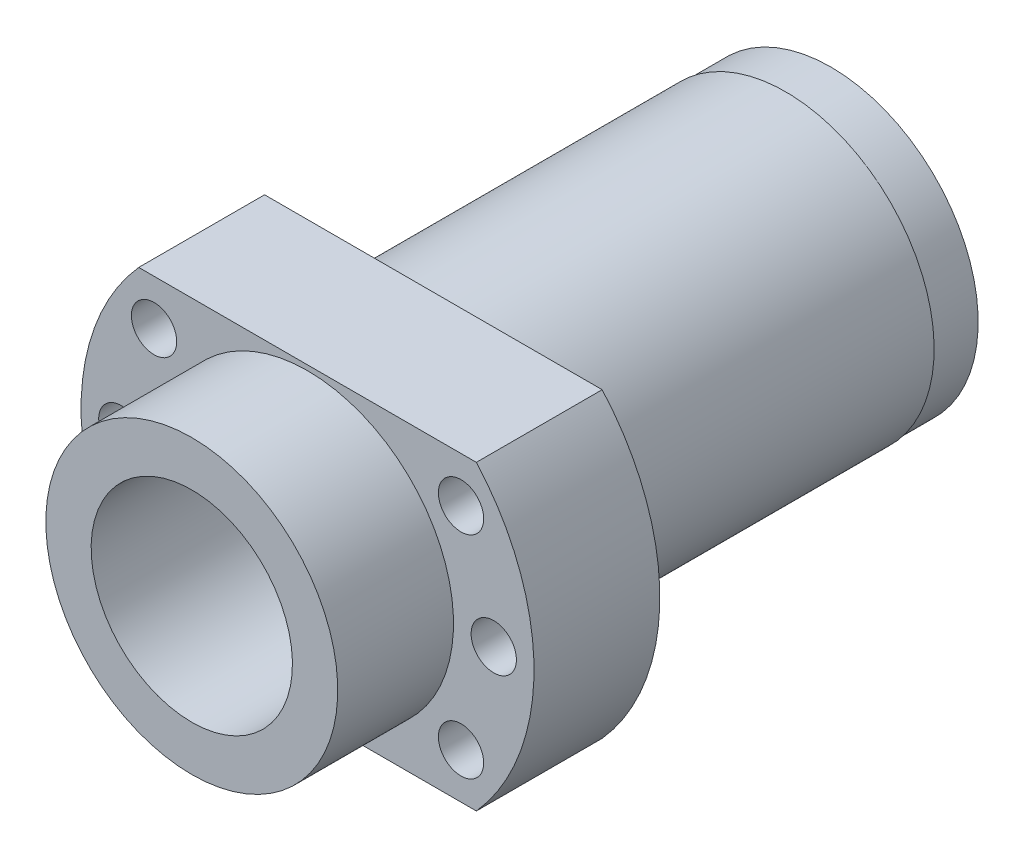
ISO-10303-21;
HEADER;
FILE_DESCRIPTION(('STEP AP214'),'2;1');
FILE_NAME('part.step','',(''),(''),'','','');
FILE_SCHEMA(('AUTOMOTIVE_DESIGN { 1 0 10303 214 1 1 1 1 }'));
ENDSEC;
DATA;
#1=APPLICATION_CONTEXT('core data for automotive mechanical design processes');
#2=APPLICATION_PROTOCOL_DEFINITION('international standard','automotive_design',2000,#1);
#3=PRODUCT_CONTEXT('',#1,'mechanical');
#4=PRODUCT('Part','Part','',(#3));
#5=PRODUCT_RELATED_PRODUCT_CATEGORY('part','',(#4));
#6=PRODUCT_DEFINITION_FORMATION('','',#4);
#7=PRODUCT_DEFINITION_CONTEXT('part definition',#1,'design');
#8=PRODUCT_DEFINITION('design','',#6,#7);
#9=PRODUCT_DEFINITION_SHAPE('','',#8);
#10=(LENGTH_UNIT() NAMED_UNIT(*) SI_UNIT(.MILLI.,.METRE.));
#11=(NAMED_UNIT(*) PLANE_ANGLE_UNIT() SI_UNIT($,.RADIAN.));
#12=(NAMED_UNIT(*) SI_UNIT($,.STERADIAN.) SOLID_ANGLE_UNIT());
#13=UNCERTAINTY_MEASURE_WITH_UNIT(LENGTH_MEASURE(1.E-05),#10,'distance_accuracy_value','');
#14=(GEOMETRIC_REPRESENTATION_CONTEXT(3) GLOBAL_UNCERTAINTY_ASSIGNED_CONTEXT((#13)) GLOBAL_UNIT_ASSIGNED_CONTEXT((#10,
#11,#12)) REPRESENTATION_CONTEXT('',''));
#15=CARTESIAN_POINT('',(0.,0.,0.));
#16=DIRECTION('',(0.,0.,1.));
#17=DIRECTION('',(1.,0.,0.));
#18=AXIS2_PLACEMENT_3D('',#15,#16,#17);
#19=CARTESIAN_POINT('',(22.2976277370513,-5.76671017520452,-76.5));
#20=DIRECTION('',(0.,0.,-1.));
#21=DIRECTION('',(-0.740091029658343,0.672506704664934,0.));
#22=AXIS2_PLACEMENT_3D('',#19,#20,#21);
#23=PLANE('',#22);
#24=DIRECTION('',(-0.977190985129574,0.21236237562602,0.));
#25=VECTOR('',#24,1.);
#26=CARTESIAN_POINT('',(23.9901721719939,-6.13453259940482,-76.5));
#27=LINE('',#26,#25);
#28=CARTESIAN_POINT('',(23.9901721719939,-6.13453259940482,-76.5));
#29=VERTEX_POINT('',#28);
#30=CARTESIAN_POINT('',(22.2976277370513,-5.76671017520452,-76.5));
#31=VERTEX_POINT('',#30);
#32=EDGE_CURVE('E953',#29,#31,#27,.T.);
#33=ORIENTED_EDGE('',*,*,#32,.F.);
#34=DIRECTION('',(0.30468428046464,-0.952453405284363,0.));
#35=VECTOR('',#34,1.);
#36=CARTESIAN_POINT('',(23.9901721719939,-6.13453259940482,-76.5));
#37=LINE('',#36,#35);
#38=CARTESIAN_POINT('',(24.5179008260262,-7.78423028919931,-76.5));
#39=VERTEX_POINT('',#38);
#40=EDGE_CURVE('E970',#29,#39,#37,.T.);
#41=ORIENTED_EDGE('',*,*,#40,.T.);
#42=DIRECTION('',(-0.672506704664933,-0.740091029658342,0.));
#43=VECTOR('',#42,1.);
#44=CARTESIAN_POINT('',(24.5179008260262,-7.78423028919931,-76.5));
#45=LINE('',#44,#43);
#46=CARTESIAN_POINT('',(23.3530850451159,-9.06610555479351,-76.5));
#47=VERTEX_POINT('',#46);
#48=EDGE_CURVE('E974',#39,#47,#45,.T.);
#49=ORIENTED_EDGE('',*,*,#48,.T.);
#50=DIRECTION('',(0.977190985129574,-0.21236237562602,0.));
#51=VECTOR('',#50,1.);
#52=CARTESIAN_POINT('',(21.6605406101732,-8.6982831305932,-76.5));
#53=LINE('',#52,#51);
#54=CARTESIAN_POINT('',(21.6605406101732,-8.6982831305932,-76.5));
#55=VERTEX_POINT('',#54);
#56=EDGE_CURVE('E977',#55,#47,#53,.T.);
#57=ORIENTED_EDGE('',*,*,#56,.F.);
#58=DIRECTION('',(-0.30468428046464,0.952453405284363,0.));
#59=VECTOR('',#58,1.);
#60=CARTESIAN_POINT('',(21.6605406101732,-8.6982831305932,-76.5));
#61=LINE('',#60,#59);
#62=CARTESIAN_POINT('',(21.1328119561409,-7.04858544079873,-76.5));
#63=VERTEX_POINT('',#62);
#64=EDGE_CURVE('E980',#55,#63,#61,.T.);
#65=ORIENTED_EDGE('',*,*,#64,.T.);
#66=DIRECTION('',(0.672506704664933,0.740091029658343,0.));
#67=VECTOR('',#66,1.);
#68=CARTESIAN_POINT('',(21.1328119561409,-7.04858544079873,-76.5));
#69=LINE('',#68,#67);
#70=EDGE_CURVE('E983',#63,#31,#69,.T.);
#71=ORIENTED_EDGE('',*,*,#70,.T.);
#72=EDGE_LOOP('',(#33,#41,#49,#57,#65,#71));
#73=FACE_BOUND('',#72,.T.);
#74=ADVANCED_FACE('F14',(#73),#23,.T.);
#75=CARTESIAN_POINT('',(24.5179008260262,-7.78423028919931,-76.5));
#76=DIRECTION('',(0.740091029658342,-0.672506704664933,0.));
#77=DIRECTION('',(-0.672506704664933,-0.740091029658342,0.));
#78=AXIS2_PLACEMENT_3D('',#75,#76,#77);
#79=PLANE('',#78);
#80=DIRECTION('',(0.,0.,-1.));
#81=VECTOR('',#80,1.);
#82=CARTESIAN_POINT('',(24.5179008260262,-7.78423028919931,-76.5));
#83=LINE('',#82,#81);
#84=CARTESIAN_POINT('',(24.5179008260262,-7.78423028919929,-78.5));
#85=VERTEX_POINT('',#84);
#86=EDGE_CURVE('E990',#39,#85,#83,.T.);
#87=ORIENTED_EDGE('',*,*,#86,.T.);
#88=DIRECTION('',(-0.672506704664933,-0.740091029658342,0.));
#89=VECTOR('',#88,1.);
#90=CARTESIAN_POINT('',(24.5179008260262,-7.78423028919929,-78.5));
#91=LINE('',#90,#89);
#92=CARTESIAN_POINT('',(23.3530850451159,-9.06610555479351,-78.5));
#93=VERTEX_POINT('',#92);
#94=EDGE_CURVE('E954',#85,#93,#91,.T.);
#95=ORIENTED_EDGE('',*,*,#94,.T.);
#96=DIRECTION('',(0.,0.,-1.));
#97=VECTOR('',#96,1.);
#98=CARTESIAN_POINT('',(23.3530850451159,-9.06610555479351,-76.5));
#99=LINE('',#98,#97);
#100=EDGE_CURVE('E992',#47,#93,#99,.T.);
#101=ORIENTED_EDGE('',*,*,#100,.F.);
#102=ORIENTED_EDGE('',*,*,#48,.F.);
#103=EDGE_LOOP('',(#87,#95,#101,#102));
#104=FACE_BOUND('',#103,.T.);
#105=ADVANCED_FACE('F785',(#104),#79,.F.);
#106=CARTESIAN_POINT('',(21.6605406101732,-8.6982831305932,-76.5));
#107=DIRECTION('',(0.21236237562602,0.977190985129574,0.));
#108=DIRECTION('',(0.977190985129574,-0.21236237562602,0.));
#109=AXIS2_PLACEMENT_3D('',#106,#107,#108);
#110=PLANE('',#109);
#111=ORIENTED_EDGE('',*,*,#100,.T.);
#112=DIRECTION('',(0.977190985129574,-0.21236237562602,0.));
#113=VECTOR('',#112,1.);
#114=CARTESIAN_POINT('',(21.6605406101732,-8.69828313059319,-78.5));
#115=LINE('',#114,#113);
#116=CARTESIAN_POINT('',(21.6605406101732,-8.69828313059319,-78.5));
#117=VERTEX_POINT('',#116);
#118=EDGE_CURVE('E957',#117,#93,#115,.T.);
#119=ORIENTED_EDGE('',*,*,#118,.F.);
#120=DIRECTION('',(0.,0.,-1.));
#121=VECTOR('',#120,1.);
#122=CARTESIAN_POINT('',(21.6605406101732,-8.6982831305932,-76.5));
#123=LINE('',#122,#121);
#124=EDGE_CURVE('E994',#55,#117,#123,.T.);
#125=ORIENTED_EDGE('',*,*,#124,.F.);
#126=ORIENTED_EDGE('',*,*,#56,.T.);
#127=EDGE_LOOP('',(#111,#119,#125,#126));
#128=FACE_BOUND('',#127,.T.);
#129=ADVANCED_FACE('F781',(#128),#110,.T.);
#130=CARTESIAN_POINT('',(21.6605406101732,-8.6982831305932,-76.5));
#131=DIRECTION('',(-0.952453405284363,-0.30468428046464,0.));
#132=DIRECTION('',(-0.30468428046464,0.952453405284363,0.));
#133=AXIS2_PLACEMENT_3D('',#130,#131,#132);
#134=PLANE('',#133);
#135=ORIENTED_EDGE('',*,*,#124,.T.);
#136=DIRECTION('',(-0.30468428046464,0.952453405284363,0.));
#137=VECTOR('',#136,1.);
#138=CARTESIAN_POINT('',(21.6605406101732,-8.69828313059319,-78.5));
#139=LINE('',#138,#137);
#140=CARTESIAN_POINT('',(21.1328119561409,-7.04858544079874,-78.5));
#141=VERTEX_POINT('',#140);
#142=EDGE_CURVE('E960',#117,#141,#139,.T.);
#143=ORIENTED_EDGE('',*,*,#142,.T.);
#144=DIRECTION('',(0.,0.,-1.));
#145=VECTOR('',#144,1.);
#146=CARTESIAN_POINT('',(21.1328119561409,-7.04858544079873,-76.5));
#147=LINE('',#146,#145);
#148=EDGE_CURVE('E996',#63,#141,#147,.T.);
#149=ORIENTED_EDGE('',*,*,#148,.F.);
#150=ORIENTED_EDGE('',*,*,#64,.F.);
#151=EDGE_LOOP('',(#135,#143,#149,#150));
#152=FACE_BOUND('',#151,.T.);
#153=ADVANCED_FACE('F777',(#152),#134,.F.);
#154=CARTESIAN_POINT('',(21.1328119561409,-7.04858544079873,-76.5));
#155=DIRECTION('',(-0.740091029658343,0.672506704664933,0.));
#156=DIRECTION('',(0.672506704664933,0.740091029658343,0.));
#157=AXIS2_PLACEMENT_3D('',#154,#155,#156);
#158=PLANE('',#157);
#159=ORIENTED_EDGE('',*,*,#148,.T.);
#160=DIRECTION('',(0.672506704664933,0.740091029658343,0.));
#161=VECTOR('',#160,1.);
#162=CARTESIAN_POINT('',(21.1328119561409,-7.04858544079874,-78.5));
#163=LINE('',#162,#161);
#164=CARTESIAN_POINT('',(22.2976277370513,-5.76671017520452,-78.5));
#165=VERTEX_POINT('',#164);
#166=EDGE_CURVE('E963',#141,#165,#163,.T.);
#167=ORIENTED_EDGE('',*,*,#166,.T.);
#168=DIRECTION('',(0.,0.,-1.));
#169=VECTOR('',#168,1.);
#170=CARTESIAN_POINT('',(22.2976277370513,-5.76671017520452,-76.5));
#171=LINE('',#170,#169);
#172=EDGE_CURVE('E915',#31,#165,#171,.T.);
#173=ORIENTED_EDGE('',*,*,#172,.F.);
#174=ORIENTED_EDGE('',*,*,#70,.F.);
#175=EDGE_LOOP('',(#159,#167,#173,#174));
#176=FACE_BOUND('',#175,.T.);
#177=ADVANCED_FACE('F773',(#176),#158,.F.);
#178=CARTESIAN_POINT('',(23.9901721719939,-6.13453259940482,-76.5));
#179=DIRECTION('',(-0.21236237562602,-0.977190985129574,0.));
#180=DIRECTION('',(-0.977190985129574,0.21236237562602,0.));
#181=AXIS2_PLACEMENT_3D('',#178,#179,#180);
#182=PLANE('',#181);
#183=ORIENTED_EDGE('',*,*,#172,.T.);
#184=DIRECTION('',(-0.977190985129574,0.21236237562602,0.));
#185=VECTOR('',#184,1.);
#186=CARTESIAN_POINT('',(23.9901721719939,-6.13453259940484,-78.5));
#187=LINE('',#186,#185);
#188=CARTESIAN_POINT('',(23.9901721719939,-6.13453259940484,-78.5));
#189=VERTEX_POINT('',#188);
#190=EDGE_CURVE('E966',#189,#165,#187,.T.);
#191=ORIENTED_EDGE('',*,*,#190,.F.);
#192=DIRECTION('',(0.,0.,-1.));
#193=VECTOR('',#192,1.);
#194=CARTESIAN_POINT('',(23.9901721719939,-6.13453259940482,-76.5));
#195=LINE('',#194,#193);
#196=EDGE_CURVE('E973',#29,#189,#195,.T.);
#197=ORIENTED_EDGE('',*,*,#196,.F.);
#198=ORIENTED_EDGE('',*,*,#32,.T.);
#199=EDGE_LOOP('',(#183,#191,#197,#198));
#200=FACE_BOUND('',#199,.T.);
#201=ADVANCED_FACE('F776',(#200),#182,.T.);
#202=CARTESIAN_POINT('',(23.9901721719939,-6.13453259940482,-76.5));
#203=DIRECTION('',(0.952453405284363,0.30468428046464,0.));
#204=DIRECTION('',(0.30468428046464,-0.952453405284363,0.));
#205=AXIS2_PLACEMENT_3D('',#202,#203,#204);
#206=PLANE('',#205);
#207=ORIENTED_EDGE('',*,*,#40,.F.);
#208=ORIENTED_EDGE('',*,*,#196,.T.);
#209=DIRECTION('',(0.30468428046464,-0.952453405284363,0.));
#210=VECTOR('',#209,1.);
#211=CARTESIAN_POINT('',(23.9901721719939,-6.13453259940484,-78.5));
#212=LINE('',#211,#210);
#213=EDGE_CURVE('E950',#189,#85,#212,.T.);
#214=ORIENTED_EDGE('',*,*,#213,.T.);
#215=ORIENTED_EDGE('',*,*,#86,.F.);
#216=EDGE_LOOP('',(#207,#208,#214,#215));
#217=FACE_BOUND('',#216,.T.);
#218=ADVANCED_FACE('F790',(#217),#206,.F.);
#219=CARTESIAN_POINT('',(14.6495725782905,-17.7715832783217,-76.5));
#220=DIRECTION('',(0.,0.,-1.));
#221=DIRECTION('',(-0.203456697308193,0.979083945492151,0.));
#222=AXIS2_PLACEMENT_3D('',#219,#220,#221);
#223=PLANE('',#222);
#224=DIRECTION('',(-0.665740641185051,0.746183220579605,0.));
#225=VECTOR('',#224,1.);
#226=CARTESIAN_POINT('',(15.8026691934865,-19.064010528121,-76.5));
#227=LINE('',#226,#225);
#228=CARTESIAN_POINT('',(15.8026691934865,-19.064010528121,-76.5));
#229=VERTEX_POINT('',#228);
#230=CARTESIAN_POINT('',(14.6495725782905,-17.7715832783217,-76.5));
#231=VERTEX_POINT('',#230);
#232=EDGE_CURVE('E901',#229,#231,#227,.T.);
#233=ORIENTED_EDGE('',*,*,#232,.F.);
#234=DIRECTION('',(-0.313343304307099,-0.949639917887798,0.));
#235=VECTOR('',#234,1.);
#236=CARTESIAN_POINT('',(15.8026691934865,-19.064010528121,-76.5));
#237=LINE('',#236,#235);
#238=CARTESIAN_POINT('',(15.2599426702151,-20.7088351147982,-76.5));
#239=VERTEX_POINT('',#238);
#240=EDGE_CURVE('E916',#229,#239,#237,.T.);
#241=ORIENTED_EDGE('',*,*,#240,.T.);
#242=DIRECTION('',(-0.979083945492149,-0.203456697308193,0.));
#243=VECTOR('',#242,1.);
#244=CARTESIAN_POINT('',(15.2599426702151,-20.7088351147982,-76.5));
#245=LINE('',#244,#243);
#246=CARTESIAN_POINT('',(13.5641195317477,-21.0612324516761,-76.5));
#247=VERTEX_POINT('',#246);
#248=EDGE_CURVE('E920',#239,#247,#245,.T.);
#249=ORIENTED_EDGE('',*,*,#248,.T.);
#250=DIRECTION('',(0.665740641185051,-0.746183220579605,0.));
#251=VECTOR('',#250,1.);
#252=CARTESIAN_POINT('',(12.4110229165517,-19.7688052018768,-76.5));
#253=LINE('',#252,#251);
#254=CARTESIAN_POINT('',(12.4110229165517,-19.7688052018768,-76.5));
#255=VERTEX_POINT('',#254);
#256=EDGE_CURVE('E923',#255,#247,#253,.T.);
#257=ORIENTED_EDGE('',*,*,#256,.F.);
#258=DIRECTION('',(0.313343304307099,0.949639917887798,0.));
#259=VECTOR('',#258,1.);
#260=CARTESIAN_POINT('',(12.4110229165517,-19.7688052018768,-76.5));
#261=LINE('',#260,#259);
#262=CARTESIAN_POINT('',(12.9537494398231,-18.1239806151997,-76.5));
#263=VERTEX_POINT('',#262);
#264=EDGE_CURVE('E926',#255,#263,#261,.T.);
#265=ORIENTED_EDGE('',*,*,#264,.T.);
#266=DIRECTION('',(0.97908394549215,0.203456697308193,0.));
#267=VECTOR('',#266,1.);
#268=CARTESIAN_POINT('',(12.9537494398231,-18.1239806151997,-76.5));
#269=LINE('',#268,#267);
#270=EDGE_CURVE('E929',#263,#231,#269,.T.);
#271=ORIENTED_EDGE('',*,*,#270,.T.);
#272=EDGE_LOOP('',(#233,#241,#249,#257,#265,#271));
#273=FACE_BOUND('',#272,.T.);
#274=ADVANCED_FACE('F793',(#273),#223,.T.);
#275=CARTESIAN_POINT('',(15.2599426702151,-20.7088351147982,-76.5));
#276=DIRECTION('',(0.203456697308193,-0.979083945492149,0.));
#277=DIRECTION('',(-0.979083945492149,-0.203456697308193,0.));
#278=AXIS2_PLACEMENT_3D('',#275,#276,#277);
#279=PLANE('',#278);
#280=DIRECTION('',(0.,0.,-1.));
#281=VECTOR('',#280,1.);
#282=CARTESIAN_POINT('',(15.2599426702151,-20.7088351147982,-76.5));
#283=LINE('',#282,#281);
#284=CARTESIAN_POINT('',(15.2599426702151,-20.7088351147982,-78.5));
#285=VERTEX_POINT('',#284);
#286=EDGE_CURVE('E935',#239,#285,#283,.T.);
#287=ORIENTED_EDGE('',*,*,#286,.T.);
#288=DIRECTION('',(-0.979083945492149,-0.203456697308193,0.));
#289=VECTOR('',#288,1.);
#290=CARTESIAN_POINT('',(15.2599426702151,-20.7088351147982,-78.5));
#291=LINE('',#290,#289);
#292=CARTESIAN_POINT('',(13.5641195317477,-21.0612324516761,-78.5));
#293=VERTEX_POINT('',#292);
#294=EDGE_CURVE('E902',#285,#293,#291,.T.);
#295=ORIENTED_EDGE('',*,*,#294,.T.);
#296=DIRECTION('',(0.,0.,-1.));
#297=VECTOR('',#296,1.);
#298=CARTESIAN_POINT('',(13.5641195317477,-21.0612324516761,-76.5));
#299=LINE('',#298,#297);
#300=EDGE_CURVE('E938',#247,#293,#299,.T.);
#301=ORIENTED_EDGE('',*,*,#300,.F.);
#302=ORIENTED_EDGE('',*,*,#248,.F.);
#303=EDGE_LOOP('',(#287,#295,#301,#302));
#304=FACE_BOUND('',#303,.T.);
#305=ADVANCED_FACE('F813',(#304),#279,.F.);
#306=CARTESIAN_POINT('',(12.4110229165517,-19.7688052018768,-76.5));
#307=DIRECTION('',(0.746183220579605,0.665740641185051,0.));
#308=DIRECTION('',(0.665740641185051,-0.746183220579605,0.));
#309=AXIS2_PLACEMENT_3D('',#306,#307,#308);
#310=PLANE('',#309);
#311=ORIENTED_EDGE('',*,*,#300,.T.);
#312=DIRECTION('',(0.665740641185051,-0.746183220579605,0.));
#313=VECTOR('',#312,1.);
#314=CARTESIAN_POINT('',(12.4110229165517,-19.7688052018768,-78.5));
#315=LINE('',#314,#313);
#316=CARTESIAN_POINT('',(12.4110229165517,-19.7688052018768,-78.5));
#317=VERTEX_POINT('',#316);
#318=EDGE_CURVE('E905',#317,#293,#315,.T.);
#319=ORIENTED_EDGE('',*,*,#318,.F.);
#320=DIRECTION('',(0.,0.,-1.));
#321=VECTOR('',#320,1.);
#322=CARTESIAN_POINT('',(12.4110229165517,-19.7688052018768,-76.5));
#323=LINE('',#322,#321);
#324=EDGE_CURVE('E941',#255,#317,#323,.T.);
#325=ORIENTED_EDGE('',*,*,#324,.F.);
#326=ORIENTED_EDGE('',*,*,#256,.T.);
#327=EDGE_LOOP('',(#311,#319,#325,#326));
#328=FACE_BOUND('',#327,.T.);
#329=ADVANCED_FACE('F809',(#328),#310,.T.);
#330=CARTESIAN_POINT('',(12.4110229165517,-19.7688052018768,-76.5));
#331=DIRECTION('',(-0.949639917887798,0.313343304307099,0.));
#332=DIRECTION('',(0.313343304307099,0.949639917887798,0.));
#333=AXIS2_PLACEMENT_3D('',#330,#331,#332);
#334=PLANE('',#333);
#335=ORIENTED_EDGE('',*,*,#324,.T.);
#336=DIRECTION('',(0.313343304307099,0.949639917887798,0.));
#337=VECTOR('',#336,1.);
#338=CARTESIAN_POINT('',(12.4110229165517,-19.7688052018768,-78.5));
#339=LINE('',#338,#337);
#340=CARTESIAN_POINT('',(12.9537494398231,-18.1239806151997,-78.5));
#341=VERTEX_POINT('',#340);
#342=EDGE_CURVE('E908',#317,#341,#339,.T.);
#343=ORIENTED_EDGE('',*,*,#342,.T.);
#344=DIRECTION('',(0.,0.,-1.));
#345=VECTOR('',#344,1.);
#346=CARTESIAN_POINT('',(12.9537494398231,-18.1239806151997,-76.5));
#347=LINE('',#346,#345);
#348=EDGE_CURVE('E944',#263,#341,#347,.T.);
#349=ORIENTED_EDGE('',*,*,#348,.F.);
#350=ORIENTED_EDGE('',*,*,#264,.F.);
#351=EDGE_LOOP('',(#335,#343,#349,#350));
#352=FACE_BOUND('',#351,.T.);
#353=ADVANCED_FACE('F805',(#352),#334,.F.);
#354=CARTESIAN_POINT('',(12.9537494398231,-18.1239806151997,-76.5));
#355=DIRECTION('',(-0.203456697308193,0.97908394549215,0.));
#356=DIRECTION('',(0.97908394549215,0.203456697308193,0.));
#357=AXIS2_PLACEMENT_3D('',#354,#355,#356);
#358=PLANE('',#357);
#359=ORIENTED_EDGE('',*,*,#348,.T.);
#360=DIRECTION('',(0.97908394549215,0.203456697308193,0.));
#361=VECTOR('',#360,1.);
#362=CARTESIAN_POINT('',(12.9537494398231,-18.1239806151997,-78.5));
#363=LINE('',#362,#361);
#364=CARTESIAN_POINT('',(14.6495725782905,-17.7715832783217,-78.5));
#365=VERTEX_POINT('',#364);
#366=EDGE_CURVE('E911',#341,#365,#363,.T.);
#367=ORIENTED_EDGE('',*,*,#366,.T.);
#368=DIRECTION('',(0.,0.,-1.));
#369=VECTOR('',#368,1.);
#370=CARTESIAN_POINT('',(14.6495725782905,-17.7715832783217,-76.5));
#371=LINE('',#370,#369);
#372=EDGE_CURVE('E947',#231,#365,#371,.T.);
#373=ORIENTED_EDGE('',*,*,#372,.F.);
#374=ORIENTED_EDGE('',*,*,#270,.F.);
#375=EDGE_LOOP('',(#359,#367,#373,#374));
#376=FACE_BOUND('',#375,.T.);
#377=ADVANCED_FACE('F802',(#376),#358,.F.);
#378=CARTESIAN_POINT('',(15.8026691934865,-19.064010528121,-76.5));
#379=DIRECTION('',(-0.746183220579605,-0.665740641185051,0.));
#380=DIRECTION('',(-0.665740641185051,0.746183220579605,0.));
#381=AXIS2_PLACEMENT_3D('',#378,#379,#380);
#382=PLANE('',#381);
#383=ORIENTED_EDGE('',*,*,#372,.T.);
#384=DIRECTION('',(-0.665740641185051,0.746183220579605,0.));
#385=VECTOR('',#384,1.);
#386=CARTESIAN_POINT('',(15.8026691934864,-19.0640105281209,-78.5));
#387=LINE('',#386,#385);
#388=CARTESIAN_POINT('',(15.8026691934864,-19.0640105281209,-78.5));
#389=VERTEX_POINT('',#388);
#390=EDGE_CURVE('E33',#389,#365,#387,.T.);
#391=ORIENTED_EDGE('',*,*,#390,.F.);
#392=DIRECTION('',(0.,0.,-1.));
#393=VECTOR('',#392,1.);
#394=CARTESIAN_POINT('',(15.8026691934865,-19.064010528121,-76.5));
#395=LINE('',#394,#393);
#396=EDGE_CURVE('E919',#229,#389,#395,.T.);
#397=ORIENTED_EDGE('',*,*,#396,.F.);
#398=ORIENTED_EDGE('',*,*,#232,.T.);
#399=EDGE_LOOP('',(#383,#391,#397,#398));
#400=FACE_BOUND('',#399,.T.);
#401=ADVANCED_FACE('F576',(#400),#382,.T.);
#402=CARTESIAN_POINT('',(15.8026691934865,-19.064010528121,-76.5));
#403=DIRECTION('',(0.949639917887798,-0.313343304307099,0.));
#404=DIRECTION('',(-0.313343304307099,-0.949639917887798,0.));
#405=AXIS2_PLACEMENT_3D('',#402,#403,#404);
#406=PLANE('',#405);
#407=ORIENTED_EDGE('',*,*,#240,.F.);
#408=ORIENTED_EDGE('',*,*,#396,.T.);
#409=DIRECTION('',(-0.313343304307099,-0.949639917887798,0.));
#410=VECTOR('',#409,1.);
#411=CARTESIAN_POINT('',(15.8026691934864,-19.0640105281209,-78.5));
#412=LINE('',#411,#410);
#413=EDGE_CURVE('E898',#389,#285,#412,.T.);
#414=ORIENTED_EDGE('',*,*,#413,.T.);
#415=ORIENTED_EDGE('',*,*,#286,.F.);
#416=EDGE_LOOP('',(#407,#408,#414,#415));
#417=FACE_BOUND('',#416,.T.);
#418=ADVANCED_FACE('F582',(#417),#406,.F.);
#419=CARTESIAN_POINT('',(1.40587861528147,-22.9883156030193,-76.5));
#420=DIRECTION('',(0.,0.,-1.));
#421=DIRECTION('',(0.410891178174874,0.91168439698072,0.));
#422=AXIS2_PLACEMENT_3D('',#419,#420,#421);
#423=PLANE('',#422);
#424=DIRECTION('',(-0.1,0.994987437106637,0.));
#425=VECTOR('',#424,1.);
#426=CARTESIAN_POINT('',(1.57908369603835,-24.7116843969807,-76.5));
#427=LINE('',#426,#425);
#428=CARTESIAN_POINT('',(1.57908369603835,-24.7116843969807,-76.5));
#429=VERTEX_POINT('',#428);
#430=CARTESIAN_POINT('',(1.40587861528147,-22.9883156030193,-76.5));
#431=VERTEX_POINT('',#430);
#432=EDGE_CURVE('E1345',#429,#431,#427,.T.);
#433=ORIENTED_EDGE('',*,*,#432,.F.);
#434=DIRECTION('',(-0.811684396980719,-0.584096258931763,0.));
#435=VECTOR('',#434,1.);
#436=CARTESIAN_POINT('',(1.57908369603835,-24.7116843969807,-76.5));
#437=LINE('',#436,#435);
#438=CARTESIAN_POINT('',(0.173205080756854,-25.7233687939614,-76.5));
#439=VERTEX_POINT('',#438);
#440=EDGE_CURVE('E1360',#429,#439,#437,.T.);
#441=ORIENTED_EDGE('',*,*,#440,.T.);
#442=DIRECTION('',(-0.911684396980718,0.410891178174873,0.));
#443=VECTOR('',#442,1.);
#444=CARTESIAN_POINT('',(0.173205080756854,-25.7233687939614,-76.5));
#445=LINE('',#444,#443);
#446=CARTESIAN_POINT('',(-1.40587861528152,-25.0116843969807,-76.5));
#447=VERTEX_POINT('',#446);
#448=EDGE_CURVE('E1364',#439,#447,#445,.T.);
#449=ORIENTED_EDGE('',*,*,#448,.T.);
#450=DIRECTION('',(0.1,-0.994987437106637,0.));
#451=VECTOR('',#450,1.);
#452=CARTESIAN_POINT('',(-1.57908369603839,-23.2883156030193,-76.5));
#453=LINE('',#452,#451);
#454=CARTESIAN_POINT('',(-1.57908369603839,-23.2883156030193,-76.5));
#455=VERTEX_POINT('',#454);
#456=EDGE_CURVE('E1367',#455,#447,#453,.T.);
#457=ORIENTED_EDGE('',*,*,#456,.F.);
#458=DIRECTION('',(0.811684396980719,0.584096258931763,0.));
#459=VECTOR('',#458,1.);
#460=CARTESIAN_POINT('',(-1.57908369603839,-23.2883156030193,-76.5));
#461=LINE('',#460,#459);
#462=CARTESIAN_POINT('',(-0.173205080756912,-22.2766312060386,-76.5));
#463=VERTEX_POINT('',#462);
#464=EDGE_CURVE('E1370',#455,#463,#461,.T.);
#465=ORIENTED_EDGE('',*,*,#464,.T.);
#466=DIRECTION('',(0.911684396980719,-0.410891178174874,0.));
#467=VECTOR('',#466,1.);
#468=CARTESIAN_POINT('',(-0.173205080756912,-22.2766312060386,-76.5));
#469=LINE('',#468,#467);
#470=EDGE_CURVE('E1373',#463,#431,#469,.T.);
#471=ORIENTED_EDGE('',*,*,#470,.T.);
#472=EDGE_LOOP('',(#433,#441,#449,#457,#465,#471));
#473=FACE_BOUND('',#472,.T.);
#474=ADVANCED_FACE('F569',(#473),#423,.T.);
#475=CARTESIAN_POINT('',(0.173205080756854,-25.7233687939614,-76.5));
#476=DIRECTION('',(-0.410891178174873,-0.911684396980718,0.));
#477=DIRECTION('',(-0.911684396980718,0.410891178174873,0.));
#478=AXIS2_PLACEMENT_3D('',#475,#476,#477);
#479=PLANE('',#478);
#480=DIRECTION('',(0.,0.,-1.));
#481=VECTOR('',#480,1.);
#482=CARTESIAN_POINT('',(0.173205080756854,-25.7233687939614,-76.5));
#483=LINE('',#482,#481);
#484=CARTESIAN_POINT('',(0.173205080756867,-25.7233687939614,-78.5));
#485=VERTEX_POINT('',#484);
#486=EDGE_CURVE('E1380',#439,#485,#483,.T.);
#487=ORIENTED_EDGE('',*,*,#486,.T.);
#488=DIRECTION('',(-0.911684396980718,0.410891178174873,0.));
#489=VECTOR('',#488,1.);
#490=CARTESIAN_POINT('',(0.173205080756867,-25.7233687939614,-78.5));
#491=LINE('',#490,#489);
#492=CARTESIAN_POINT('',(-1.40587861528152,-25.0116843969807,-78.5));
#493=VERTEX_POINT('',#492);
#494=EDGE_CURVE('E1346',#485,#493,#491,.T.);
#495=ORIENTED_EDGE('',*,*,#494,.T.);
#496=DIRECTION('',(0.,0.,-1.));
#497=VECTOR('',#496,1.);
#498=CARTESIAN_POINT('',(-1.40587861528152,-25.0116843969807,-76.5));
#499=LINE('',#498,#497);
#500=EDGE_CURVE('E1382',#447,#493,#499,.T.);
#501=ORIENTED_EDGE('',*,*,#500,.F.);
#502=ORIENTED_EDGE('',*,*,#448,.F.);
#503=EDGE_LOOP('',(#487,#495,#501,#502));
#504=FACE_BOUND('',#503,.T.);
#505=ADVANCED_FACE('F565',(#504),#479,.F.);
#506=CARTESIAN_POINT('',(-1.57908369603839,-23.2883156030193,-76.5));
#507=DIRECTION('',(0.994987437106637,0.1,0.));
#508=DIRECTION('',(0.1,-0.994987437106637,0.));
#509=AXIS2_PLACEMENT_3D('',#506,#507,#508);
#510=PLANE('',#509);
#511=ORIENTED_EDGE('',*,*,#500,.T.);
#512=DIRECTION('',(0.1,-0.994987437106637,0.));
#513=VECTOR('',#512,1.);
#514=CARTESIAN_POINT('',(-1.57908369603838,-23.2883156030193,-78.5));
#515=LINE('',#514,#513);
#516=CARTESIAN_POINT('',(-1.57908369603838,-23.2883156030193,-78.5));
#517=VERTEX_POINT('',#516);
#518=EDGE_CURVE('E1349',#517,#493,#515,.T.);
#519=ORIENTED_EDGE('',*,*,#518,.F.);
#520=DIRECTION('',(0.,0.,-1.));
#521=VECTOR('',#520,1.);
#522=CARTESIAN_POINT('',(-1.57908369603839,-23.2883156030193,-76.5));
#523=LINE('',#522,#521);
#524=EDGE_CURVE('E1384',#455,#517,#523,.T.);
#525=ORIENTED_EDGE('',*,*,#524,.F.);
#526=ORIENTED_EDGE('',*,*,#456,.T.);
#527=EDGE_LOOP('',(#511,#519,#525,#526));
#528=FACE_BOUND('',#527,.T.);
#529=ADVANCED_FACE('F561',(#528),#510,.T.);
#530=CARTESIAN_POINT('',(-1.57908369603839,-23.2883156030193,-76.5));
#531=DIRECTION('',(-0.584096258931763,0.811684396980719,0.));
#532=DIRECTION('',(0.811684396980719,0.584096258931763,0.));
#533=AXIS2_PLACEMENT_3D('',#530,#531,#532);
#534=PLANE('',#533);
#535=ORIENTED_EDGE('',*,*,#524,.T.);
#536=DIRECTION('',(0.811684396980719,0.584096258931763,0.));
#537=VECTOR('',#536,1.);
#538=CARTESIAN_POINT('',(-1.57908369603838,-23.2883156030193,-78.5));
#539=LINE('',#538,#537);
#540=CARTESIAN_POINT('',(-0.173205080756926,-22.2766312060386,-78.5));
#541=VERTEX_POINT('',#540);
#542=EDGE_CURVE('E1352',#517,#541,#539,.T.);
#543=ORIENTED_EDGE('',*,*,#542,.T.);
#544=DIRECTION('',(0.,0.,-1.));
#545=VECTOR('',#544,1.);
#546=CARTESIAN_POINT('',(-0.173205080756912,-22.2766312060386,-76.5));
#547=LINE('',#546,#545);
#548=EDGE_CURVE('E1386',#463,#541,#547,.T.);
#549=ORIENTED_EDGE('',*,*,#548,.F.);
#550=ORIENTED_EDGE('',*,*,#464,.F.);
#551=EDGE_LOOP('',(#535,#543,#549,#550));
#552=FACE_BOUND('',#551,.T.);
#553=ADVANCED_FACE('F557',(#552),#534,.F.);
#554=CARTESIAN_POINT('',(-0.173205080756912,-22.2766312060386,-76.5));
#555=DIRECTION('',(0.410891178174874,0.911684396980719,0.));
#556=DIRECTION('',(0.911684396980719,-0.410891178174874,0.));
#557=AXIS2_PLACEMENT_3D('',#554,#555,#556);
#558=PLANE('',#557);
#559=ORIENTED_EDGE('',*,*,#548,.T.);
#560=DIRECTION('',(0.911684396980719,-0.410891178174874,0.));
#561=VECTOR('',#560,1.);
#562=CARTESIAN_POINT('',(-0.173205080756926,-22.2766312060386,-78.5));
#563=LINE('',#562,#561);
#564=CARTESIAN_POINT('',(1.40587861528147,-22.9883156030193,-78.5));
#565=VERTEX_POINT('',#564);
#566=EDGE_CURVE('E1355',#541,#565,#563,.T.);
#567=ORIENTED_EDGE('',*,*,#566,.T.);
#568=DIRECTION('',(0.,0.,-1.));
#569=VECTOR('',#568,1.);
#570=CARTESIAN_POINT('',(1.40587861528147,-22.9883156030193,-76.5));
#571=LINE('',#570,#569);
#572=EDGE_CURVE('E1312',#431,#565,#571,.T.);
#573=ORIENTED_EDGE('',*,*,#572,.F.);
#574=ORIENTED_EDGE('',*,*,#470,.F.);
#575=EDGE_LOOP('',(#559,#567,#573,#574));
#576=FACE_BOUND('',#575,.T.);
#577=ADVANCED_FACE('F553',(#576),#558,.F.);
#578=CARTESIAN_POINT('',(1.57908369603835,-24.7116843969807,-76.5));
#579=DIRECTION('',(-0.994987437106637,-0.1,0.));
#580=DIRECTION('',(-0.1,0.994987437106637,0.));
#581=AXIS2_PLACEMENT_3D('',#578,#579,#580);
#582=PLANE('',#581);
#583=ORIENTED_EDGE('',*,*,#572,.T.);
#584=DIRECTION('',(-0.1,0.994987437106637,0.));
#585=VECTOR('',#584,1.);
#586=CARTESIAN_POINT('',(1.57908369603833,-24.7116843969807,-78.5));
#587=LINE('',#586,#585);
#588=CARTESIAN_POINT('',(1.57908369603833,-24.7116843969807,-78.5));
#589=VERTEX_POINT('',#588);
#590=EDGE_CURVE('E436',#589,#565,#587,.T.);
#591=ORIENTED_EDGE('',*,*,#590,.F.);
#592=DIRECTION('',(0.,0.,-1.));
#593=VECTOR('',#592,1.);
#594=CARTESIAN_POINT('',(1.57908369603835,-24.7116843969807,-76.5));
#595=LINE('',#594,#593);
#596=EDGE_CURVE('E1363',#429,#589,#595,.T.);
#597=ORIENTED_EDGE('',*,*,#596,.F.);
#598=ORIENTED_EDGE('',*,*,#432,.T.);
#599=EDGE_LOOP('',(#583,#591,#597,#598));
#600=FACE_BOUND('',#599,.T.);
#601=ADVANCED_FACE('F556',(#600),#582,.T.);
#602=CARTESIAN_POINT('',(1.57908369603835,-24.7116843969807,-76.5));
#603=DIRECTION('',(0.584096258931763,-0.811684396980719,0.));
#604=DIRECTION('',(-0.811684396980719,-0.584096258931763,0.));
#605=AXIS2_PLACEMENT_3D('',#602,#603,#604);
#606=PLANE('',#605);
#607=ORIENTED_EDGE('',*,*,#440,.F.);
#608=ORIENTED_EDGE('',*,*,#596,.T.);
#609=DIRECTION('',(-0.811684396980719,-0.584096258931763,0.));
#610=VECTOR('',#609,1.);
#611=CARTESIAN_POINT('',(1.57908369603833,-24.7116843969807,-78.5));
#612=LINE('',#611,#610);
#613=EDGE_CURVE('E1342',#589,#485,#612,.T.);
#614=ORIENTED_EDGE('',*,*,#613,.T.);
#615=ORIENTED_EDGE('',*,*,#486,.F.);
#616=EDGE_LOOP('',(#607,#608,#614,#615));
#617=FACE_BOUND('',#616,.T.);
#618=ADVANCED_FACE('F571',(#617),#606,.F.);
#619=CARTESIAN_POINT('',(-12.3748131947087,-19.4242927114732,-76.5));
#620=DIRECTION('',(0.,0.,-1.));
#621=DIRECTION('',(0.868292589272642,0.496052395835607,0.));
#622=AXIS2_PLACEMENT_3D('',#619,#620,#621);
#623=PLANE('',#622);
#624=DIRECTION('',(0.503937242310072,0.863740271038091,0.));
#625=VECTOR('',#624,1.);
#626=CARTESIAN_POINT('',(-13.2476581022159,-20.9203347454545,-76.5));
#627=LINE('',#626,#625);
#628=CARTESIAN_POINT('',(-13.2476581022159,-20.9203347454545,-76.5));
#629=VERTEX_POINT('',#628);
#630=CARTESIAN_POINT('',(-12.3748131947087,-19.4242927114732,-76.5));
#631=VERTEX_POINT('',#630);
#632=EDGE_CURVE('E1296',#629,#631,#627,.T.);
#633=ORIENTED_EDGE('',*,*,#632,.F.);
#634=DIRECTION('',(-0.999989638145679,0.00455231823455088,0.));
#635=VECTOR('',#634,1.);
#636=CARTESIAN_POINT('',(-13.2476581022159,-20.9203347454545,-76.5));
#637=LINE('',#636,#635);
#638=CARTESIAN_POINT('',(-14.9796909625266,-20.91244989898,-76.5));
#639=VERTEX_POINT('',#638);
#640=EDGE_CURVE('E1313',#629,#639,#637,.T.);
#641=ORIENTED_EDGE('',*,*,#640,.T.);
#642=DIRECTION('',(-0.496052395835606,0.86829258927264,0.));
#643=VECTOR('',#642,1.);
#644=CARTESIAN_POINT('',(-14.9796909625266,-20.91244989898,-76.5));
#645=LINE('',#644,#643);
#646=CARTESIAN_POINT('',(-15.8388789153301,-19.4085230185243,-76.5));
#647=VERTEX_POINT('',#646);
#648=EDGE_CURVE('E1317',#639,#647,#645,.T.);
#649=ORIENTED_EDGE('',*,*,#648,.T.);
#650=DIRECTION('',(-0.503937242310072,-0.863740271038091,0.));
#651=VECTOR('',#650,1.);
#652=CARTESIAN_POINT('',(-14.9660340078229,-17.912480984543,-76.5));
#653=LINE('',#652,#651);
#654=CARTESIAN_POINT('',(-14.9660340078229,-17.912480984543,-76.5));
#655=VERTEX_POINT('',#654);
#656=EDGE_CURVE('E1320',#655,#647,#653,.T.);
#657=ORIENTED_EDGE('',*,*,#656,.F.);
#658=DIRECTION('',(0.999989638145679,-0.00455231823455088,0.));
#659=VECTOR('',#658,1.);
#660=CARTESIAN_POINT('',(-14.9660340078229,-17.912480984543,-76.5));
#661=LINE('',#660,#659);
#662=CARTESIAN_POINT('',(-13.2340011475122,-17.9203658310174,-76.5));
#663=VERTEX_POINT('',#662);
#664=EDGE_CURVE('E1323',#655,#663,#661,.T.);
#665=ORIENTED_EDGE('',*,*,#664,.T.);
#666=DIRECTION('',(0.496052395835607,-0.868292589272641,0.));
#667=VECTOR('',#666,1.);
#668=CARTESIAN_POINT('',(-13.2340011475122,-17.9203658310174,-76.5));
#669=LINE('',#668,#667);
#670=EDGE_CURVE('E1326',#663,#631,#669,.T.);
#671=ORIENTED_EDGE('',*,*,#670,.T.);
#672=EDGE_LOOP('',(#633,#641,#649,#657,#665,#671));
#673=FACE_BOUND('',#672,.T.);
#674=ADVANCED_FACE('F574',(#673),#623,.T.);
#675=CARTESIAN_POINT('',(-14.9796909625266,-20.91244989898,-76.5));
#676=DIRECTION('',(-0.86829258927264,-0.496052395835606,0.));
#677=DIRECTION('',(-0.496052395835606,0.86829258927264,0.));
#678=AXIS2_PLACEMENT_3D('',#675,#676,#677);
#679=PLANE('',#678);
#680=DIRECTION('',(0.,0.,-1.));
#681=VECTOR('',#680,1.);
#682=CARTESIAN_POINT('',(-14.9796909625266,-20.91244989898,-76.5));
#683=LINE('',#682,#681);
#684=CARTESIAN_POINT('',(-14.9796909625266,-20.91244989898,-78.5));
#685=VERTEX_POINT('',#684);
#686=EDGE_CURVE('E1333',#639,#685,#683,.T.);
#687=ORIENTED_EDGE('',*,*,#686,.T.);
#688=DIRECTION('',(-0.496052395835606,0.86829258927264,0.));
#689=VECTOR('',#688,1.);
#690=CARTESIAN_POINT('',(-14.9796909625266,-20.91244989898,-78.5));
#691=LINE('',#690,#689);
#692=CARTESIAN_POINT('',(-15.8388789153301,-19.4085230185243,-78.5));
#693=VERTEX_POINT('',#692);
#694=EDGE_CURVE('E1297',#685,#693,#691,.T.);
#695=ORIENTED_EDGE('',*,*,#694,.T.);
#696=DIRECTION('',(0.,0.,-1.));
#697=VECTOR('',#696,1.);
#698=CARTESIAN_POINT('',(-15.8388789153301,-19.4085230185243,-76.5));
#699=LINE('',#698,#697);
#700=EDGE_CURVE('E1335',#647,#693,#699,.T.);
#701=ORIENTED_EDGE('',*,*,#700,.F.);
#702=ORIENTED_EDGE('',*,*,#648,.F.);
#703=EDGE_LOOP('',(#687,#695,#701,#702));
#704=FACE_BOUND('',#703,.T.);
#705=ADVANCED_FACE('F597',(#704),#679,.F.);
#706=CARTESIAN_POINT('',(-14.9660340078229,-17.912480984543,-76.5));
#707=DIRECTION('',(0.863740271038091,-0.503937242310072,0.));
#708=DIRECTION('',(-0.503937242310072,-0.863740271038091,0.));
#709=AXIS2_PLACEMENT_3D('',#706,#707,#708);
#710=PLANE('',#709);
#711=ORIENTED_EDGE('',*,*,#700,.T.);
#712=DIRECTION('',(-0.503937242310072,-0.863740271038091,0.));
#713=VECTOR('',#712,1.);
#714=CARTESIAN_POINT('',(-14.9660340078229,-17.912480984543,-78.5));
#715=LINE('',#714,#713);
#716=CARTESIAN_POINT('',(-14.9660340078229,-17.912480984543,-78.5));
#717=VERTEX_POINT('',#716);
#718=EDGE_CURVE('E1300',#717,#693,#715,.T.);
#719=ORIENTED_EDGE('',*,*,#718,.F.);
#720=DIRECTION('',(0.,0.,-1.));
#721=VECTOR('',#720,1.);
#722=CARTESIAN_POINT('',(-14.9660340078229,-17.912480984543,-76.5));
#723=LINE('',#722,#721);
#724=EDGE_CURVE('E1337',#655,#717,#723,.T.);
#725=ORIENTED_EDGE('',*,*,#724,.F.);
#726=ORIENTED_EDGE('',*,*,#656,.T.);
#727=EDGE_LOOP('',(#711,#719,#725,#726));
#728=FACE_BOUND('',#727,.T.);
#729=ADVANCED_FACE('F593',(#728),#710,.T.);
#730=CARTESIAN_POINT('',(-14.9660340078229,-17.912480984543,-76.5));
#731=DIRECTION('',(0.00455231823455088,0.999989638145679,0.));
#732=DIRECTION('',(0.999989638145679,-0.00455231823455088,0.));
#733=AXIS2_PLACEMENT_3D('',#730,#731,#732);
#734=PLANE('',#733);
#735=ORIENTED_EDGE('',*,*,#724,.T.);
#736=DIRECTION('',(0.999989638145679,-0.00455231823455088,0.));
#737=VECTOR('',#736,1.);
#738=CARTESIAN_POINT('',(-14.9660340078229,-17.912480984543,-78.5));
#739=LINE('',#738,#737);
#740=CARTESIAN_POINT('',(-13.2340011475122,-17.9203658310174,-78.5));
#741=VERTEX_POINT('',#740);
#742=EDGE_CURVE('E1303',#717,#741,#739,.T.);
#743=ORIENTED_EDGE('',*,*,#742,.T.);
#744=DIRECTION('',(0.,0.,-1.));
#745=VECTOR('',#744,1.);
#746=CARTESIAN_POINT('',(-13.2340011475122,-17.9203658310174,-76.5));
#747=LINE('',#746,#745);
#748=EDGE_CURVE('E1339',#663,#741,#747,.T.);
#749=ORIENTED_EDGE('',*,*,#748,.F.);
#750=ORIENTED_EDGE('',*,*,#664,.F.);
#751=EDGE_LOOP('',(#735,#743,#749,#750));
#752=FACE_BOUND('',#751,.T.);
#753=ADVANCED_FACE('F589',(#752),#734,.F.);
#754=CARTESIAN_POINT('',(-13.2340011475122,-17.9203658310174,-76.5));
#755=DIRECTION('',(0.868292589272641,0.496052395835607,0.));
#756=DIRECTION('',(0.496052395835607,-0.868292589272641,0.));
#757=AXIS2_PLACEMENT_3D('',#754,#755,#756);
#758=PLANE('',#757);
#759=ORIENTED_EDGE('',*,*,#748,.T.);
#760=DIRECTION('',(0.496052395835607,-0.868292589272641,0.));
#761=VECTOR('',#760,1.);
#762=CARTESIAN_POINT('',(-13.2340011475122,-17.9203658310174,-78.5));
#763=LINE('',#762,#761);
#764=CARTESIAN_POINT('',(-12.3748131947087,-19.4242927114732,-78.5));
#765=VERTEX_POINT('',#764);
#766=EDGE_CURVE('E1306',#741,#765,#763,.T.);
#767=ORIENTED_EDGE('',*,*,#766,.T.);
#768=DIRECTION('',(0.,0.,-1.));
#769=VECTOR('',#768,1.);
#770=CARTESIAN_POINT('',(-12.3748131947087,-19.4242927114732,-76.5));
#771=LINE('',#770,#769);
#772=EDGE_CURVE('E1263',#631,#765,#771,.T.);
#773=ORIENTED_EDGE('',*,*,#772,.F.);
#774=ORIENTED_EDGE('',*,*,#670,.F.);
#775=EDGE_LOOP('',(#759,#767,#773,#774));
#776=FACE_BOUND('',#775,.T.);
#777=ADVANCED_FACE('F585',(#776),#758,.F.);
#778=CARTESIAN_POINT('',(-13.2476581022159,-20.9203347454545,-76.5));
#779=DIRECTION('',(-0.863740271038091,0.503937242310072,0.));
#780=DIRECTION('',(0.503937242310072,0.863740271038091,0.));
#781=AXIS2_PLACEMENT_3D('',#778,#779,#780);
#782=PLANE('',#781);
#783=ORIENTED_EDGE('',*,*,#772,.T.);
#784=DIRECTION('',(0.503937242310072,0.863740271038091,0.));
#785=VECTOR('',#784,1.);
#786=CARTESIAN_POINT('',(-13.2476581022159,-20.9203347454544,-78.5));
#787=LINE('',#786,#785);
#788=CARTESIAN_POINT('',(-13.2476581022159,-20.9203347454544,-78.5));
#789=VERTEX_POINT('',#788);
#790=EDGE_CURVE('E1309',#789,#765,#787,.T.);
#791=ORIENTED_EDGE('',*,*,#790,.F.);
#792=DIRECTION('',(0.,0.,-1.));
#793=VECTOR('',#792,1.);
#794=CARTESIAN_POINT('',(-13.2476581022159,-20.9203347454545,-76.5));
#795=LINE('',#794,#793);
#796=EDGE_CURVE('E1316',#629,#789,#795,.T.);
#797=ORIENTED_EDGE('',*,*,#796,.F.);
#798=ORIENTED_EDGE('',*,*,#632,.T.);
#799=EDGE_LOOP('',(#783,#791,#797,#798));
#800=FACE_BOUND('',#799,.T.);
#801=ADVANCED_FACE('F588',(#800),#782,.T.);
#802=CARTESIAN_POINT('',(-13.2476581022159,-20.9203347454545,-76.5));
#803=DIRECTION('',(-0.00455231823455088,-0.999989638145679,0.));
#804=DIRECTION('',(-0.999989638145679,0.00455231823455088,0.));
#805=AXIS2_PLACEMENT_3D('',#802,#803,#804);
#806=PLANE('',#805);
#807=ORIENTED_EDGE('',*,*,#640,.F.);
#808=ORIENTED_EDGE('',*,*,#796,.T.);
#809=DIRECTION('',(-0.999989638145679,0.00455231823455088,0.));
#810=VECTOR('',#809,1.);
#811=CARTESIAN_POINT('',(-13.2476581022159,-20.9203347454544,-78.5));
#812=LINE('',#811,#810);
#813=EDGE_CURVE('E1293',#789,#685,#812,.T.);
#814=ORIENTED_EDGE('',*,*,#813,.T.);
#815=ORIENTED_EDGE('',*,*,#686,.F.);
#816=EDGE_LOOP('',(#807,#808,#814,#815));
#817=FACE_BOUND('',#816,.T.);
#818=ADVANCED_FACE('F584',(#817),#806,.F.);
#819=CARTESIAN_POINT('',(-21.4287469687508,-8.44085021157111,-76.5));
#820=DIRECTION('',(0.,0.,-1.));
#821=DIRECTION('',(0.994035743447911,-0.109054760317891,0.));
#822=AXIS2_PLACEMENT_3D('',#819,#820,#821);
#823=PLANE('',#822);
#824=DIRECTION('',(0.915387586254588,0.402573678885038,0.));
#825=VECTOR('',#824,1.);
#826=CARTESIAN_POINT('',(-23.0142447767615,-9.13812827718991,-76.5));
#827=LINE('',#826,#825);
#828=CARTESIAN_POINT('',(-23.0142447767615,-9.13812827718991,-76.5));
#829=VERTEX_POINT('',#828);
#830=CARTESIAN_POINT('',(-21.4287469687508,-8.44085021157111,-76.5));
#831=VERTEX_POINT('',#830);
#832=EDGE_CURVE('E1247',#829,#831,#827,.T.);
#833=ORIENTED_EDGE('',*,*,#832,.F.);
#834=DIRECTION('',(-0.806332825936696,0.591462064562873,0.));
#835=VECTOR('',#834,1.);
#836=CARTESIAN_POINT('',(-23.0142447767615,-9.13812827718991,-76.5));
#837=LINE('',#836,#835);
#838=CARTESIAN_POINT('',(-24.4108541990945,-8.11368593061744,-76.5));
#839=VERTEX_POINT('',#838);
#840=EDGE_CURVE('E1264',#829,#839,#837,.T.);
#841=ORIENTED_EDGE('',*,*,#840,.T.);
#842=DIRECTION('',(0.109054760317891,0.994035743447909,0.));
#843=VECTOR('',#842,1.);
#844=CARTESIAN_POINT('',(-24.4108541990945,-8.11368593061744,-76.5));
#845=LINE('',#844,#843);
#846=CARTESIAN_POINT('',(-24.2219658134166,-6.39196551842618,-76.5));
#847=VERTEX_POINT('',#846);
#848=EDGE_CURVE('E1268',#839,#847,#845,.T.);
#849=ORIENTED_EDGE('',*,*,#848,.T.);
#850=DIRECTION('',(-0.915387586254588,-0.402573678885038,0.));
#851=VECTOR('',#850,1.);
#852=CARTESIAN_POINT('',(-22.6364680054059,-5.69468745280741,-76.5));
#853=LINE('',#852,#851);
#854=CARTESIAN_POINT('',(-22.6364680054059,-5.69468745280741,-76.5));
#855=VERTEX_POINT('',#854);
#856=EDGE_CURVE('E1271',#855,#847,#853,.T.);
#857=ORIENTED_EDGE('',*,*,#856,.F.);
#858=DIRECTION('',(0.806332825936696,-0.591462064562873,0.));
#859=VECTOR('',#858,1.);
#860=CARTESIAN_POINT('',(-22.6364680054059,-5.69468745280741,-76.5));
#861=LINE('',#860,#859);
#862=CARTESIAN_POINT('',(-21.239858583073,-6.71912979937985,-76.5));
#863=VERTEX_POINT('',#862);
#864=EDGE_CURVE('E1274',#855,#863,#861,.T.);
#865=ORIENTED_EDGE('',*,*,#864,.T.);
#866=DIRECTION('',(-0.109054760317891,-0.994035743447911,0.));
#867=VECTOR('',#866,1.);
#868=CARTESIAN_POINT('',(-21.239858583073,-6.71912979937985,-76.5));
#869=LINE('',#868,#867);
#870=EDGE_CURVE('E1277',#863,#831,#869,.T.);
#871=ORIENTED_EDGE('',*,*,#870,.T.);
#872=EDGE_LOOP('',(#833,#841,#849,#857,#865,#871));
#873=FACE_BOUND('',#872,.T.);
#874=ADVANCED_FACE('F604',(#873),#823,.T.);
#875=CARTESIAN_POINT('',(-24.4108541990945,-8.11368593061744,-76.5));
#876=DIRECTION('',(-0.994035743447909,0.109054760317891,0.));
#877=DIRECTION('',(0.109054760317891,0.994035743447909,0.));
#878=AXIS2_PLACEMENT_3D('',#875,#876,#877);
#879=PLANE('',#878);
#880=DIRECTION('',(0.,0.,-1.));
#881=VECTOR('',#880,1.);
#882=CARTESIAN_POINT('',(-24.4108541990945,-8.11368593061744,-76.5));
#883=LINE('',#882,#881);
#884=CARTESIAN_POINT('',(-24.4108541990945,-8.11368593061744,-78.5));
#885=VERTEX_POINT('',#884);
#886=EDGE_CURVE('E1284',#839,#885,#883,.T.);
#887=ORIENTED_EDGE('',*,*,#886,.T.);
#888=DIRECTION('',(0.109054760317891,0.994035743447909,0.));
#889=VECTOR('',#888,1.);
#890=CARTESIAN_POINT('',(-24.4108541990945,-8.11368593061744,-78.5));
#891=LINE('',#890,#889);
#892=CARTESIAN_POINT('',(-24.2219658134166,-6.39196551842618,-78.5));
#893=VERTEX_POINT('',#892);
#894=EDGE_CURVE('E1248',#885,#893,#891,.T.);
#895=ORIENTED_EDGE('',*,*,#894,.T.);
#896=DIRECTION('',(0.,0.,-1.));
#897=VECTOR('',#896,1.);
#898=CARTESIAN_POINT('',(-24.2219658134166,-6.39196551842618,-76.5));
#899=LINE('',#898,#897);
#900=EDGE_CURVE('E1286',#847,#893,#899,.T.);
#901=ORIENTED_EDGE('',*,*,#900,.F.);
#902=ORIENTED_EDGE('',*,*,#848,.F.);
#903=EDGE_LOOP('',(#887,#895,#901,#902));
#904=FACE_BOUND('',#903,.T.);
#905=ADVANCED_FACE('F625',(#904),#879,.F.);
#906=CARTESIAN_POINT('',(-22.6364680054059,-5.69468745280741,-76.5));
#907=DIRECTION('',(0.402573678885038,-0.915387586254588,0.));
#908=DIRECTION('',(-0.915387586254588,-0.402573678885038,0.));
#909=AXIS2_PLACEMENT_3D('',#906,#907,#908);
#910=PLANE('',#909);
#911=ORIENTED_EDGE('',*,*,#900,.T.);
#912=DIRECTION('',(-0.915387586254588,-0.402573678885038,0.));
#913=VECTOR('',#912,1.);
#914=CARTESIAN_POINT('',(-22.6364680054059,-5.69468745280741,-78.5));
#915=LINE('',#914,#913);
#916=CARTESIAN_POINT('',(-22.6364680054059,-5.69468745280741,-78.5));
#917=VERTEX_POINT('',#916);
#918=EDGE_CURVE('E1251',#917,#893,#915,.T.);
#919=ORIENTED_EDGE('',*,*,#918,.F.);
#920=DIRECTION('',(0.,0.,-1.));
#921=VECTOR('',#920,1.);
#922=CARTESIAN_POINT('',(-22.6364680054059,-5.69468745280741,-76.5));
#923=LINE('',#922,#921);
#924=EDGE_CURVE('E1288',#855,#917,#923,.T.);
#925=ORIENTED_EDGE('',*,*,#924,.F.);
#926=ORIENTED_EDGE('',*,*,#856,.T.);
#927=EDGE_LOOP('',(#911,#919,#925,#926));
#928=FACE_BOUND('',#927,.T.);
#929=ADVANCED_FACE('F621',(#928),#910,.T.);
#930=CARTESIAN_POINT('',(-22.6364680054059,-5.69468745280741,-76.5));
#931=DIRECTION('',(0.591462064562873,0.806332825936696,0.));
#932=DIRECTION('',(0.806332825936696,-0.591462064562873,0.));
#933=AXIS2_PLACEMENT_3D('',#930,#931,#932);
#934=PLANE('',#933);
#935=ORIENTED_EDGE('',*,*,#924,.T.);
#936=DIRECTION('',(0.806332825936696,-0.591462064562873,0.));
#937=VECTOR('',#936,1.);
#938=CARTESIAN_POINT('',(-22.6364680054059,-5.69468745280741,-78.5));
#939=LINE('',#938,#937);
#940=CARTESIAN_POINT('',(-21.239858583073,-6.71912979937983,-78.5));
#941=VERTEX_POINT('',#940);
#942=EDGE_CURVE('E1254',#917,#941,#939,.T.);
#943=ORIENTED_EDGE('',*,*,#942,.T.);
#944=DIRECTION('',(0.,0.,-1.));
#945=VECTOR('',#944,1.);
#946=CARTESIAN_POINT('',(-21.239858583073,-6.71912979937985,-76.5));
#947=LINE('',#946,#945);
#948=EDGE_CURVE('E1290',#863,#941,#947,.T.);
#949=ORIENTED_EDGE('',*,*,#948,.F.);
#950=ORIENTED_EDGE('',*,*,#864,.F.);
#951=EDGE_LOOP('',(#935,#943,#949,#950));
#952=FACE_BOUND('',#951,.T.);
#953=ADVANCED_FACE('F617',(#952),#934,.F.);
#954=CARTESIAN_POINT('',(-21.239858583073,-6.71912979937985,-76.5));
#955=DIRECTION('',(0.994035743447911,-0.109054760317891,0.));
#956=DIRECTION('',(-0.109054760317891,-0.994035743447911,0.));
#957=AXIS2_PLACEMENT_3D('',#954,#955,#956);
#958=PLANE('',#957);
#959=ORIENTED_EDGE('',*,*,#948,.T.);
#960=DIRECTION('',(-0.109054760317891,-0.994035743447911,0.));
#961=VECTOR('',#960,1.);
#962=CARTESIAN_POINT('',(-21.239858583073,-6.71912979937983,-78.5));
#963=LINE('',#962,#961);
#964=CARTESIAN_POINT('',(-21.4287469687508,-8.44085021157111,-78.5));
#965=VERTEX_POINT('',#964);
#966=EDGE_CURVE('E1257',#941,#965,#963,.T.);
#967=ORIENTED_EDGE('',*,*,#966,.T.);
#968=DIRECTION('',(0.,0.,-1.));
#969=VECTOR('',#968,1.);
#970=CARTESIAN_POINT('',(-21.4287469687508,-8.44085021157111,-76.5));
#971=LINE('',#970,#969);
#972=EDGE_CURVE('E1214',#831,#965,#971,.T.);
#973=ORIENTED_EDGE('',*,*,#972,.F.);
#974=ORIENTED_EDGE('',*,*,#870,.F.);
#975=EDGE_LOOP('',(#959,#967,#973,#974));
#976=FACE_BOUND('',#975,.T.);
#977=ADVANCED_FACE('F613',(#976),#958,.F.);
#978=CARTESIAN_POINT('',(-23.0142447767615,-9.13812827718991,-76.5));
#979=DIRECTION('',(-0.402573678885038,0.915387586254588,0.));
#980=DIRECTION('',(0.915387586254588,0.402573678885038,0.));
#981=AXIS2_PLACEMENT_3D('',#978,#979,#980);
#982=PLANE('',#981);
#983=ORIENTED_EDGE('',*,*,#972,.T.);
#984=DIRECTION('',(0.915387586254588,0.402573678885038,0.));
#985=VECTOR('',#984,1.);
#986=CARTESIAN_POINT('',(-23.0142447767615,-9.13812827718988,-78.5));
#987=LINE('',#986,#985);
#988=CARTESIAN_POINT('',(-23.0142447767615,-9.13812827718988,-78.5));
#989=VERTEX_POINT('',#988);
#990=EDGE_CURVE('E1260',#989,#965,#987,.T.);
#991=ORIENTED_EDGE('',*,*,#990,.F.);
#992=DIRECTION('',(0.,0.,-1.));
#993=VECTOR('',#992,1.);
#994=CARTESIAN_POINT('',(-23.0142447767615,-9.13812827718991,-76.5));
#995=LINE('',#994,#993);
#996=EDGE_CURVE('E1267',#829,#989,#995,.T.);
#997=ORIENTED_EDGE('',*,*,#996,.F.);
#998=ORIENTED_EDGE('',*,*,#832,.T.);
#999=EDGE_LOOP('',(#983,#991,#997,#998));
#1000=FACE_BOUND('',#999,.T.);
#1001=ADVANCED_FACE('F616',(#1000),#982,.T.);
#1002=CARTESIAN_POINT('',(-23.0142447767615,-9.13812827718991,-76.5));
#1003=DIRECTION('',(-0.591462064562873,-0.806332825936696,0.));
#1004=DIRECTION('',(-0.806332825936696,0.591462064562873,0.));
#1005=AXIS2_PLACEMENT_3D('',#1002,#1003,#1004);
#1006=PLANE('',#1005);
#1007=ORIENTED_EDGE('',*,*,#840,.F.);
#1008=ORIENTED_EDGE('',*,*,#996,.T.);
#1009=DIRECTION('',(-0.806332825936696,0.591462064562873,0.));
#1010=VECTOR('',#1009,1.);
#1011=CARTESIAN_POINT('',(-23.0142447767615,-9.13812827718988,-78.5));
#1012=LINE('',#1011,#1010);
#1013=EDGE_CURVE('E1244',#989,#885,#1012,.T.);
#1014=ORIENTED_EDGE('',*,*,#1013,.T.);
#1015=ORIENTED_EDGE('',*,*,#886,.F.);
#1016=EDGE_LOOP('',(#1007,#1008,#1014,#1015));
#1017=FACE_BOUND('',#1016,.T.);
#1018=ADVANCED_FACE('F612',(#1017),#1006,.F.);
#1019=CARTESIAN_POINT('',(-22.2976277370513,5.76671017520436,-76.5));
#1020=DIRECTION('',(0.,0.,-1.));
#1021=DIRECTION('',(0.740091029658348,-0.672506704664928,0.));
#1022=AXIS2_PLACEMENT_3D('',#1019,#1020,#1021);
#1023=PLANE('',#1022);
#1024=DIRECTION('',(0.977190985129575,-0.212362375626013,0.));
#1025=VECTOR('',#1024,1.);
#1026=CARTESIAN_POINT('',(-23.990172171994,6.13453259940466,-76.5));
#1027=LINE('',#1026,#1025);
#1028=CARTESIAN_POINT('',(-23.990172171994,6.13453259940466,-76.5));
#1029=VERTEX_POINT('',#1028);
#1030=CARTESIAN_POINT('',(-22.2976277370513,5.76671017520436,-76.5));
#1031=VERTEX_POINT('',#1030);
#1032=EDGE_CURVE('E1198',#1029,#1031,#1027,.T.);
#1033=ORIENTED_EDGE('',*,*,#1032,.F.);
#1034=DIRECTION('',(-0.304684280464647,0.952453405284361,0.));
#1035=VECTOR('',#1034,1.);
#1036=CARTESIAN_POINT('',(-23.990172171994,6.13453259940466,-76.5));
#1037=LINE('',#1036,#1035);
#1038=CARTESIAN_POINT('',(-24.5179008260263,7.78423028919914,-76.5));
#1039=VERTEX_POINT('',#1038);
#1040=EDGE_CURVE('E1215',#1029,#1039,#1037,.T.);
#1041=ORIENTED_EDGE('',*,*,#1040,.T.);
#1042=DIRECTION('',(0.672506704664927,0.740091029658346,0.));
#1043=VECTOR('',#1042,1.);
#1044=CARTESIAN_POINT('',(-24.5179008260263,7.78423028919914,-76.5));
#1045=LINE('',#1044,#1043);
#1046=CARTESIAN_POINT('',(-23.353085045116,9.06610555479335,-76.5));
#1047=VERTEX_POINT('',#1046);
#1048=EDGE_CURVE('E1219',#1039,#1047,#1045,.T.);
#1049=ORIENTED_EDGE('',*,*,#1048,.T.);
#1050=DIRECTION('',(-0.977190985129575,0.212362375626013,0.));
#1051=VECTOR('',#1050,1.);
#1052=CARTESIAN_POINT('',(-21.6605406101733,8.69828313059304,-76.5));
#1053=LINE('',#1052,#1051);
#1054=CARTESIAN_POINT('',(-21.6605406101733,8.69828313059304,-76.5));
#1055=VERTEX_POINT('',#1054);
#1056=EDGE_CURVE('E1222',#1055,#1047,#1053,.T.);
#1057=ORIENTED_EDGE('',*,*,#1056,.F.);
#1058=DIRECTION('',(0.304684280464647,-0.952453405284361,0.));
#1059=VECTOR('',#1058,1.);
#1060=CARTESIAN_POINT('',(-21.6605406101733,8.69828313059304,-76.5));
#1061=LINE('',#1060,#1059);
#1062=CARTESIAN_POINT('',(-21.1328119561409,7.04858544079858,-76.5));
#1063=VERTEX_POINT('',#1062);
#1064=EDGE_CURVE('E1225',#1055,#1063,#1061,.T.);
#1065=ORIENTED_EDGE('',*,*,#1064,.T.);
#1066=DIRECTION('',(-0.672506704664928,-0.740091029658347,0.));
#1067=VECTOR('',#1066,1.);
#1068=CARTESIAN_POINT('',(-21.1328119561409,7.04858544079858,-76.5));
#1069=LINE('',#1068,#1067);
#1070=EDGE_CURVE('E1228',#1063,#1031,#1069,.T.);
#1071=ORIENTED_EDGE('',*,*,#1070,.T.);
#1072=EDGE_LOOP('',(#1033,#1041,#1049,#1057,#1065,#1071));
#1073=FACE_BOUND('',#1072,.T.);
#1074=ADVANCED_FACE('F632',(#1073),#1023,.T.);
#1075=CARTESIAN_POINT('',(-24.5179008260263,7.78423028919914,-76.5));
#1076=DIRECTION('',(-0.740091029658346,0.672506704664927,0.));
#1077=DIRECTION('',(0.672506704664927,0.740091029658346,0.));
#1078=AXIS2_PLACEMENT_3D('',#1075,#1076,#1077);
#1079=PLANE('',#1078);
#1080=DIRECTION('',(0.,0.,-1.));
#1081=VECTOR('',#1080,1.);
#1082=CARTESIAN_POINT('',(-24.5179008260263,7.78423028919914,-76.5));
#1083=LINE('',#1082,#1081);
#1084=CARTESIAN_POINT('',(-24.5179008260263,7.78423028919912,-78.5));
#1085=VERTEX_POINT('',#1084);
#1086=EDGE_CURVE('E1235',#1039,#1085,#1083,.T.);
#1087=ORIENTED_EDGE('',*,*,#1086,.T.);
#1088=DIRECTION('',(0.672506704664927,0.740091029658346,0.));
#1089=VECTOR('',#1088,1.);
#1090=CARTESIAN_POINT('',(-24.5179008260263,7.78423028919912,-78.5));
#1091=LINE('',#1090,#1089);
#1092=CARTESIAN_POINT('',(-23.353085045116,9.06610555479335,-78.5));
#1093=VERTEX_POINT('',#1092);
#1094=EDGE_CURVE('E1199',#1085,#1093,#1091,.T.);
#1095=ORIENTED_EDGE('',*,*,#1094,.T.);
#1096=DIRECTION('',(0.,0.,-1.));
#1097=VECTOR('',#1096,1.);
#1098=CARTESIAN_POINT('',(-23.353085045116,9.06610555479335,-76.5));
#1099=LINE('',#1098,#1097);
#1100=EDGE_CURVE('E1237',#1047,#1093,#1099,.T.);
#1101=ORIENTED_EDGE('',*,*,#1100,.F.);
#1102=ORIENTED_EDGE('',*,*,#1048,.F.);
#1103=EDGE_LOOP('',(#1087,#1095,#1101,#1102));
#1104=FACE_BOUND('',#1103,.T.);
#1105=ADVANCED_FACE('F653',(#1104),#1079,.F.);
#1106=CARTESIAN_POINT('',(-21.6605406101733,8.69828313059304,-76.5));
#1107=DIRECTION('',(-0.212362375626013,-0.977190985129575,0.));
#1108=DIRECTION('',(-0.977190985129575,0.212362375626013,0.));
#1109=AXIS2_PLACEMENT_3D('',#1106,#1107,#1108);
#1110=PLANE('',#1109);
#1111=ORIENTED_EDGE('',*,*,#1100,.T.);
#1112=DIRECTION('',(-0.977190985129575,0.212362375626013,0.));
#1113=VECTOR('',#1112,1.);
#1114=CARTESIAN_POINT('',(-21.6605406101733,8.69828313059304,-78.5));
#1115=LINE('',#1114,#1113);
#1116=CARTESIAN_POINT('',(-21.6605406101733,8.69828313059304,-78.5));
#1117=VERTEX_POINT('',#1116);
#1118=EDGE_CURVE('E1202',#1117,#1093,#1115,.T.);
#1119=ORIENTED_EDGE('',*,*,#1118,.F.);
#1120=DIRECTION('',(0.,0.,-1.));
#1121=VECTOR('',#1120,1.);
#1122=CARTESIAN_POINT('',(-21.6605406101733,8.69828313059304,-76.5));
#1123=LINE('',#1122,#1121);
#1124=EDGE_CURVE('E1239',#1055,#1117,#1123,.T.);
#1125=ORIENTED_EDGE('',*,*,#1124,.F.);
#1126=ORIENTED_EDGE('',*,*,#1056,.T.);
#1127=EDGE_LOOP('',(#1111,#1119,#1125,#1126));
#1128=FACE_BOUND('',#1127,.T.);
#1129=ADVANCED_FACE('F649',(#1128),#1110,.T.);
#1130=CARTESIAN_POINT('',(-21.6605406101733,8.69828313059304,-76.5));
#1131=DIRECTION('',(0.952453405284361,0.304684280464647,0.));
#1132=DIRECTION('',(0.304684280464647,-0.952453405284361,0.));
#1133=AXIS2_PLACEMENT_3D('',#1130,#1131,#1132);
#1134=PLANE('',#1133);
#1135=ORIENTED_EDGE('',*,*,#1124,.T.);
#1136=DIRECTION('',(0.304684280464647,-0.952453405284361,0.));
#1137=VECTOR('',#1136,1.);
#1138=CARTESIAN_POINT('',(-21.6605406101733,8.69828313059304,-78.5));
#1139=LINE('',#1138,#1137);
#1140=CARTESIAN_POINT('',(-21.1328119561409,7.04858544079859,-78.5));
#1141=VERTEX_POINT('',#1140);
#1142=EDGE_CURVE('E1205',#1117,#1141,#1139,.T.);
#1143=ORIENTED_EDGE('',*,*,#1142,.T.);
#1144=DIRECTION('',(0.,0.,-1.));
#1145=VECTOR('',#1144,1.);
#1146=CARTESIAN_POINT('',(-21.1328119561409,7.04858544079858,-76.5));
#1147=LINE('',#1146,#1145);
#1148=EDGE_CURVE('E1241',#1063,#1141,#1147,.T.);
#1149=ORIENTED_EDGE('',*,*,#1148,.F.);
#1150=ORIENTED_EDGE('',*,*,#1064,.F.);
#1151=EDGE_LOOP('',(#1135,#1143,#1149,#1150));
#1152=FACE_BOUND('',#1151,.T.);
#1153=ADVANCED_FACE('F645',(#1152),#1134,.F.);
#1154=CARTESIAN_POINT('',(-21.1328119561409,7.04858544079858,-76.5));
#1155=DIRECTION('',(0.740091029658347,-0.672506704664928,0.));
#1156=DIRECTION('',(-0.672506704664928,-0.740091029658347,0.));
#1157=AXIS2_PLACEMENT_3D('',#1154,#1155,#1156);
#1158=PLANE('',#1157);
#1159=ORIENTED_EDGE('',*,*,#1148,.T.);
#1160=DIRECTION('',(-0.672506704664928,-0.740091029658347,0.));
#1161=VECTOR('',#1160,1.);
#1162=CARTESIAN_POINT('',(-21.1328119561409,7.04858544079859,-78.5));
#1163=LINE('',#1162,#1161);
#1164=CARTESIAN_POINT('',(-22.2976277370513,5.76671017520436,-78.5));
#1165=VERTEX_POINT('',#1164);
#1166=EDGE_CURVE('E1208',#1141,#1165,#1163,.T.);
#1167=ORIENTED_EDGE('',*,*,#1166,.T.);
#1168=DIRECTION('',(0.,0.,-1.));
#1169=VECTOR('',#1168,1.);
#1170=CARTESIAN_POINT('',(-22.2976277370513,5.76671017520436,-76.5));
#1171=LINE('',#1170,#1169);
#1172=EDGE_CURVE('E1165',#1031,#1165,#1171,.T.);
#1173=ORIENTED_EDGE('',*,*,#1172,.F.);
#1174=ORIENTED_EDGE('',*,*,#1070,.F.);
#1175=EDGE_LOOP('',(#1159,#1167,#1173,#1174));
#1176=FACE_BOUND('',#1175,.T.);
#1177=ADVANCED_FACE('F641',(#1176),#1158,.F.);
#1178=CARTESIAN_POINT('',(-23.990172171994,6.13453259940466,-76.5));
#1179=DIRECTION('',(0.212362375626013,0.977190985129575,0.));
#1180=DIRECTION('',(0.977190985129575,-0.212362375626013,0.));
#1181=AXIS2_PLACEMENT_3D('',#1178,#1179,#1180);
#1182=PLANE('',#1181);
#1183=ORIENTED_EDGE('',*,*,#1172,.T.);
#1184=DIRECTION('',(0.977190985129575,-0.212362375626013,0.));
#1185=VECTOR('',#1184,1.);
#1186=CARTESIAN_POINT('',(-23.9901721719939,6.13453259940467,-78.5));
#1187=LINE('',#1186,#1185);
#1188=CARTESIAN_POINT('',(-23.9901721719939,6.13453259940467,-78.5));
#1189=VERTEX_POINT('',#1188);
#1190=EDGE_CURVE('E1211',#1189,#1165,#1187,.T.);
#1191=ORIENTED_EDGE('',*,*,#1190,.F.);
#1192=DIRECTION('',(0.,0.,-1.));
#1193=VECTOR('',#1192,1.);
#1194=CARTESIAN_POINT('',(-23.990172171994,6.13453259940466,-76.5));
#1195=LINE('',#1194,#1193);
#1196=EDGE_CURVE('E1218',#1029,#1189,#1195,.T.);
#1197=ORIENTED_EDGE('',*,*,#1196,.F.);
#1198=ORIENTED_EDGE('',*,*,#1032,.T.);
#1199=EDGE_LOOP('',(#1183,#1191,#1197,#1198));
#1200=FACE_BOUND('',#1199,.T.);
#1201=ADVANCED_FACE('F644',(#1200),#1182,.T.);
#1202=CARTESIAN_POINT('',(-23.990172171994,6.13453259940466,-76.5));
#1203=DIRECTION('',(-0.952453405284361,-0.304684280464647,0.));
#1204=DIRECTION('',(-0.304684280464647,0.952453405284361,0.));
#1205=AXIS2_PLACEMENT_3D('',#1202,#1203,#1204);
#1206=PLANE('',#1205);
#1207=ORIENTED_EDGE('',*,*,#1040,.F.);
#1208=ORIENTED_EDGE('',*,*,#1196,.T.);
#1209=DIRECTION('',(-0.304684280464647,0.952453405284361,0.));
#1210=VECTOR('',#1209,1.);
#1211=CARTESIAN_POINT('',(-23.9901721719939,6.13453259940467,-78.5));
#1212=LINE('',#1211,#1210);
#1213=EDGE_CURVE('E1195',#1189,#1085,#1212,.T.);
#1214=ORIENTED_EDGE('',*,*,#1213,.T.);
#1215=ORIENTED_EDGE('',*,*,#1086,.F.);
#1216=EDGE_LOOP('',(#1207,#1208,#1214,#1215));
#1217=FACE_BOUND('',#1216,.T.);
#1218=ADVANCED_FACE('F640',(#1217),#1206,.F.);
#1219=CARTESIAN_POINT('',(-14.6495725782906,17.7715832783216,-76.5));
#1220=DIRECTION('',(0.,0.,-1.));
#1221=DIRECTION('',(0.2034566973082,-0.979083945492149,0.));
#1222=AXIS2_PLACEMENT_3D('',#1219,#1220,#1221);
#1223=PLANE('',#1222);
#1224=DIRECTION('',(0.665740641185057,-0.7461832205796,0.));
#1225=VECTOR('',#1224,1.);
#1226=CARTESIAN_POINT('',(-15.8026691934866,19.0640105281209,-76.5));
#1227=LINE('',#1226,#1225);
#1228=CARTESIAN_POINT('',(-15.8026691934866,19.0640105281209,-76.5));
#1229=VERTEX_POINT('',#1228);
#1230=CARTESIAN_POINT('',(-14.6495725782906,17.7715832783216,-76.5));
#1231=VERTEX_POINT('',#1230);
#1232=EDGE_CURVE('E1149',#1229,#1231,#1227,.T.);
#1233=ORIENTED_EDGE('',*,*,#1232,.F.);
#1234=DIRECTION('',(0.313343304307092,0.9496399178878,0.));
#1235=VECTOR('',#1234,1.);
#1236=CARTESIAN_POINT('',(-15.8026691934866,19.0640105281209,-76.5));
#1237=LINE('',#1236,#1235);
#1238=CARTESIAN_POINT('',(-15.2599426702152,20.7088351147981,-76.5));
#1239=VERTEX_POINT('',#1238);
#1240=EDGE_CURVE('E1166',#1229,#1239,#1237,.T.);
#1241=ORIENTED_EDGE('',*,*,#1240,.T.);
#1242=DIRECTION('',(0.979083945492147,0.2034566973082,0.));
#1243=VECTOR('',#1242,1.);
#1244=CARTESIAN_POINT('',(-15.2599426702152,20.7088351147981,-76.5));
#1245=LINE('',#1244,#1243);
#1246=CARTESIAN_POINT('',(-13.5641195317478,21.061232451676,-76.5));
#1247=VERTEX_POINT('',#1246);
#1248=EDGE_CURVE('E1170',#1239,#1247,#1245,.T.);
#1249=ORIENTED_EDGE('',*,*,#1248,.T.);
#1250=DIRECTION('',(-0.665740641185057,0.7461832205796,0.));
#1251=VECTOR('',#1250,1.);
#1252=CARTESIAN_POINT('',(-12.4110229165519,19.7688052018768,-76.5));
#1253=LINE('',#1252,#1251);
#1254=CARTESIAN_POINT('',(-12.4110229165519,19.7688052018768,-76.5));
#1255=VERTEX_POINT('',#1254);
#1256=EDGE_CURVE('E1173',#1255,#1247,#1253,.T.);
#1257=ORIENTED_EDGE('',*,*,#1256,.F.);
#1258=DIRECTION('',(-0.313343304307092,-0.9496399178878,0.));
#1259=VECTOR('',#1258,1.);
#1260=CARTESIAN_POINT('',(-12.4110229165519,19.7688052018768,-76.5));
#1261=LINE('',#1260,#1259);
#1262=CARTESIAN_POINT('',(-12.9537494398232,18.1239806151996,-76.5));
#1263=VERTEX_POINT('',#1262);
#1264=EDGE_CURVE('E1176',#1255,#1263,#1261,.T.);
#1265=ORIENTED_EDGE('',*,*,#1264,.T.);
#1266=DIRECTION('',(-0.979083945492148,-0.2034566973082,0.));
#1267=VECTOR('',#1266,1.);
#1268=CARTESIAN_POINT('',(-12.9537494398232,18.1239806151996,-76.5));
#1269=LINE('',#1268,#1267);
#1270=EDGE_CURVE('E1179',#1263,#1231,#1269,.T.);
#1271=ORIENTED_EDGE('',*,*,#1270,.T.);
#1272=EDGE_LOOP('',(#1233,#1241,#1249,#1257,#1265,#1271));
#1273=FACE_BOUND('',#1272,.T.);
#1274=ADVANCED_FACE('F660',(#1273),#1223,.T.);
#1275=CARTESIAN_POINT('',(-15.2599426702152,20.7088351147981,-76.5));
#1276=DIRECTION('',(-0.2034566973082,0.979083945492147,0.));
#1277=DIRECTION('',(0.979083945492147,0.2034566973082,0.));
#1278=AXIS2_PLACEMENT_3D('',#1275,#1276,#1277);
#1279=PLANE('',#1278);
#1280=DIRECTION('',(0.,0.,-1.));
#1281=VECTOR('',#1280,1.);
#1282=CARTESIAN_POINT('',(-15.2599426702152,20.7088351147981,-76.5));
#1283=LINE('',#1282,#1281);
#1284=CARTESIAN_POINT('',(-15.2599426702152,20.7088351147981,-78.5));
#1285=VERTEX_POINT('',#1284);
#1286=EDGE_CURVE('E1186',#1239,#1285,#1283,.T.);
#1287=ORIENTED_EDGE('',*,*,#1286,.T.);
#1288=DIRECTION('',(0.979083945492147,0.2034566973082,0.));
#1289=VECTOR('',#1288,1.);
#1290=CARTESIAN_POINT('',(-15.2599426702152,20.7088351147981,-78.5));
#1291=LINE('',#1290,#1289);
#1292=CARTESIAN_POINT('',(-13.5641195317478,21.061232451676,-78.5));
#1293=VERTEX_POINT('',#1292);
#1294=EDGE_CURVE('E1150',#1285,#1293,#1291,.T.);
#1295=ORIENTED_EDGE('',*,*,#1294,.T.);
#1296=DIRECTION('',(0.,0.,-1.));
#1297=VECTOR('',#1296,1.);
#1298=CARTESIAN_POINT('',(-13.5641195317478,21.061232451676,-76.5));
#1299=LINE('',#1298,#1297);
#1300=EDGE_CURVE('E1188',#1247,#1293,#1299,.T.);
#1301=ORIENTED_EDGE('',*,*,#1300,.F.);
#1302=ORIENTED_EDGE('',*,*,#1248,.F.);
#1303=EDGE_LOOP('',(#1287,#1295,#1301,#1302));
#1304=FACE_BOUND('',#1303,.T.);
#1305=ADVANCED_FACE('F681',(#1304),#1279,.F.);
#1306=CARTESIAN_POINT('',(-12.4110229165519,19.7688052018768,-76.5));
#1307=DIRECTION('',(-0.7461832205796,-0.665740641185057,0.));
#1308=DIRECTION('',(-0.665740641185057,0.7461832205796,0.));
#1309=AXIS2_PLACEMENT_3D('',#1306,#1307,#1308);
#1310=PLANE('',#1309);
#1311=ORIENTED_EDGE('',*,*,#1300,.T.);
#1312=DIRECTION('',(-0.665740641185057,0.7461832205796,0.));
#1313=VECTOR('',#1312,1.);
#1314=CARTESIAN_POINT('',(-12.4110229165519,19.7688052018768,-78.5));
#1315=LINE('',#1314,#1313);
#1316=CARTESIAN_POINT('',(-12.4110229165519,19.7688052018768,-78.5));
#1317=VERTEX_POINT('',#1316);
#1318=EDGE_CURVE('E1153',#1317,#1293,#1315,.T.);
#1319=ORIENTED_EDGE('',*,*,#1318,.F.);
#1320=DIRECTION('',(0.,0.,-1.));
#1321=VECTOR('',#1320,1.);
#1322=CARTESIAN_POINT('',(-12.4110229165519,19.7688052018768,-76.5));
#1323=LINE('',#1322,#1321);
#1324=EDGE_CURVE('E1190',#1255,#1317,#1323,.T.);
#1325=ORIENTED_EDGE('',*,*,#1324,.F.);
#1326=ORIENTED_EDGE('',*,*,#1256,.T.);
#1327=EDGE_LOOP('',(#1311,#1319,#1325,#1326));
#1328=FACE_BOUND('',#1327,.T.);
#1329=ADVANCED_FACE('F677',(#1328),#1310,.T.);
#1330=CARTESIAN_POINT('',(-12.4110229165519,19.7688052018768,-76.5));
#1331=DIRECTION('',(0.9496399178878,-0.313343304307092,0.));
#1332=DIRECTION('',(-0.313343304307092,-0.9496399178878,0.));
#1333=AXIS2_PLACEMENT_3D('',#1330,#1331,#1332);
#1334=PLANE('',#1333);
#1335=ORIENTED_EDGE('',*,*,#1324,.T.);
#1336=DIRECTION('',(-0.313343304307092,-0.9496399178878,0.));
#1337=VECTOR('',#1336,1.);
#1338=CARTESIAN_POINT('',(-12.4110229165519,19.7688052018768,-78.5));
#1339=LINE('',#1338,#1337);
#1340=CARTESIAN_POINT('',(-12.9537494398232,18.1239806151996,-78.5));
#1341=VERTEX_POINT('',#1340);
#1342=EDGE_CURVE('E1156',#1317,#1341,#1339,.T.);
#1343=ORIENTED_EDGE('',*,*,#1342,.T.);
#1344=DIRECTION('',(0.,0.,-1.));
#1345=VECTOR('',#1344,1.);
#1346=CARTESIAN_POINT('',(-12.9537494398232,18.1239806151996,-76.5));
#1347=LINE('',#1346,#1345);
#1348=EDGE_CURVE('E1192',#1263,#1341,#1347,.T.);
#1349=ORIENTED_EDGE('',*,*,#1348,.F.);
#1350=ORIENTED_EDGE('',*,*,#1264,.F.);
#1351=EDGE_LOOP('',(#1335,#1343,#1349,#1350));
#1352=FACE_BOUND('',#1351,.T.);
#1353=ADVANCED_FACE('F673',(#1352),#1334,.F.);
#1354=CARTESIAN_POINT('',(-12.9537494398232,18.1239806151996,-76.5));
#1355=DIRECTION('',(0.2034566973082,-0.979083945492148,0.));
#1356=DIRECTION('',(-0.979083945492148,-0.2034566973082,0.));
#1357=AXIS2_PLACEMENT_3D('',#1354,#1355,#1356);
#1358=PLANE('',#1357);
#1359=ORIENTED_EDGE('',*,*,#1348,.T.);
#1360=DIRECTION('',(-0.979083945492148,-0.2034566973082,0.));
#1361=VECTOR('',#1360,1.);
#1362=CARTESIAN_POINT('',(-12.9537494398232,18.1239806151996,-78.5));
#1363=LINE('',#1362,#1361);
#1364=CARTESIAN_POINT('',(-14.6495725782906,17.7715832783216,-78.5));
#1365=VERTEX_POINT('',#1364);
#1366=EDGE_CURVE('E1159',#1341,#1365,#1363,.T.);
#1367=ORIENTED_EDGE('',*,*,#1366,.T.);
#1368=DIRECTION('',(0.,0.,-1.));
#1369=VECTOR('',#1368,1.);
#1370=CARTESIAN_POINT('',(-14.6495725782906,17.7715832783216,-76.5));
#1371=LINE('',#1370,#1369);
#1372=EDGE_CURVE('E1116',#1231,#1365,#1371,.T.);
#1373=ORIENTED_EDGE('',*,*,#1372,.F.);
#1374=ORIENTED_EDGE('',*,*,#1270,.F.);
#1375=EDGE_LOOP('',(#1359,#1367,#1373,#1374));
#1376=FACE_BOUND('',#1375,.T.);
#1377=ADVANCED_FACE('F669',(#1376),#1358,.F.);
#1378=CARTESIAN_POINT('',(-15.8026691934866,19.0640105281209,-76.5));
#1379=DIRECTION('',(0.7461832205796,0.665740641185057,0.));
#1380=DIRECTION('',(0.665740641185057,-0.7461832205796,0.));
#1381=AXIS2_PLACEMENT_3D('',#1378,#1379,#1380);
#1382=PLANE('',#1381);
#1383=ORIENTED_EDGE('',*,*,#1372,.T.);
#1384=DIRECTION('',(0.665740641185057,-0.7461832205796,0.));
#1385=VECTOR('',#1384,1.);
#1386=CARTESIAN_POINT('',(-15.8026691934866,19.0640105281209,-78.5));
#1387=LINE('',#1386,#1385);
#1388=CARTESIAN_POINT('',(-15.8026691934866,19.0640105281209,-78.5));
#1389=VERTEX_POINT('',#1388);
#1390=EDGE_CURVE('E1162',#1389,#1365,#1387,.T.);
#1391=ORIENTED_EDGE('',*,*,#1390,.F.);
#1392=DIRECTION('',(0.,0.,-1.));
#1393=VECTOR('',#1392,1.);
#1394=CARTESIAN_POINT('',(-15.8026691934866,19.0640105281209,-76.5));
#1395=LINE('',#1394,#1393);
#1396=EDGE_CURVE('E1169',#1229,#1389,#1395,.T.);
#1397=ORIENTED_EDGE('',*,*,#1396,.F.);
#1398=ORIENTED_EDGE('',*,*,#1232,.T.);
#1399=EDGE_LOOP('',(#1383,#1391,#1397,#1398));
#1400=FACE_BOUND('',#1399,.T.);
#1401=ADVANCED_FACE('F672',(#1400),#1382,.T.);
#1402=CARTESIAN_POINT('',(-15.8026691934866,19.0640105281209,-76.5));
#1403=DIRECTION('',(-0.9496399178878,0.313343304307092,0.));
#1404=DIRECTION('',(0.313343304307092,0.9496399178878,0.));
#1405=AXIS2_PLACEMENT_3D('',#1402,#1403,#1404);
#1406=PLANE('',#1405);
#1407=ORIENTED_EDGE('',*,*,#1240,.F.);
#1408=ORIENTED_EDGE('',*,*,#1396,.T.);
#1409=DIRECTION('',(0.313343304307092,0.9496399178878,0.));
#1410=VECTOR('',#1409,1.);
#1411=CARTESIAN_POINT('',(-15.8026691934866,19.0640105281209,-78.5));
#1412=LINE('',#1411,#1410);
#1413=EDGE_CURVE('E1146',#1389,#1285,#1412,.T.);
#1414=ORIENTED_EDGE('',*,*,#1413,.T.);
#1415=ORIENTED_EDGE('',*,*,#1286,.F.);
#1416=EDGE_LOOP('',(#1407,#1408,#1414,#1415));
#1417=FACE_BOUND('',#1416,.T.);
#1418=ADVANCED_FACE('F668',(#1417),#1406,.F.);
#1419=CARTESIAN_POINT('',(-1.40587861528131,22.9883156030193,-76.5));
#1420=DIRECTION('',(0.,0.,-1.));
#1421=DIRECTION('',(-0.410891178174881,-0.911684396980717,0.));
#1422=AXIS2_PLACEMENT_3D('',#1419,#1420,#1421);
#1423=PLANE('',#1422);
#1424=DIRECTION('',(0.0999999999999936,-0.994987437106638,0.));
#1425=VECTOR('',#1424,1.);
#1426=CARTESIAN_POINT('',(-1.57908369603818,24.7116843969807,-76.5));
#1427=LINE('',#1426,#1425);
#1428=CARTESIAN_POINT('',(-1.57908369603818,24.7116843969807,-76.5));
#1429=VERTEX_POINT('',#1428);
#1430=CARTESIAN_POINT('',(-1.40587861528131,22.9883156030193,-76.5));
#1431=VERTEX_POINT('',#1430);
#1432=EDGE_CURVE('E1100',#1429,#1431,#1427,.T.);
#1433=ORIENTED_EDGE('',*,*,#1432,.F.);
#1434=DIRECTION('',(0.811684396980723,0.584096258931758,0.));
#1435=VECTOR('',#1434,1.);
#1436=CARTESIAN_POINT('',(-1.57908369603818,24.7116843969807,-76.5));
#1437=LINE('',#1436,#1435);
#1438=CARTESIAN_POINT('',(-0.173205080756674,25.7233687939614,-76.5));
#1439=VERTEX_POINT('',#1438);
#1440=EDGE_CURVE('E1117',#1429,#1439,#1437,.T.);
#1441=ORIENTED_EDGE('',*,*,#1440,.T.);
#1442=DIRECTION('',(0.911684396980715,-0.41089117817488,0.));
#1443=VECTOR('',#1442,1.);
#1444=CARTESIAN_POINT('',(-0.173205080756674,25.7233687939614,-76.5));
#1445=LINE('',#1444,#1443);
#1446=CARTESIAN_POINT('',(1.4058786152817,25.0116843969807,-76.5));
#1447=VERTEX_POINT('',#1446);
#1448=EDGE_CURVE('E1121',#1439,#1447,#1445,.T.);
#1449=ORIENTED_EDGE('',*,*,#1448,.T.);
#1450=DIRECTION('',(-0.0999999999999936,0.994987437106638,0.));
#1451=VECTOR('',#1450,1.);
#1452=CARTESIAN_POINT('',(1.57908369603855,23.2883156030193,-76.5));
#1453=LINE('',#1452,#1451);
#1454=CARTESIAN_POINT('',(1.57908369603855,23.2883156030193,-76.5));
#1455=VERTEX_POINT('',#1454);
#1456=EDGE_CURVE('E1124',#1455,#1447,#1453,.T.);
#1457=ORIENTED_EDGE('',*,*,#1456,.F.);
#1458=DIRECTION('',(-0.811684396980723,-0.584096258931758,0.));
#1459=VECTOR('',#1458,1.);
#1460=CARTESIAN_POINT('',(1.57908369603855,23.2883156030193,-76.5));
#1461=LINE('',#1460,#1459);
#1462=CARTESIAN_POINT('',(0.173205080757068,22.2766312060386,-76.5));
#1463=VERTEX_POINT('',#1462);
#1464=EDGE_CURVE('E1127',#1455,#1463,#1461,.T.);
#1465=ORIENTED_EDGE('',*,*,#1464,.T.);
#1466=DIRECTION('',(-0.911684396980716,0.41089117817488,0.));
#1467=VECTOR('',#1466,1.);
#1468=CARTESIAN_POINT('',(0.173205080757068,22.2766312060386,-76.5));
#1469=LINE('',#1468,#1467);
#1470=EDGE_CURVE('E1130',#1463,#1431,#1469,.T.);
#1471=ORIENTED_EDGE('',*,*,#1470,.T.);
#1472=EDGE_LOOP('',(#1433,#1441,#1449,#1457,#1465,#1471));
#1473=FACE_BOUND('',#1472,.T.);
#1474=ADVANCED_FACE('F688',(#1473),#1423,.T.);
#1475=CARTESIAN_POINT('',(-0.173205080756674,25.7233687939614,-76.5));
#1476=DIRECTION('',(0.41089117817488,0.911684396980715,0.));
#1477=DIRECTION('',(0.911684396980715,-0.41089117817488,0.));
#1478=AXIS2_PLACEMENT_3D('',#1475,#1476,#1477);
#1479=PLANE('',#1478);
#1480=DIRECTION('',(0.,0.,-1.));
#1481=VECTOR('',#1480,1.);
#1482=CARTESIAN_POINT('',(-0.173205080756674,25.7233687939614,-76.5));
#1483=LINE('',#1482,#1481);
#1484=CARTESIAN_POINT('',(-0.173205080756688,25.7233687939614,-78.5));
#1485=VERTEX_POINT('',#1484);
#1486=EDGE_CURVE('E1137',#1439,#1485,#1483,.T.);
#1487=ORIENTED_EDGE('',*,*,#1486,.T.);
#1488=DIRECTION('',(0.911684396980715,-0.41089117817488,0.));
#1489=VECTOR('',#1488,1.);
#1490=CARTESIAN_POINT('',(-0.173205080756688,25.7233687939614,-78.5));
#1491=LINE('',#1490,#1489);
#1492=CARTESIAN_POINT('',(1.4058786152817,25.0116843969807,-78.5));
#1493=VERTEX_POINT('',#1492);
#1494=EDGE_CURVE('E1101',#1485,#1493,#1491,.T.);
#1495=ORIENTED_EDGE('',*,*,#1494,.T.);
#1496=DIRECTION('',(0.,0.,-1.));
#1497=VECTOR('',#1496,1.);
#1498=CARTESIAN_POINT('',(1.4058786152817,25.0116843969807,-76.5));
#1499=LINE('',#1498,#1497);
#1500=EDGE_CURVE('E1139',#1447,#1493,#1499,.T.);
#1501=ORIENTED_EDGE('',*,*,#1500,.F.);
#1502=ORIENTED_EDGE('',*,*,#1448,.F.);
#1503=EDGE_LOOP('',(#1487,#1495,#1501,#1502));
#1504=FACE_BOUND('',#1503,.T.);
#1505=ADVANCED_FACE('F709',(#1504),#1479,.F.);
#1506=CARTESIAN_POINT('',(1.57908369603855,23.2883156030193,-76.5));
#1507=DIRECTION('',(-0.994987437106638,-0.0999999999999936,0.));
#1508=DIRECTION('',(-0.0999999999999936,0.994987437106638,0.));
#1509=AXIS2_PLACEMENT_3D('',#1506,#1507,#1508);
#1510=PLANE('',#1509);
#1511=ORIENTED_EDGE('',*,*,#1500,.T.);
#1512=DIRECTION('',(-0.0999999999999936,0.994987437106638,0.));
#1513=VECTOR('',#1512,1.);
#1514=CARTESIAN_POINT('',(1.57908369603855,23.2883156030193,-78.5));
#1515=LINE('',#1514,#1513);
#1516=CARTESIAN_POINT('',(1.57908369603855,23.2883156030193,-78.5));
#1517=VERTEX_POINT('',#1516);
#1518=EDGE_CURVE('E1104',#1517,#1493,#1515,.T.);
#1519=ORIENTED_EDGE('',*,*,#1518,.F.);
#1520=DIRECTION('',(0.,0.,-1.));
#1521=VECTOR('',#1520,1.);
#1522=CARTESIAN_POINT('',(1.57908369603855,23.2883156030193,-76.5));
#1523=LINE('',#1522,#1521);
#1524=EDGE_CURVE('E1141',#1455,#1517,#1523,.T.);
#1525=ORIENTED_EDGE('',*,*,#1524,.F.);
#1526=ORIENTED_EDGE('',*,*,#1456,.T.);
#1527=EDGE_LOOP('',(#1511,#1519,#1525,#1526));
#1528=FACE_BOUND('',#1527,.T.);
#1529=ADVANCED_FACE('F705',(#1528),#1510,.T.);
#1530=CARTESIAN_POINT('',(1.57908369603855,23.2883156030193,-76.5));
#1531=DIRECTION('',(0.584096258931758,-0.811684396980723,0.));
#1532=DIRECTION('',(-0.811684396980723,-0.584096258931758,0.));
#1533=AXIS2_PLACEMENT_3D('',#1530,#1531,#1532);
#1534=PLANE('',#1533);
#1535=ORIENTED_EDGE('',*,*,#1524,.T.);
#1536=DIRECTION('',(-0.811684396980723,-0.584096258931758,0.));
#1537=VECTOR('',#1536,1.);
#1538=CARTESIAN_POINT('',(1.57908369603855,23.2883156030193,-78.5));
#1539=LINE('',#1538,#1537);
#1540=CARTESIAN_POINT('',(0.173205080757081,22.2766312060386,-78.5));
#1541=VERTEX_POINT('',#1540);
#1542=EDGE_CURVE('E1107',#1517,#1541,#1539,.T.);
#1543=ORIENTED_EDGE('',*,*,#1542,.T.);
#1544=DIRECTION('',(0.,0.,-1.));
#1545=VECTOR('',#1544,1.);
#1546=CARTESIAN_POINT('',(0.173205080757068,22.2766312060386,-76.5));
#1547=LINE('',#1546,#1545);
#1548=EDGE_CURVE('E1143',#1463,#1541,#1547,.T.);
#1549=ORIENTED_EDGE('',*,*,#1548,.F.);
#1550=ORIENTED_EDGE('',*,*,#1464,.F.);
#1551=EDGE_LOOP('',(#1535,#1543,#1549,#1550));
#1552=FACE_BOUND('',#1551,.T.);
#1553=ADVANCED_FACE('F701',(#1552),#1534,.F.);
#1554=CARTESIAN_POINT('',(0.173205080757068,22.2766312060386,-76.5));
#1555=DIRECTION('',(-0.41089117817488,-0.911684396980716,0.));
#1556=DIRECTION('',(-0.911684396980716,0.41089117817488,0.));
#1557=AXIS2_PLACEMENT_3D('',#1554,#1555,#1556);
#1558=PLANE('',#1557);
#1559=ORIENTED_EDGE('',*,*,#1548,.T.);
#1560=DIRECTION('',(-0.911684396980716,0.41089117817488,0.));
#1561=VECTOR('',#1560,1.);
#1562=CARTESIAN_POINT('',(0.173205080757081,22.2766312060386,-78.5));
#1563=LINE('',#1562,#1561);
#1564=CARTESIAN_POINT('',(-1.40587861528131,22.9883156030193,-78.5));
#1565=VERTEX_POINT('',#1564);
#1566=EDGE_CURVE('E1110',#1541,#1565,#1563,.T.);
#1567=ORIENTED_EDGE('',*,*,#1566,.T.);
#1568=DIRECTION('',(0.,0.,-1.));
#1569=VECTOR('',#1568,1.);
#1570=CARTESIAN_POINT('',(-1.40587861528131,22.9883156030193,-76.5));
#1571=LINE('',#1570,#1569);
#1572=EDGE_CURVE('E1067',#1431,#1565,#1571,.T.);
#1573=ORIENTED_EDGE('',*,*,#1572,.F.);
#1574=ORIENTED_EDGE('',*,*,#1470,.F.);
#1575=EDGE_LOOP('',(#1559,#1567,#1573,#1574));
#1576=FACE_BOUND('',#1575,.T.);
#1577=ADVANCED_FACE('F697',(#1576),#1558,.F.);
#1578=CARTESIAN_POINT('',(-1.57908369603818,24.7116843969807,-76.5));
#1579=DIRECTION('',(0.994987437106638,0.0999999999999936,0.));
#1580=DIRECTION('',(0.0999999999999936,-0.994987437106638,0.));
#1581=AXIS2_PLACEMENT_3D('',#1578,#1579,#1580);
#1582=PLANE('',#1581);
#1583=ORIENTED_EDGE('',*,*,#1572,.T.);
#1584=DIRECTION('',(0.0999999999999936,-0.994987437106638,0.));
#1585=VECTOR('',#1584,1.);
#1586=CARTESIAN_POINT('',(-1.57908369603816,24.7116843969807,-78.5));
#1587=LINE('',#1586,#1585);
#1588=CARTESIAN_POINT('',(-1.57908369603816,24.7116843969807,-78.5));
#1589=VERTEX_POINT('',#1588);
#1590=EDGE_CURVE('E1113',#1589,#1565,#1587,.T.);
#1591=ORIENTED_EDGE('',*,*,#1590,.F.);
#1592=DIRECTION('',(0.,0.,-1.));
#1593=VECTOR('',#1592,1.);
#1594=CARTESIAN_POINT('',(-1.57908369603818,24.7116843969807,-76.5));
#1595=LINE('',#1594,#1593);
#1596=EDGE_CURVE('E1120',#1429,#1589,#1595,.T.);
#1597=ORIENTED_EDGE('',*,*,#1596,.F.);
#1598=ORIENTED_EDGE('',*,*,#1432,.T.);
#1599=EDGE_LOOP('',(#1583,#1591,#1597,#1598));
#1600=FACE_BOUND('',#1599,.T.);
#1601=ADVANCED_FACE('F700',(#1600),#1582,.T.);
#1602=CARTESIAN_POINT('',(-1.57908369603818,24.7116843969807,-76.5));
#1603=DIRECTION('',(-0.584096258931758,0.811684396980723,0.));
#1604=DIRECTION('',(0.811684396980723,0.584096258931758,0.));
#1605=AXIS2_PLACEMENT_3D('',#1602,#1603,#1604);
#1606=PLANE('',#1605);
#1607=ORIENTED_EDGE('',*,*,#1440,.F.);
#1608=ORIENTED_EDGE('',*,*,#1596,.T.);
#1609=DIRECTION('',(0.811684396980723,0.584096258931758,0.));
#1610=VECTOR('',#1609,1.);
#1611=CARTESIAN_POINT('',(-1.57908369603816,24.7116843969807,-78.5));
#1612=LINE('',#1611,#1610);
#1613=EDGE_CURVE('E1097',#1589,#1485,#1612,.T.);
#1614=ORIENTED_EDGE('',*,*,#1613,.T.);
#1615=ORIENTED_EDGE('',*,*,#1486,.F.);
#1616=EDGE_LOOP('',(#1607,#1608,#1614,#1615));
#1617=FACE_BOUND('',#1616,.T.);
#1618=ADVANCED_FACE('F696',(#1617),#1606,.F.);
#1619=CARTESIAN_POINT('',(12.3748131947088,19.4242927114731,-76.5));
#1620=DIRECTION('',(0.,0.,-1.));
#1621=DIRECTION('',(-0.868292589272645,-0.496052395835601,0.));
#1622=AXIS2_PLACEMENT_3D('',#1619,#1620,#1621);
#1623=PLANE('',#1622);
#1624=DIRECTION('',(-0.503937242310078,-0.863740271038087,0.));
#1625=VECTOR('',#1624,1.);
#1626=CARTESIAN_POINT('',(13.247658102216,20.9203347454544,-76.5));
#1627=LINE('',#1626,#1625);
#1628=CARTESIAN_POINT('',(13.247658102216,20.9203347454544,-76.5));
#1629=VERTEX_POINT('',#1628);
#1630=CARTESIAN_POINT('',(12.3748131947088,19.4242927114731,-76.5));
#1631=VERTEX_POINT('',#1630);
#1632=EDGE_CURVE('E1051',#1629,#1631,#1627,.T.);
#1633=ORIENTED_EDGE('',*,*,#1632,.F.);
#1634=DIRECTION('',(0.999989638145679,-0.00455231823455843,0.));
#1635=VECTOR('',#1634,1.);
#1636=CARTESIAN_POINT('',(13.247658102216,20.9203347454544,-76.5));
#1637=LINE('',#1636,#1635);
#1638=CARTESIAN_POINT('',(14.9796909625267,20.9124498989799,-76.5));
#1639=VERTEX_POINT('',#1638);
#1640=EDGE_CURVE('E1068',#1629,#1639,#1637,.T.);
#1641=ORIENTED_EDGE('',*,*,#1640,.T.);
#1642=DIRECTION('',(0.4960523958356,-0.868292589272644,0.));
#1643=VECTOR('',#1642,1.);
#1644=CARTESIAN_POINT('',(14.9796909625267,20.9124498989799,-76.5));
#1645=LINE('',#1644,#1643);
#1646=CARTESIAN_POINT('',(15.8388789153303,19.4085230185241,-76.5));
#1647=VERTEX_POINT('',#1646);
#1648=EDGE_CURVE('E1072',#1639,#1647,#1645,.T.);
#1649=ORIENTED_EDGE('',*,*,#1648,.T.);
#1650=DIRECTION('',(0.503937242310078,0.863740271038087,0.));
#1651=VECTOR('',#1650,1.);
#1652=CARTESIAN_POINT('',(14.966034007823,17.9124809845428,-76.5));
#1653=LINE('',#1652,#1651);
#1654=CARTESIAN_POINT('',(14.966034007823,17.9124809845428,-76.5));
#1655=VERTEX_POINT('',#1654);
#1656=EDGE_CURVE('E1075',#1655,#1647,#1653,.T.);
#1657=ORIENTED_EDGE('',*,*,#1656,.F.);
#1658=DIRECTION('',(-0.999989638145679,0.00455231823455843,0.));
#1659=VECTOR('',#1658,1.);
#1660=CARTESIAN_POINT('',(14.966034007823,17.9124809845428,-76.5));
#1661=LINE('',#1660,#1659);
#1662=CARTESIAN_POINT('',(13.2340011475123,17.9203658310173,-76.5));
#1663=VERTEX_POINT('',#1662);
#1664=EDGE_CURVE('E1078',#1655,#1663,#1661,.T.);
#1665=ORIENTED_EDGE('',*,*,#1664,.T.);
#1666=DIRECTION('',(-0.496052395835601,0.868292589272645,0.));
#1667=VECTOR('',#1666,1.);
#1668=CARTESIAN_POINT('',(13.2340011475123,17.9203658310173,-76.5));
#1669=LINE('',#1668,#1667);
#1670=EDGE_CURVE('E1081',#1663,#1631,#1669,.T.);
#1671=ORIENTED_EDGE('',*,*,#1670,.T.);
#1672=EDGE_LOOP('',(#1633,#1641,#1649,#1657,#1665,#1671));
#1673=FACE_BOUND('',#1672,.T.);
#1674=ADVANCED_FACE('F524',(#1673),#1623,.T.);
#1675=CARTESIAN_POINT('',(14.9796909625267,20.9124498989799,-76.5));
#1676=DIRECTION('',(0.868292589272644,0.4960523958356,0.));
#1677=DIRECTION('',(0.4960523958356,-0.868292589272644,0.));
#1678=AXIS2_PLACEMENT_3D('',#1675,#1676,#1677);
#1679=PLANE('',#1678);
#1680=DIRECTION('',(0.,0.,-1.));
#1681=VECTOR('',#1680,1.);
#1682=CARTESIAN_POINT('',(14.9796909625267,20.9124498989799,-76.5));
#1683=LINE('',#1682,#1681);
#1684=CARTESIAN_POINT('',(14.9796909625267,20.9124498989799,-78.5));
#1685=VERTEX_POINT('',#1684);
#1686=EDGE_CURVE('E1088',#1639,#1685,#1683,.T.);
#1687=ORIENTED_EDGE('',*,*,#1686,.T.);
#1688=DIRECTION('',(0.4960523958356,-0.868292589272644,0.));
#1689=VECTOR('',#1688,1.);
#1690=CARTESIAN_POINT('',(14.9796909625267,20.9124498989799,-78.5));
#1691=LINE('',#1690,#1689);
#1692=CARTESIAN_POINT('',(15.8388789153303,19.4085230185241,-78.5));
#1693=VERTEX_POINT('',#1692);
#1694=EDGE_CURVE('E1052',#1685,#1693,#1691,.T.);
#1695=ORIENTED_EDGE('',*,*,#1694,.T.);
#1696=DIRECTION('',(0.,0.,-1.));
#1697=VECTOR('',#1696,1.);
#1698=CARTESIAN_POINT('',(15.8388789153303,19.4085230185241,-76.5));
#1699=LINE('',#1698,#1697);
#1700=EDGE_CURVE('E1090',#1647,#1693,#1699,.T.);
#1701=ORIENTED_EDGE('',*,*,#1700,.F.);
#1702=ORIENTED_EDGE('',*,*,#1648,.F.);
#1703=EDGE_LOOP('',(#1687,#1695,#1701,#1702));
#1704=FACE_BOUND('',#1703,.T.);
#1705=ADVANCED_FACE('F736',(#1704),#1679,.F.);
#1706=CARTESIAN_POINT('',(14.966034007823,17.9124809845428,-76.5));
#1707=DIRECTION('',(-0.863740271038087,0.503937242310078,0.));
#1708=DIRECTION('',(0.503937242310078,0.863740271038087,0.));
#1709=AXIS2_PLACEMENT_3D('',#1706,#1707,#1708);
#1710=PLANE('',#1709);
#1711=ORIENTED_EDGE('',*,*,#1700,.T.);
#1712=DIRECTION('',(0.503937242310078,0.863740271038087,0.));
#1713=VECTOR('',#1712,1.);
#1714=CARTESIAN_POINT('',(14.966034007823,17.9124809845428,-78.5));
#1715=LINE('',#1714,#1713);
#1716=CARTESIAN_POINT('',(14.966034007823,17.9124809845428,-78.5));
#1717=VERTEX_POINT('',#1716);
#1718=EDGE_CURVE('E1055',#1717,#1693,#1715,.T.);
#1719=ORIENTED_EDGE('',*,*,#1718,.F.);
#1720=DIRECTION('',(0.,0.,-1.));
#1721=VECTOR('',#1720,1.);
#1722=CARTESIAN_POINT('',(14.966034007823,17.9124809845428,-76.5));
#1723=LINE('',#1722,#1721);
#1724=EDGE_CURVE('E1092',#1655,#1717,#1723,.T.);
#1725=ORIENTED_EDGE('',*,*,#1724,.F.);
#1726=ORIENTED_EDGE('',*,*,#1656,.T.);
#1727=EDGE_LOOP('',(#1711,#1719,#1725,#1726));
#1728=FACE_BOUND('',#1727,.T.);
#1729=ADVANCED_FACE('F732',(#1728),#1710,.T.);
#1730=CARTESIAN_POINT('',(14.966034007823,17.9124809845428,-76.5));
#1731=DIRECTION('',(-0.00455231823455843,-0.999989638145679,0.));
#1732=DIRECTION('',(-0.999989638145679,0.00455231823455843,0.));
#1733=AXIS2_PLACEMENT_3D('',#1730,#1731,#1732);
#1734=PLANE('',#1733);
#1735=ORIENTED_EDGE('',*,*,#1724,.T.);
#1736=DIRECTION('',(-0.999989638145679,0.00455231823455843,0.));
#1737=VECTOR('',#1736,1.);
#1738=CARTESIAN_POINT('',(14.966034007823,17.9124809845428,-78.5));
#1739=LINE('',#1738,#1737);
#1740=CARTESIAN_POINT('',(13.2340011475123,17.9203658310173,-78.5));
#1741=VERTEX_POINT('',#1740);
#1742=EDGE_CURVE('E1058',#1717,#1741,#1739,.T.);
#1743=ORIENTED_EDGE('',*,*,#1742,.T.);
#1744=DIRECTION('',(0.,0.,-1.));
#1745=VECTOR('',#1744,1.);
#1746=CARTESIAN_POINT('',(13.2340011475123,17.9203658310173,-76.5));
#1747=LINE('',#1746,#1745);
#1748=EDGE_CURVE('E1094',#1663,#1741,#1747,.T.);
#1749=ORIENTED_EDGE('',*,*,#1748,.F.);
#1750=ORIENTED_EDGE('',*,*,#1664,.F.);
#1751=EDGE_LOOP('',(#1735,#1743,#1749,#1750));
#1752=FACE_BOUND('',#1751,.T.);
#1753=ADVANCED_FACE('F728',(#1752),#1734,.F.);
#1754=CARTESIAN_POINT('',(13.2340011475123,17.9203658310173,-76.5));
#1755=DIRECTION('',(-0.868292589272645,-0.496052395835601,0.));
#1756=DIRECTION('',(-0.496052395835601,0.868292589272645,0.));
#1757=AXIS2_PLACEMENT_3D('',#1754,#1755,#1756);
#1758=PLANE('',#1757);
#1759=ORIENTED_EDGE('',*,*,#1748,.T.);
#1760=DIRECTION('',(-0.496052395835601,0.868292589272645,0.));
#1761=VECTOR('',#1760,1.);
#1762=CARTESIAN_POINT('',(13.2340011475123,17.9203658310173,-78.5));
#1763=LINE('',#1762,#1761);
#1764=CARTESIAN_POINT('',(12.3748131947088,19.4242927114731,-78.5));
#1765=VERTEX_POINT('',#1764);
#1766=EDGE_CURVE('E1061',#1741,#1765,#1763,.T.);
#1767=ORIENTED_EDGE('',*,*,#1766,.T.);
#1768=DIRECTION('',(0.,0.,-1.));
#1769=VECTOR('',#1768,1.);
#1770=CARTESIAN_POINT('',(12.3748131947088,19.4242927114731,-76.5));
#1771=LINE('',#1770,#1769);
#1772=EDGE_CURVE('E1018',#1631,#1765,#1771,.T.);
#1773=ORIENTED_EDGE('',*,*,#1772,.F.);
#1774=ORIENTED_EDGE('',*,*,#1670,.F.);
#1775=EDGE_LOOP('',(#1759,#1767,#1773,#1774));
#1776=FACE_BOUND('',#1775,.T.);
#1777=ADVANCED_FACE('F724',(#1776),#1758,.F.);
#1778=CARTESIAN_POINT('',(13.247658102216,20.9203347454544,-76.5));
#1779=DIRECTION('',(0.863740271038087,-0.503937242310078,0.));
#1780=DIRECTION('',(-0.503937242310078,-0.863740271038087,0.));
#1781=AXIS2_PLACEMENT_3D('',#1778,#1779,#1780);
#1782=PLANE('',#1781);
#1783=ORIENTED_EDGE('',*,*,#1772,.T.);
#1784=DIRECTION('',(-0.503937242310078,-0.863740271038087,0.));
#1785=VECTOR('',#1784,1.);
#1786=CARTESIAN_POINT('',(13.247658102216,20.9203347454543,-78.5));
#1787=LINE('',#1786,#1785);
#1788=CARTESIAN_POINT('',(13.247658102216,20.9203347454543,-78.5));
#1789=VERTEX_POINT('',#1788);
#1790=EDGE_CURVE('E1064',#1789,#1765,#1787,.T.);
#1791=ORIENTED_EDGE('',*,*,#1790,.F.);
#1792=DIRECTION('',(0.,0.,-1.));
#1793=VECTOR('',#1792,1.);
#1794=CARTESIAN_POINT('',(13.247658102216,20.9203347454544,-76.5));
#1795=LINE('',#1794,#1793);
#1796=EDGE_CURVE('E1071',#1629,#1789,#1795,.T.);
#1797=ORIENTED_EDGE('',*,*,#1796,.F.);
#1798=ORIENTED_EDGE('',*,*,#1632,.T.);
#1799=EDGE_LOOP('',(#1783,#1791,#1797,#1798));
#1800=FACE_BOUND('',#1799,.T.);
#1801=ADVANCED_FACE('F727',(#1800),#1782,.T.);
#1802=CARTESIAN_POINT('',(13.247658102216,20.9203347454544,-76.5));
#1803=DIRECTION('',(0.00455231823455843,0.999989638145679,0.));
#1804=DIRECTION('',(0.999989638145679,-0.00455231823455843,0.));
#1805=AXIS2_PLACEMENT_3D('',#1802,#1803,#1804);
#1806=PLANE('',#1805);
#1807=ORIENTED_EDGE('',*,*,#1640,.F.);
#1808=ORIENTED_EDGE('',*,*,#1796,.T.);
#1809=DIRECTION('',(0.999989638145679,-0.00455231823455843,0.));
#1810=VECTOR('',#1809,1.);
#1811=CARTESIAN_POINT('',(13.247658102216,20.9203347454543,-78.5));
#1812=LINE('',#1811,#1810);
#1813=EDGE_CURVE('E1048',#1789,#1685,#1812,.T.);
#1814=ORIENTED_EDGE('',*,*,#1813,.T.);
#1815=ORIENTED_EDGE('',*,*,#1686,.F.);
#1816=EDGE_LOOP('',(#1807,#1808,#1814,#1815));
#1817=FACE_BOUND('',#1816,.T.);
#1818=ADVANCED_FACE('F723',(#1817),#1806,.F.);
#1819=CARTESIAN_POINT('',(21.4287469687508,8.44085021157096,-76.5));
#1820=DIRECTION('',(0.,0.,-1.));
#1821=DIRECTION('',(-0.99403574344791,0.109054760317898,0.));
#1822=AXIS2_PLACEMENT_3D('',#1819,#1820,#1821);
#1823=PLANE('',#1822);
#1824=DIRECTION('',(-0.91538758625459,-0.402573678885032,0.));
#1825=VECTOR('',#1824,1.);
#1826=CARTESIAN_POINT('',(23.0142447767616,9.13812827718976,-76.5));
#1827=LINE('',#1826,#1825);
#1828=CARTESIAN_POINT('',(23.0142447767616,9.13812827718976,-76.5));
#1829=VERTEX_POINT('',#1828);
#1830=CARTESIAN_POINT('',(21.4287469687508,8.44085021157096,-76.5));
#1831=VERTEX_POINT('',#1830);
#1832=EDGE_CURVE('E1002',#1829,#1831,#1827,.T.);
#1833=ORIENTED_EDGE('',*,*,#1832,.F.);
#1834=DIRECTION('',(0.806332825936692,-0.591462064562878,0.));
#1835=VECTOR('',#1834,1.);
#1836=CARTESIAN_POINT('',(23.0142447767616,9.13812827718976,-76.5));
#1837=LINE('',#1836,#1835);
#1838=CARTESIAN_POINT('',(24.4108541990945,8.11368593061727,-76.5));
#1839=VERTEX_POINT('',#1838);
#1840=EDGE_CURVE('E1019',#1829,#1839,#1837,.T.);
#1841=ORIENTED_EDGE('',*,*,#1840,.T.);
#1842=DIRECTION('',(-0.109054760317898,-0.994035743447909,0.));
#1843=VECTOR('',#1842,1.);
#1844=CARTESIAN_POINT('',(24.4108541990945,8.11368593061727,-76.5));
#1845=LINE('',#1844,#1843);
#1846=CARTESIAN_POINT('',(24.2219658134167,6.39196551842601,-76.5));
#1847=VERTEX_POINT('',#1846);
#1848=EDGE_CURVE('E1023',#1839,#1847,#1845,.T.);
#1849=ORIENTED_EDGE('',*,*,#1848,.T.);
#1850=DIRECTION('',(0.91538758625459,0.402573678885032,0.));
#1851=VECTOR('',#1850,1.);
#1852=CARTESIAN_POINT('',(22.6364680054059,5.69468745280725,-76.5));
#1853=LINE('',#1852,#1851);
#1854=CARTESIAN_POINT('',(22.6364680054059,5.69468745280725,-76.5));
#1855=VERTEX_POINT('',#1854);
#1856=EDGE_CURVE('E1026',#1855,#1847,#1853,.T.);
#1857=ORIENTED_EDGE('',*,*,#1856,.F.);
#1858=DIRECTION('',(-0.806332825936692,0.591462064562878,0.));
#1859=VECTOR('',#1858,1.);
#1860=CARTESIAN_POINT('',(22.6364680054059,5.69468745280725,-76.5));
#1861=LINE('',#1860,#1859);
#1862=CARTESIAN_POINT('',(21.239858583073,6.71912979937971,-76.5));
#1863=VERTEX_POINT('',#1862);
#1864=EDGE_CURVE('E1029',#1855,#1863,#1861,.T.);
#1865=ORIENTED_EDGE('',*,*,#1864,.T.);
#1866=DIRECTION('',(0.109054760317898,0.99403574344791,0.));
#1867=VECTOR('',#1866,1.);
#1868=CARTESIAN_POINT('',(21.239858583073,6.71912979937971,-76.5));
#1869=LINE('',#1868,#1867);
#1870=EDGE_CURVE('E1032',#1863,#1831,#1869,.T.);
#1871=ORIENTED_EDGE('',*,*,#1870,.T.);
#1872=EDGE_LOOP('',(#1833,#1841,#1849,#1857,#1865,#1871));
#1873=FACE_BOUND('',#1872,.T.);
#1874=ADVANCED_FACE('F743',(#1873),#1823,.T.);
#1875=CARTESIAN_POINT('',(24.4108541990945,8.11368593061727,-76.5));
#1876=DIRECTION('',(0.994035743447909,-0.109054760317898,0.));
#1877=DIRECTION('',(-0.109054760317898,-0.994035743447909,0.));
#1878=AXIS2_PLACEMENT_3D('',#1875,#1876,#1877);
#1879=PLANE('',#1878);
#1880=DIRECTION('',(0.,0.,-1.));
#1881=VECTOR('',#1880,1.);
#1882=CARTESIAN_POINT('',(24.4108541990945,8.11368593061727,-76.5));
#1883=LINE('',#1882,#1881);
#1884=CARTESIAN_POINT('',(24.4108541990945,8.11368593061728,-78.5));
#1885=VERTEX_POINT('',#1884);
#1886=EDGE_CURVE('E1039',#1839,#1885,#1883,.T.);
#1887=ORIENTED_EDGE('',*,*,#1886,.T.);
#1888=DIRECTION('',(-0.109054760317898,-0.994035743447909,0.));
#1889=VECTOR('',#1888,1.);
#1890=CARTESIAN_POINT('',(24.4108541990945,8.11368593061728,-78.5));
#1891=LINE('',#1890,#1889);
#1892=CARTESIAN_POINT('',(24.2219658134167,6.39196551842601,-78.5));
#1893=VERTEX_POINT('',#1892);
#1894=EDGE_CURVE('E1003',#1885,#1893,#1891,.T.);
#1895=ORIENTED_EDGE('',*,*,#1894,.T.);
#1896=DIRECTION('',(0.,0.,-1.));
#1897=VECTOR('',#1896,1.);
#1898=CARTESIAN_POINT('',(24.2219658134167,6.39196551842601,-76.5));
#1899=LINE('',#1898,#1897);
#1900=EDGE_CURVE('E1041',#1847,#1893,#1899,.T.);
#1901=ORIENTED_EDGE('',*,*,#1900,.F.);
#1902=ORIENTED_EDGE('',*,*,#1848,.F.);
#1903=EDGE_LOOP('',(#1887,#1895,#1901,#1902));
#1904=FACE_BOUND('',#1903,.T.);
#1905=ADVANCED_FACE('F762',(#1904),#1879,.F.);
#1906=CARTESIAN_POINT('',(22.6364680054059,5.69468745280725,-76.5));
#1907=DIRECTION('',(-0.402573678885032,0.91538758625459,0.));
#1908=DIRECTION('',(0.91538758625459,0.402573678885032,0.));
#1909=AXIS2_PLACEMENT_3D('',#1906,#1907,#1908);
#1910=PLANE('',#1909);
#1911=ORIENTED_EDGE('',*,*,#1900,.T.);
#1912=DIRECTION('',(0.91538758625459,0.402573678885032,0.));
#1913=VECTOR('',#1912,1.);
#1914=CARTESIAN_POINT('',(22.6364680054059,5.69468745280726,-78.5));
#1915=LINE('',#1914,#1913);
#1916=CARTESIAN_POINT('',(22.6364680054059,5.69468745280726,-78.5));
#1917=VERTEX_POINT('',#1916);
#1918=EDGE_CURVE('E1006',#1917,#1893,#1915,.T.);
#1919=ORIENTED_EDGE('',*,*,#1918,.F.);
#1920=DIRECTION('',(0.,0.,-1.));
#1921=VECTOR('',#1920,1.);
#1922=CARTESIAN_POINT('',(22.6364680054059,5.69468745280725,-76.5));
#1923=LINE('',#1922,#1921);
#1924=EDGE_CURVE('E1043',#1855,#1917,#1923,.T.);
#1925=ORIENTED_EDGE('',*,*,#1924,.F.);
#1926=ORIENTED_EDGE('',*,*,#1856,.T.);
#1927=EDGE_LOOP('',(#1911,#1919,#1925,#1926));
#1928=FACE_BOUND('',#1927,.T.);
#1929=ADVANCED_FACE('F758',(#1928),#1910,.T.);
#1930=CARTESIAN_POINT('',(22.6364680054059,5.69468745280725,-76.5));
#1931=DIRECTION('',(-0.591462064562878,-0.806332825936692,0.));
#1932=DIRECTION('',(-0.806332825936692,0.591462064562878,0.));
#1933=AXIS2_PLACEMENT_3D('',#1930,#1931,#1932);
#1934=PLANE('',#1933);
#1935=ORIENTED_EDGE('',*,*,#1924,.T.);
#1936=DIRECTION('',(-0.806332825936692,0.591462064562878,0.));
#1937=VECTOR('',#1936,1.);
#1938=CARTESIAN_POINT('',(22.6364680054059,5.69468745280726,-78.5));
#1939=LINE('',#1938,#1937);
#1940=CARTESIAN_POINT('',(21.239858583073,6.71912979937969,-78.5));
#1941=VERTEX_POINT('',#1940);
#1942=EDGE_CURVE('E1009',#1917,#1941,#1939,.T.);
#1943=ORIENTED_EDGE('',*,*,#1942,.T.);
#1944=DIRECTION('',(0.,0.,-1.));
#1945=VECTOR('',#1944,1.);
#1946=CARTESIAN_POINT('',(21.239858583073,6.71912979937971,-76.5));
#1947=LINE('',#1946,#1945);
#1948=EDGE_CURVE('E1045',#1863,#1941,#1947,.T.);
#1949=ORIENTED_EDGE('',*,*,#1948,.F.);
#1950=ORIENTED_EDGE('',*,*,#1864,.F.);
#1951=EDGE_LOOP('',(#1935,#1943,#1949,#1950));
#1952=FACE_BOUND('',#1951,.T.);
#1953=ADVANCED_FACE('F754',(#1952),#1934,.F.);
#1954=CARTESIAN_POINT('',(21.239858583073,6.71912979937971,-76.5));
#1955=DIRECTION('',(-0.99403574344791,0.109054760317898,0.));
#1956=DIRECTION('',(0.109054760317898,0.99403574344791,0.));
#1957=AXIS2_PLACEMENT_3D('',#1954,#1955,#1956);
#1958=PLANE('',#1957);
#1959=ORIENTED_EDGE('',*,*,#1948,.T.);
#1960=DIRECTION('',(0.109054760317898,0.99403574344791,0.));
#1961=VECTOR('',#1960,1.);
#1962=CARTESIAN_POINT('',(21.239858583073,6.71912979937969,-78.5));
#1963=LINE('',#1962,#1961);
#1964=CARTESIAN_POINT('',(21.4287469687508,8.44085021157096,-78.5));
#1965=VERTEX_POINT('',#1964);
#1966=EDGE_CURVE('E1012',#1941,#1965,#1963,.T.);
#1967=ORIENTED_EDGE('',*,*,#1966,.T.);
#1968=DIRECTION('',(0.,0.,-1.));
#1969=VECTOR('',#1968,1.);
#1970=CARTESIAN_POINT('',(21.4287469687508,8.44085021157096,-76.5));
#1971=LINE('',#1970,#1969);
#1972=EDGE_CURVE('E969',#1831,#1965,#1971,.T.);
#1973=ORIENTED_EDGE('',*,*,#1972,.F.);
#1974=ORIENTED_EDGE('',*,*,#1870,.F.);
#1975=EDGE_LOOP('',(#1959,#1967,#1973,#1974));
#1976=FACE_BOUND('',#1975,.T.);
#1977=ADVANCED_FACE('F751',(#1976),#1958,.F.);
#1978=CARTESIAN_POINT('',(23.0142447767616,9.13812827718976,-76.5));
#1979=DIRECTION('',(0.402573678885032,-0.91538758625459,0.));
#1980=DIRECTION('',(-0.91538758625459,-0.402573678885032,0.));
#1981=AXIS2_PLACEMENT_3D('',#1978,#1979,#1980);
#1982=PLANE('',#1981);
#1983=ORIENTED_EDGE('',*,*,#1972,.T.);
#1984=DIRECTION('',(-0.91538758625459,-0.402573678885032,0.));
#1985=VECTOR('',#1984,1.);
#1986=CARTESIAN_POINT('',(23.0142447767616,9.13812827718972,-78.5));
#1987=LINE('',#1986,#1985);
#1988=CARTESIAN_POINT('',(23.0142447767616,9.13812827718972,-78.5));
#1989=VERTEX_POINT('',#1988);
#1990=EDGE_CURVE('E1015',#1989,#1965,#1987,.T.);
#1991=ORIENTED_EDGE('',*,*,#1990,.F.);
#1992=DIRECTION('',(0.,0.,-1.));
#1993=VECTOR('',#1992,1.);
#1994=CARTESIAN_POINT('',(23.0142447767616,9.13812827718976,-76.5));
#1995=LINE('',#1994,#1993);
#1996=EDGE_CURVE('E1022',#1829,#1989,#1995,.T.);
#1997=ORIENTED_EDGE('',*,*,#1996,.F.);
#1998=ORIENTED_EDGE('',*,*,#1832,.T.);
#1999=EDGE_LOOP('',(#1983,#1991,#1997,#1998));
#2000=FACE_BOUND('',#1999,.T.);
#2001=ADVANCED_FACE('F521',(#2000),#1982,.T.);
#2002=CARTESIAN_POINT('',(23.0142447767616,9.13812827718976,-76.5));
#2003=DIRECTION('',(0.591462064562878,0.806332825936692,0.));
#2004=DIRECTION('',(0.806332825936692,-0.591462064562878,0.));
#2005=AXIS2_PLACEMENT_3D('',#2002,#2003,#2004);
#2006=PLANE('',#2005);
#2007=ORIENTED_EDGE('',*,*,#1840,.F.);
#2008=ORIENTED_EDGE('',*,*,#1996,.T.);
#2009=DIRECTION('',(0.806332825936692,-0.591462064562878,0.));
#2010=VECTOR('',#2009,1.);
#2011=CARTESIAN_POINT('',(23.0142447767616,9.13812827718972,-78.5));
#2012=LINE('',#2011,#2010);
#2013=EDGE_CURVE('E999',#1989,#1885,#2012,.T.);
#2014=ORIENTED_EDGE('',*,*,#2013,.T.);
#2015=ORIENTED_EDGE('',*,*,#1886,.F.);
#2016=EDGE_LOOP('',(#2007,#2008,#2014,#2015));
#2017=FACE_BOUND('',#2016,.T.);
#2018=ADVANCED_FACE('F510',(#2017),#2006,.F.);
#2019=CARTESIAN_POINT('',(0.,0.,-70.));
#2020=DIRECTION('',(0.,0.,1.));
#2021=DIRECTION('',(0.,1.,0.));
#2022=AXIS2_PLACEMENT_3D('',#2019,#2020,#2021);
#2023=PLANE('',#2022);
#2024=CARTESIAN_POINT('',(0.,0.,-70.));
#2025=DIRECTION('',(0.,0.,1.));
#2026=DIRECTION('',(0.,-1.,0.));
#2027=AXIS2_PLACEMENT_3D('',#2024,#2025,#2026);
#2028=CIRCLE('',#2027,20.);
#2029=CARTESIAN_POINT('',(0.,-20.,-70.));
#2030=VERTEX_POINT('',#2029);
#2031=EDGE_CURVE('E9',#2030,#2030,#2028,.T.);
#2032=ORIENTED_EDGE('',*,*,#2031,.T.);
#2033=EDGE_LOOP('',(#2032));
#2034=FACE_BOUND('',#2033,.T.);
#2035=ADVANCED_FACE('F507',(#2034),#2023,.T.);
#2036=CARTESIAN_POINT('',(0.,0.,-77.));
#2037=DIRECTION('',(0.,0.,-1.));
#2038=DIRECTION('',(0.,-1.,0.));
#2039=AXIS2_PLACEMENT_3D('',#2036,#2037,#2038);
#2040=PLANE('',#2039);
#2041=CARTESIAN_POINT('',(0.,0.,-77.));
#2042=DIRECTION('',(0.,0.,-1.));
#2043=DIRECTION('',(0.,-1.,0.));
#2044=AXIS2_PLACEMENT_3D('',#2041,#2042,#2043);
#2045=CIRCLE('',#2044,9.5);
#2046=CARTESIAN_POINT('',(0.,-9.5,-77.));
#2047=VERTEX_POINT('',#2046);
#2048=EDGE_CURVE('E1503',#2047,#2047,#2045,.T.);
#2049=ORIENTED_EDGE('',*,*,#2048,.T.);
#2050=EDGE_LOOP('',(#2049));
#2051=FACE_BOUND('',#2050,.T.);
#2052=ADVANCED_FACE('F509',(#2051),#2040,.T.);
#2053=CARTESIAN_POINT('',(0.,0.,-77.));
#2054=DIRECTION('',(0.,0.,-1.));
#2055=DIRECTION('',(0.,-1.,0.));
#2056=AXIS2_PLACEMENT_3D('',#2053,#2054,#2055);
#2057=CYLINDRICAL_SURFACE('',#2056,9.5);
#2058=ORIENTED_EDGE('',*,*,#2048,.F.);
#2059=EDGE_LOOP('',(#2058));
#2060=FACE_BOUND('',#2059,.T.);
#2061=CARTESIAN_POINT('',(0.,0.,-79.));
#2062=DIRECTION('',(0.,0.,-1.));
#2063=DIRECTION('',(0.,-1.,0.));
#2064=AXIS2_PLACEMENT_3D('',#2061,#2062,#2063);
#2065=CIRCLE('',#2064,9.5);
#2066=CARTESIAN_POINT('',(0.,-9.5,-79.));
#2067=VERTEX_POINT('',#2066);
#2068=EDGE_CURVE('E842',#2067,#2067,#2065,.T.);
#2069=ORIENTED_EDGE('',*,*,#2068,.T.);
#2070=EDGE_LOOP('',(#2069));
#2071=FACE_BOUND('',#2070,.T.);
#2072=ADVANCED_FACE('F518',(#2060,#2071),#2057,.F.);
#2073=CARTESIAN_POINT('',(0.,0.,-79.));
#2074=DIRECTION('',(0.,0.,1.));
#2075=DIRECTION('',(0.,1.,0.));
#2076=AXIS2_PLACEMENT_3D('',#2073,#2074,#2075);
#2077=PLANE('',#2076);
#2078=ORIENTED_EDGE('',*,*,#2068,.F.);
#2079=EDGE_LOOP('',(#2078));
#2080=FACE_BOUND('',#2079,.T.);
#2081=CARTESIAN_POINT('',(0.,-24.,-79.));
#2082=DIRECTION('',(0.,0.,-1.));
#2083=DIRECTION('',(0.,-1.,0.));
#2084=AXIS2_PLACEMENT_3D('',#2081,#2082,#2083);
#2085=CIRCLE('',#2084,4.);
#2086=CARTESIAN_POINT('',(0.,-28.,-79.));
#2087=VERTEX_POINT('',#2086);
#2088=EDGE_CURVE('E846',#2087,#2087,#2085,.T.);
#2089=ORIENTED_EDGE('',*,*,#2088,.F.);
#2090=EDGE_LOOP('',(#2089));
#2091=FACE_BOUND('',#2090,.T.);
#2092=CARTESIAN_POINT('',(14.1068460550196,-19.4164078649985,-79.));
#2093=DIRECTION('',(0.,0.,-1.));
#2094=DIRECTION('',(0.,-1.,0.));
#2095=AXIS2_PLACEMENT_3D('',#2092,#2093,#2094);
#2096=CIRCLE('',#2095,4.);
#2097=CARTESIAN_POINT('',(14.1068460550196,-23.4164078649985,-79.));
#2098=VERTEX_POINT('',#2097);
#2099=EDGE_CURVE('E850',#2098,#2098,#2096,.T.);
#2100=ORIENTED_EDGE('',*,*,#2099,.F.);
#2101=EDGE_LOOP('',(#2100));
#2102=FACE_BOUND('',#2101,.T.);
#2103=CARTESIAN_POINT('',(22.8253563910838,-7.41640786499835,-79.));
#2104=DIRECTION('',(0.,0.,-1.));
#2105=DIRECTION('',(0.,-1.,0.));
#2106=AXIS2_PLACEMENT_3D('',#2103,#2104,#2105);
#2107=CIRCLE('',#2106,4.);
#2108=CARTESIAN_POINT('',(22.8253563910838,-11.4164078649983,-79.));
#2109=VERTEX_POINT('',#2108);
#2110=EDGE_CURVE('E854',#2109,#2109,#2107,.T.);
#2111=ORIENTED_EDGE('',*,*,#2110,.F.);
#2112=EDGE_LOOP('',(#2111));
#2113=FACE_BOUND('',#2112,.T.);
#2114=CARTESIAN_POINT('',(22.8253563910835,7.41640786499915,-79.));
#2115=DIRECTION('',(0.,0.,-1.));
#2116=DIRECTION('',(0.,-1.,0.));
#2117=AXIS2_PLACEMENT_3D('',#2114,#2115,#2116);
#2118=CIRCLE('',#2117,4.);
#2119=CARTESIAN_POINT('',(22.8253563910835,3.41640786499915,-79.));
#2120=VERTEX_POINT('',#2119);
#2121=EDGE_CURVE('E858',#2120,#2120,#2118,.T.);
#2122=ORIENTED_EDGE('',*,*,#2121,.F.);
#2123=EDGE_LOOP('',(#2122));
#2124=FACE_BOUND('',#2123,.T.);
#2125=CARTESIAN_POINT('',(-1.72949838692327E-13,24.,-79.));
#2126=DIRECTION('',(0.,0.,-1.));
#2127=DIRECTION('',(0.,-1.,0.));
#2128=AXIS2_PLACEMENT_3D('',#2125,#2126,#2127);
#2129=CIRCLE('',#2128,4.);
#2130=CARTESIAN_POINT('',(-1.73171883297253E-13,20.,-79.));
#2131=VERTEX_POINT('',#2130);
#2132=EDGE_CURVE('E862',#2131,#2131,#2129,.T.);
#2133=ORIENTED_EDGE('',*,*,#2132,.F.);
#2134=EDGE_LOOP('',(#2133));
#2135=FACE_BOUND('',#2134,.T.);
#2136=CARTESIAN_POINT('',(-14.1068460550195,19.4164078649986,-79.));
#2137=DIRECTION('',(0.,0.,-1.));
#2138=DIRECTION('',(0.,-1.,0.));
#2139=AXIS2_PLACEMENT_3D('',#2136,#2137,#2138);
#2140=CIRCLE('',#2139,4.);
#2141=CARTESIAN_POINT('',(-14.1068460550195,15.4164078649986,-79.));
#2142=VERTEX_POINT('',#2141);
#2143=EDGE_CURVE('E866',#2142,#2142,#2140,.T.);
#2144=ORIENTED_EDGE('',*,*,#2143,.F.);
#2145=EDGE_LOOP('',(#2144));
#2146=FACE_BOUND('',#2145,.T.);
#2147=CARTESIAN_POINT('',(-22.8253563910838,7.41640786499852,-79.));
#2148=DIRECTION('',(0.,0.,-1.));
#2149=DIRECTION('',(0.,-1.,0.));
#2150=AXIS2_PLACEMENT_3D('',#2147,#2148,#2149);
#2151=CIRCLE('',#2150,4.);
#2152=CARTESIAN_POINT('',(-22.8253563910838,3.41640786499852,-79.));
#2153=VERTEX_POINT('',#2152);
#2154=EDGE_CURVE('E870',#2153,#2153,#2151,.T.);
#2155=ORIENTED_EDGE('',*,*,#2154,.F.);
#2156=EDGE_LOOP('',(#2155));
#2157=FACE_BOUND('',#2156,.T.);
#2158=CARTESIAN_POINT('',(-22.8253563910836,-7.416407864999,-79.));
#2159=DIRECTION('',(0.,0.,-1.));
#2160=DIRECTION('',(0.,-1.,0.));
#2161=AXIS2_PLACEMENT_3D('',#2158,#2159,#2160);
#2162=CIRCLE('',#2161,4.);
#2163=CARTESIAN_POINT('',(-22.8253563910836,-11.416407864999,-79.));
#2164=VERTEX_POINT('',#2163);
#2165=EDGE_CURVE('E874',#2164,#2164,#2162,.T.);
#2166=ORIENTED_EDGE('',*,*,#2165,.F.);
#2167=EDGE_LOOP('',(#2166));
#2168=FACE_BOUND('',#2167,.T.);
#2169=CARTESIAN_POINT('',(-14.1068460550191,-19.4164078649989,-79.));
#2170=DIRECTION('',(0.,0.,-1.));
#2171=DIRECTION('',(0.,-1.,0.));
#2172=AXIS2_PLACEMENT_3D('',#2169,#2170,#2171);
#2173=CIRCLE('',#2172,4.);
#2174=CARTESIAN_POINT('',(-14.1068460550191,-23.4164078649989,-79.));
#2175=VERTEX_POINT('',#2174);
#2176=EDGE_CURVE('E878',#2175,#2175,#2173,.T.);
#2177=ORIENTED_EDGE('',*,*,#2176,.F.);
#2178=EDGE_LOOP('',(#2177));
#2179=FACE_BOUND('',#2178,.T.);
#2180=CARTESIAN_POINT('',(0.,0.,-79.));
#2181=DIRECTION('',(0.,0.,1.));
#2182=DIRECTION('',(0.,1.,0.));
#2183=AXIS2_PLACEMENT_3D('',#2180,#2181,#2182);
#2184=CIRCLE('',#2183,29.25);
#2185=CARTESIAN_POINT('',(0.,29.25,-79.));
#2186=VERTEX_POINT('',#2185);
#2187=EDGE_CURVE('E882',#2186,#2186,#2184,.T.);
#2188=ORIENTED_EDGE('',*,*,#2187,.F.);
#2189=EDGE_LOOP('',(#2188));
#2190=FACE_BOUND('',#2189,.T.);
#2191=CARTESIAN_POINT('',(14.1068460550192,19.4164078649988,-79.));
#2192=DIRECTION('',(0.,0.,-1.));
#2193=DIRECTION('',(0.,-1.,0.));
#2194=AXIS2_PLACEMENT_3D('',#2191,#2192,#2193);
#2195=CIRCLE('',#2194,4.);
#2196=CARTESIAN_POINT('',(14.1068460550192,15.4164078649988,-79.));
#2197=VERTEX_POINT('',#2196);
#2198=EDGE_CURVE('E885',#2197,#2197,#2195,.T.);
#2199=ORIENTED_EDGE('',*,*,#2198,.F.);
#2200=EDGE_LOOP('',(#2199));
#2201=FACE_BOUND('',#2200,.T.);
#2202=ADVANCED_FACE('F830',(#2080,#2091,#2102,#2113,#2124,#2135,#2146,#2157,#2168,#2179,#2190,
#2201),#2077,.F.);
#2203=CARTESIAN_POINT('',(0.,0.,-70.));
#2204=DIRECTION('',(0.,0.,-1.));
#2205=DIRECTION('',(0.,-1.,0.));
#2206=AXIS2_PLACEMENT_3D('',#2203,#2204,#2205);
#2207=CYLINDRICAL_SURFACE('',#2206,29.25);
#2208=CARTESIAN_POINT('',(0.,0.,-70.));
#2209=DIRECTION('',(0.,0.,1.));
#2210=DIRECTION('',(0.,1.,0.));
#2211=AXIS2_PLACEMENT_3D('',#2208,#2209,#2210);
#2212=CIRCLE('',#2211,29.25);
#2213=CARTESIAN_POINT('',(0.,29.25,-70.));
#2214=VERTEX_POINT('',#2213);
#2215=EDGE_CURVE('E24',#2214,#2214,#2212,.T.);
#2216=ORIENTED_EDGE('',*,*,#2215,.F.);
#2217=EDGE_LOOP('',(#2216));
#2218=FACE_BOUND('',#2217,.T.);
#2219=ORIENTED_EDGE('',*,*,#2187,.T.);
#2220=EDGE_LOOP('',(#2219));
#2221=FACE_BOUND('',#2220,.T.);
#2222=ADVANCED_FACE('F827',(#2218,#2221),#2207,.T.);
#2223=CARTESIAN_POINT('',(22.8253563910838,-7.41640786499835,-79.));
#2224=DIRECTION('',(0.,0.,-1.));
#2225=DIRECTION('',(0.,-1.,0.));
#2226=AXIS2_PLACEMENT_3D('',#2223,#2224,#2225);
#2227=CYLINDRICAL_SURFACE('',#2226,4.);
#2228=CARTESIAN_POINT('',(22.8253563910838,-7.41640786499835,-78.5));
#2229=DIRECTION('',(0.,0.,-1.));
#2230=DIRECTION('',(0.,-1.,0.));
#2231=AXIS2_PLACEMENT_3D('',#2228,#2229,#2230);
#2232=CIRCLE('',#2231,4.);
#2233=CARTESIAN_POINT('',(22.8253563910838,-11.4164078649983,-78.5));
#2234=VERTEX_POINT('',#2233);
#2235=EDGE_CURVE('E949',#2234,#2234,#2232,.T.);
#2236=ORIENTED_EDGE('',*,*,#2235,.F.);
#2237=EDGE_LOOP('',(#2236));
#2238=FACE_BOUND('',#2237,.T.);
#2239=ORIENTED_EDGE('',*,*,#2110,.T.);
#2240=EDGE_LOOP('',(#2239));
#2241=FACE_BOUND('',#2240,.T.);
#2242=ADVANCED_FACE('F829',(#2238,#2241),#2227,.F.);
#2243=CARTESIAN_POINT('',(22.8253563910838,-7.41640786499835,-78.5));
#2244=DIRECTION('',(0.,0.,-1.));
#2245=DIRECTION('',(0.,-1.,0.));
#2246=AXIS2_PLACEMENT_3D('',#2243,#2244,#2245);
#2247=PLANE('',#2246);
#2248=ORIENTED_EDGE('',*,*,#2235,.T.);
#2249=EDGE_LOOP('',(#2248));
#2250=FACE_BOUND('',#2249,.T.);
#2251=ORIENTED_EDGE('',*,*,#213,.F.);
#2252=ORIENTED_EDGE('',*,*,#190,.T.);
#2253=ORIENTED_EDGE('',*,*,#166,.F.);
#2254=ORIENTED_EDGE('',*,*,#142,.F.);
#2255=ORIENTED_EDGE('',*,*,#118,.T.);
#2256=ORIENTED_EDGE('',*,*,#94,.F.);
#2257=EDGE_LOOP('',(#2251,#2252,#2253,#2254,#2255,#2256));
#2258=FACE_BOUND('',#2257,.T.);
#2259=ADVANCED_FACE('F1453',(#2250,#2258),#2247,.T.);
#2260=CARTESIAN_POINT('',(14.1068460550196,-19.4164078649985,-79.));
#2261=DIRECTION('',(0.,0.,-1.));
#2262=DIRECTION('',(0.,-1.,0.));
#2263=AXIS2_PLACEMENT_3D('',#2260,#2261,#2262);
#2264=CYLINDRICAL_SURFACE('',#2263,4.);
#2265=CARTESIAN_POINT('',(14.1068460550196,-19.4164078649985,-78.5));
#2266=DIRECTION('',(0.,0.,-1.));
#2267=DIRECTION('',(0.,-1.,0.));
#2268=AXIS2_PLACEMENT_3D('',#2265,#2266,#2267);
#2269=CIRCLE('',#2268,4.);
#2270=CARTESIAN_POINT('',(14.1068460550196,-23.4164078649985,-78.5));
#2271=VERTEX_POINT('',#2270);
#2272=EDGE_CURVE('E1569',#2271,#2271,#2269,.T.);
#2273=ORIENTED_EDGE('',*,*,#2272,.F.);
#2274=EDGE_LOOP('',(#2273));
#2275=FACE_BOUND('',#2274,.T.);
#2276=ORIENTED_EDGE('',*,*,#2099,.T.);
#2277=EDGE_LOOP('',(#2276));
#2278=FACE_BOUND('',#2277,.T.);
#2279=ADVANCED_FACE('F1450',(#2275,#2278),#2264,.F.);
#2280=CARTESIAN_POINT('',(14.1068460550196,-19.4164078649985,-78.5));
#2281=DIRECTION('',(0.,0.,-1.));
#2282=DIRECTION('',(0.,-1.,0.));
#2283=AXIS2_PLACEMENT_3D('',#2280,#2281,#2282);
#2284=PLANE('',#2283);
#2285=ORIENTED_EDGE('',*,*,#2272,.T.);
#2286=EDGE_LOOP('',(#2285));
#2287=FACE_BOUND('',#2286,.T.);
#2288=ORIENTED_EDGE('',*,*,#413,.F.);
#2289=ORIENTED_EDGE('',*,*,#390,.T.);
#2290=ORIENTED_EDGE('',*,*,#366,.F.);
#2291=ORIENTED_EDGE('',*,*,#342,.F.);
#2292=ORIENTED_EDGE('',*,*,#318,.T.);
#2293=ORIENTED_EDGE('',*,*,#294,.F.);
#2294=EDGE_LOOP('',(#2288,#2289,#2290,#2291,#2292,#2293));
#2295=FACE_BOUND('',#2294,.T.);
#2296=ADVANCED_FACE('F1411',(#2287,#2295),#2284,.T.);
#2297=CARTESIAN_POINT('',(0.,-24.,-79.));
#2298=DIRECTION('',(0.,0.,-1.));
#2299=DIRECTION('',(0.,-1.,0.));
#2300=AXIS2_PLACEMENT_3D('',#2297,#2298,#2299);
#2301=CYLINDRICAL_SURFACE('',#2300,4.);
#2302=CARTESIAN_POINT('',(0.,-24.,-78.5));
#2303=DIRECTION('',(0.,0.,-1.));
#2304=DIRECTION('',(0.,-1.,0.));
#2305=AXIS2_PLACEMENT_3D('',#2302,#2303,#2304);
#2306=CIRCLE('',#2305,4.);
#2307=CARTESIAN_POINT('',(0.,-28.,-78.5));
#2308=VERTEX_POINT('',#2307);
#2309=EDGE_CURVE('E1488',#2308,#2308,#2306,.T.);
#2310=ORIENTED_EDGE('',*,*,#2309,.F.);
#2311=EDGE_LOOP('',(#2310));
#2312=FACE_BOUND('',#2311,.T.);
#2313=ORIENTED_EDGE('',*,*,#2088,.T.);
#2314=EDGE_LOOP('',(#2313));
#2315=FACE_BOUND('',#2314,.T.);
#2316=ADVANCED_FACE('F1402',(#2312,#2315),#2301,.F.);
#2317=CARTESIAN_POINT('',(0.,-24.,-78.5));
#2318=DIRECTION('',(0.,0.,-1.));
#2319=DIRECTION('',(0.,-1.,0.));
#2320=AXIS2_PLACEMENT_3D('',#2317,#2318,#2319);
#2321=PLANE('',#2320);
#2322=ORIENTED_EDGE('',*,*,#2309,.T.);
#2323=EDGE_LOOP('',(#2322));
#2324=FACE_BOUND('',#2323,.T.);
#2325=ORIENTED_EDGE('',*,*,#613,.F.);
#2326=ORIENTED_EDGE('',*,*,#590,.T.);
#2327=ORIENTED_EDGE('',*,*,#566,.F.);
#2328=ORIENTED_EDGE('',*,*,#542,.F.);
#2329=ORIENTED_EDGE('',*,*,#518,.T.);
#2330=ORIENTED_EDGE('',*,*,#494,.F.);
#2331=EDGE_LOOP('',(#2325,#2326,#2327,#2328,#2329,#2330));
#2332=FACE_BOUND('',#2331,.T.);
#2333=ADVANCED_FACE('F1393',(#2324,#2332),#2321,.T.);
#2334=CARTESIAN_POINT('',(-14.1068460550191,-19.4164078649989,-79.));
#2335=DIRECTION('',(0.,0.,-1.));
#2336=DIRECTION('',(0.,-1.,0.));
#2337=AXIS2_PLACEMENT_3D('',#2334,#2335,#2336);
#2338=CYLINDRICAL_SURFACE('',#2337,4.);
#2339=CARTESIAN_POINT('',(-14.1068460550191,-19.4164078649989,-78.5));
#2340=DIRECTION('',(0.,0.,-1.));
#2341=DIRECTION('',(0.,-1.,0.));
#2342=AXIS2_PLACEMENT_3D('',#2339,#2340,#2341);
#2343=CIRCLE('',#2342,4.);
#2344=CARTESIAN_POINT('',(-14.1068460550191,-23.4164078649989,-78.5));
#2345=VERTEX_POINT('',#2344);
#2346=EDGE_CURVE('E1482',#2345,#2345,#2343,.T.);
#2347=ORIENTED_EDGE('',*,*,#2346,.F.);
#2348=EDGE_LOOP('',(#2347));
#2349=FACE_BOUND('',#2348,.T.);
#2350=ORIENTED_EDGE('',*,*,#2176,.T.);
#2351=EDGE_LOOP('',(#2350));
#2352=FACE_BOUND('',#2351,.T.);
#2353=ADVANCED_FACE('F1401',(#2349,#2352),#2338,.F.);
#2354=CARTESIAN_POINT('',(-14.1068460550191,-19.4164078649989,-78.5));
#2355=DIRECTION('',(0.,0.,-1.));
#2356=DIRECTION('',(0.,-1.,0.));
#2357=AXIS2_PLACEMENT_3D('',#2354,#2355,#2356);
#2358=PLANE('',#2357);
#2359=ORIENTED_EDGE('',*,*,#2346,.T.);
#2360=EDGE_LOOP('',(#2359));
#2361=FACE_BOUND('',#2360,.T.);
#2362=ORIENTED_EDGE('',*,*,#813,.F.);
#2363=ORIENTED_EDGE('',*,*,#790,.T.);
#2364=ORIENTED_EDGE('',*,*,#766,.F.);
#2365=ORIENTED_EDGE('',*,*,#742,.F.);
#2366=ORIENTED_EDGE('',*,*,#718,.T.);
#2367=ORIENTED_EDGE('',*,*,#694,.F.);
#2368=EDGE_LOOP('',(#2362,#2363,#2364,#2365,#2366,#2367));
#2369=FACE_BOUND('',#2368,.T.);
#2370=ADVANCED_FACE('F1409',(#2361,#2369),#2358,.T.);
#2371=CARTESIAN_POINT('',(-22.8253563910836,-7.416407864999,-79.));
#2372=DIRECTION('',(0.,0.,-1.));
#2373=DIRECTION('',(0.,-1.,0.));
#2374=AXIS2_PLACEMENT_3D('',#2371,#2372,#2373);
#2375=CYLINDRICAL_SURFACE('',#2374,4.);
#2376=CARTESIAN_POINT('',(-22.8253563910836,-7.416407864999,-78.5));
#2377=DIRECTION('',(0.,0.,-1.));
#2378=DIRECTION('',(0.,-1.,0.));
#2379=AXIS2_PLACEMENT_3D('',#2376,#2377,#2378);
#2380=CIRCLE('',#2379,4.);
#2381=CARTESIAN_POINT('',(-22.8253563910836,-11.416407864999,-78.5));
#2382=VERTEX_POINT('',#2381);
#2383=EDGE_CURVE('E1480',#2382,#2382,#2380,.T.);
#2384=ORIENTED_EDGE('',*,*,#2383,.F.);
#2385=EDGE_LOOP('',(#2384));
#2386=FACE_BOUND('',#2385,.T.);
#2387=ORIENTED_EDGE('',*,*,#2165,.T.);
#2388=EDGE_LOOP('',(#2387));
#2389=FACE_BOUND('',#2388,.T.);
#2390=ADVANCED_FACE('F1420',(#2386,#2389),#2375,.F.);
#2391=CARTESIAN_POINT('',(-22.8253563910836,-7.416407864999,-78.5));
#2392=DIRECTION('',(0.,0.,-1.));
#2393=DIRECTION('',(0.,-1.,0.));
#2394=AXIS2_PLACEMENT_3D('',#2391,#2392,#2393);
#2395=PLANE('',#2394);
#2396=ORIENTED_EDGE('',*,*,#2383,.T.);
#2397=EDGE_LOOP('',(#2396));
#2398=FACE_BOUND('',#2397,.T.);
#2399=ORIENTED_EDGE('',*,*,#1013,.F.);
#2400=ORIENTED_EDGE('',*,*,#990,.T.);
#2401=ORIENTED_EDGE('',*,*,#966,.F.);
#2402=ORIENTED_EDGE('',*,*,#942,.F.);
#2403=ORIENTED_EDGE('',*,*,#918,.T.);
#2404=ORIENTED_EDGE('',*,*,#894,.F.);
#2405=EDGE_LOOP('',(#2399,#2400,#2401,#2402,#2403,#2404));
#2406=FACE_BOUND('',#2405,.T.);
#2407=ADVANCED_FACE('F1422',(#2398,#2406),#2395,.T.);
#2408=CARTESIAN_POINT('',(-22.8253563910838,7.41640786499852,-79.));
#2409=DIRECTION('',(0.,0.,-1.));
#2410=DIRECTION('',(0.,-1.,0.));
#2411=AXIS2_PLACEMENT_3D('',#2408,#2409,#2410);
#2412=CYLINDRICAL_SURFACE('',#2411,4.);
#2413=CARTESIAN_POINT('',(-22.8253563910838,7.41640786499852,-78.5));
#2414=DIRECTION('',(0.,0.,-1.));
#2415=DIRECTION('',(0.,-1.,0.));
#2416=AXIS2_PLACEMENT_3D('',#2413,#2414,#2415);
#2417=CIRCLE('',#2416,4.);
#2418=CARTESIAN_POINT('',(-22.8253563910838,3.41640786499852,-78.5));
#2419=VERTEX_POINT('',#2418);
#2420=EDGE_CURVE('E1481',#2419,#2419,#2417,.T.);
#2421=ORIENTED_EDGE('',*,*,#2420,.F.);
#2422=EDGE_LOOP('',(#2421));
#2423=FACE_BOUND('',#2422,.T.);
#2424=ORIENTED_EDGE('',*,*,#2154,.T.);
#2425=EDGE_LOOP('',(#2424));
#2426=FACE_BOUND('',#2425,.T.);
#2427=ADVANCED_FACE('F1425',(#2423,#2426),#2412,.F.);
#2428=CARTESIAN_POINT('',(-22.8253563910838,7.41640786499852,-78.5));
#2429=DIRECTION('',(0.,0.,-1.));
#2430=DIRECTION('',(0.,-1.,0.));
#2431=AXIS2_PLACEMENT_3D('',#2428,#2429,#2430);
#2432=PLANE('',#2431);
#2433=ORIENTED_EDGE('',*,*,#2420,.T.);
#2434=EDGE_LOOP('',(#2433));
#2435=FACE_BOUND('',#2434,.T.);
#2436=ORIENTED_EDGE('',*,*,#1213,.F.);
#2437=ORIENTED_EDGE('',*,*,#1190,.T.);
#2438=ORIENTED_EDGE('',*,*,#1166,.F.);
#2439=ORIENTED_EDGE('',*,*,#1142,.F.);
#2440=ORIENTED_EDGE('',*,*,#1118,.T.);
#2441=ORIENTED_EDGE('',*,*,#1094,.F.);
#2442=EDGE_LOOP('',(#2436,#2437,#2438,#2439,#2440,#2441));
#2443=FACE_BOUND('',#2442,.T.);
#2444=ADVANCED_FACE('F1427',(#2435,#2443),#2432,.T.);
#2445=CARTESIAN_POINT('',(-14.1068460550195,19.4164078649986,-79.));
#2446=DIRECTION('',(0.,0.,-1.));
#2447=DIRECTION('',(0.,-1.,0.));
#2448=AXIS2_PLACEMENT_3D('',#2445,#2446,#2447);
#2449=CYLINDRICAL_SURFACE('',#2448,4.);
#2450=CARTESIAN_POINT('',(-14.1068460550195,19.4164078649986,-78.5));
#2451=DIRECTION('',(0.,0.,-1.));
#2452=DIRECTION('',(0.,-1.,0.));
#2453=AXIS2_PLACEMENT_3D('',#2450,#2451,#2452);
#2454=CIRCLE('',#2453,4.);
#2455=CARTESIAN_POINT('',(-14.1068460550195,15.4164078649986,-78.5));
#2456=VERTEX_POINT('',#2455);
#2457=EDGE_CURVE('E1485',#2456,#2456,#2454,.T.);
#2458=ORIENTED_EDGE('',*,*,#2457,.F.);
#2459=EDGE_LOOP('',(#2458));
#2460=FACE_BOUND('',#2459,.T.);
#2461=ORIENTED_EDGE('',*,*,#2143,.T.);
#2462=EDGE_LOOP('',(#2461));
#2463=FACE_BOUND('',#2462,.T.);
#2464=ADVANCED_FACE('F1430',(#2460,#2463),#2449,.F.);
#2465=CARTESIAN_POINT('',(-14.1068460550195,19.4164078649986,-78.5));
#2466=DIRECTION('',(0.,0.,-1.));
#2467=DIRECTION('',(0.,-1.,0.));
#2468=AXIS2_PLACEMENT_3D('',#2465,#2466,#2467);
#2469=PLANE('',#2468);
#2470=ORIENTED_EDGE('',*,*,#2457,.T.);
#2471=EDGE_LOOP('',(#2470));
#2472=FACE_BOUND('',#2471,.T.);
#2473=ORIENTED_EDGE('',*,*,#1413,.F.);
#2474=ORIENTED_EDGE('',*,*,#1390,.T.);
#2475=ORIENTED_EDGE('',*,*,#1366,.F.);
#2476=ORIENTED_EDGE('',*,*,#1342,.F.);
#2477=ORIENTED_EDGE('',*,*,#1318,.T.);
#2478=ORIENTED_EDGE('',*,*,#1294,.F.);
#2479=EDGE_LOOP('',(#2473,#2474,#2475,#2476,#2477,#2478));
#2480=FACE_BOUND('',#2479,.T.);
#2481=ADVANCED_FACE('F1432',(#2472,#2480),#2469,.T.);
#2482=CARTESIAN_POINT('',(-1.72949838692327E-13,24.,-79.));
#2483=DIRECTION('',(0.,0.,-1.));
#2484=DIRECTION('',(0.,-1.,0.));
#2485=AXIS2_PLACEMENT_3D('',#2482,#2483,#2484);
#2486=CYLINDRICAL_SURFACE('',#2485,4.);
#2487=CARTESIAN_POINT('',(-1.72937370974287E-13,24.,-78.5));
#2488=DIRECTION('',(0.,0.,-1.));
#2489=DIRECTION('',(0.,-1.,0.));
#2490=AXIS2_PLACEMENT_3D('',#2487,#2488,#2489);
#2491=CIRCLE('',#2490,4.);
#2492=CARTESIAN_POINT('',(-1.73159415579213E-13,20.,-78.5));
#2493=VERTEX_POINT('',#2492);
#2494=EDGE_CURVE('E1494',#2493,#2493,#2491,.T.);
#2495=ORIENTED_EDGE('',*,*,#2494,.F.);
#2496=EDGE_LOOP('',(#2495));
#2497=FACE_BOUND('',#2496,.T.);
#2498=ORIENTED_EDGE('',*,*,#2132,.T.);
#2499=EDGE_LOOP('',(#2498));
#2500=FACE_BOUND('',#2499,.T.);
#2501=ADVANCED_FACE('F1435',(#2497,#2500),#2486,.F.);
#2502=CARTESIAN_POINT('',(-1.72937370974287E-13,24.,-78.5));
#2503=DIRECTION('',(0.,0.,-1.));
#2504=DIRECTION('',(0.,-1.,0.));
#2505=AXIS2_PLACEMENT_3D('',#2502,#2503,#2504);
#2506=PLANE('',#2505);
#2507=ORIENTED_EDGE('',*,*,#2494,.T.);
#2508=EDGE_LOOP('',(#2507));
#2509=FACE_BOUND('',#2508,.T.);
#2510=ORIENTED_EDGE('',*,*,#1613,.F.);
#2511=ORIENTED_EDGE('',*,*,#1590,.T.);
#2512=ORIENTED_EDGE('',*,*,#1566,.F.);
#2513=ORIENTED_EDGE('',*,*,#1542,.F.);
#2514=ORIENTED_EDGE('',*,*,#1518,.T.);
#2515=ORIENTED_EDGE('',*,*,#1494,.F.);
#2516=EDGE_LOOP('',(#2510,#2511,#2512,#2513,#2514,#2515));
#2517=FACE_BOUND('',#2516,.T.);
#2518=ADVANCED_FACE('F1437',(#2509,#2517),#2506,.T.);
#2519=CARTESIAN_POINT('',(14.1068460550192,19.4164078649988,-79.));
#2520=DIRECTION('',(0.,0.,-1.));
#2521=DIRECTION('',(0.,-1.,0.));
#2522=AXIS2_PLACEMENT_3D('',#2519,#2520,#2521);
#2523=CYLINDRICAL_SURFACE('',#2522,4.);
#2524=CARTESIAN_POINT('',(14.1068460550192,19.4164078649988,-78.5));
#2525=DIRECTION('',(0.,0.,-1.));
#2526=DIRECTION('',(0.,-1.,0.));
#2527=AXIS2_PLACEMENT_3D('',#2524,#2525,#2526);
#2528=CIRCLE('',#2527,4.);
#2529=CARTESIAN_POINT('',(14.1068460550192,15.4164078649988,-78.5));
#2530=VERTEX_POINT('',#2529);
#2531=EDGE_CURVE('E1497',#2530,#2530,#2528,.T.);
#2532=ORIENTED_EDGE('',*,*,#2531,.F.);
#2533=EDGE_LOOP('',(#2532));
#2534=FACE_BOUND('',#2533,.T.);
#2535=ORIENTED_EDGE('',*,*,#2198,.T.);
#2536=EDGE_LOOP('',(#2535));
#2537=FACE_BOUND('',#2536,.T.);
#2538=ADVANCED_FACE('F1440',(#2534,#2537),#2523,.F.);
#2539=CARTESIAN_POINT('',(14.1068460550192,19.4164078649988,-78.5));
#2540=DIRECTION('',(0.,0.,-1.));
#2541=DIRECTION('',(0.,-1.,0.));
#2542=AXIS2_PLACEMENT_3D('',#2539,#2540,#2541);
#2543=PLANE('',#2542);
#2544=ORIENTED_EDGE('',*,*,#2531,.T.);
#2545=EDGE_LOOP('',(#2544));
#2546=FACE_BOUND('',#2545,.T.);
#2547=ORIENTED_EDGE('',*,*,#1813,.F.);
#2548=ORIENTED_EDGE('',*,*,#1790,.T.);
#2549=ORIENTED_EDGE('',*,*,#1766,.F.);
#2550=ORIENTED_EDGE('',*,*,#1742,.F.);
#2551=ORIENTED_EDGE('',*,*,#1718,.T.);
#2552=ORIENTED_EDGE('',*,*,#1694,.F.);
#2553=EDGE_LOOP('',(#2547,#2548,#2549,#2550,#2551,#2552));
#2554=FACE_BOUND('',#2553,.T.);
#2555=ADVANCED_FACE('F1442',(#2546,#2554),#2543,.T.);
#2556=CARTESIAN_POINT('',(22.8253563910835,7.41640786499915,-79.));
#2557=DIRECTION('',(0.,0.,-1.));
#2558=DIRECTION('',(0.,-1.,0.));
#2559=AXIS2_PLACEMENT_3D('',#2556,#2557,#2558);
#2560=CYLINDRICAL_SURFACE('',#2559,4.);
#2561=CARTESIAN_POINT('',(22.8253563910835,7.41640786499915,-78.5));
#2562=DIRECTION('',(0.,0.,-1.));
#2563=DIRECTION('',(0.,-1.,0.));
#2564=AXIS2_PLACEMENT_3D('',#2561,#2562,#2563);
#2565=CIRCLE('',#2564,4.);
#2566=CARTESIAN_POINT('',(22.8253563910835,3.41640786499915,-78.5));
#2567=VERTEX_POINT('',#2566);
#2568=EDGE_CURVE('E1500',#2567,#2567,#2565,.T.);
#2569=ORIENTED_EDGE('',*,*,#2568,.F.);
#2570=EDGE_LOOP('',(#2569));
#2571=FACE_BOUND('',#2570,.T.);
#2572=ORIENTED_EDGE('',*,*,#2121,.T.);
#2573=EDGE_LOOP('',(#2572));
#2574=FACE_BOUND('',#2573,.T.);
#2575=ADVANCED_FACE('F1445',(#2571,#2574),#2560,.F.);
#2576=CARTESIAN_POINT('',(22.8253563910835,7.41640786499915,-78.5));
#2577=DIRECTION('',(0.,0.,-1.));
#2578=DIRECTION('',(0.,-1.,0.));
#2579=AXIS2_PLACEMENT_3D('',#2576,#2577,#2578);
#2580=PLANE('',#2579);
#2581=ORIENTED_EDGE('',*,*,#2568,.T.);
#2582=EDGE_LOOP('',(#2581));
#2583=FACE_BOUND('',#2582,.T.);
#2584=ORIENTED_EDGE('',*,*,#2013,.F.);
#2585=ORIENTED_EDGE('',*,*,#1990,.T.);
#2586=ORIENTED_EDGE('',*,*,#1966,.F.);
#2587=ORIENTED_EDGE('',*,*,#1942,.F.);
#2588=ORIENTED_EDGE('',*,*,#1918,.T.);
#2589=ORIENTED_EDGE('',*,*,#1894,.F.);
#2590=EDGE_LOOP('',(#2584,#2585,#2586,#2587,#2588,#2589));
#2591=FACE_BOUND('',#2590,.T.);
#2592=ADVANCED_FACE('F821',(#2583,#2591),#2580,.T.);
#2593=CARTESIAN_POINT('',(37.,0.,25.));
#2594=DIRECTION('',(0.,0.,1.));
#2595=DIRECTION('',(0.,-1.,0.));
#2596=AXIS2_PLACEMENT_3D('',#2593,#2594,#2595);
#2597=CYLINDRICAL_SURFACE('',#2596,4.5);
#2598=CARTESIAN_POINT('',(37.,0.,25.));
#2599=DIRECTION('',(0.,0.,1.));
#2600=DIRECTION('',(0.,-1.,0.));
#2601=AXIS2_PLACEMENT_3D('',#2598,#2599,#2600);
#2602=CIRCLE('',#2601,4.5);
#2603=CARTESIAN_POINT('',(37.,-4.5,25.));
#2604=VERTEX_POINT('',#2603);
#2605=EDGE_CURVE('E443',#2604,#2604,#2602,.T.);
#2606=ORIENTED_EDGE('',*,*,#2605,.T.);
#2607=EDGE_LOOP('',(#2606));
#2608=FACE_BOUND('',#2607,.T.);
#2609=CARTESIAN_POINT('',(37.,0.,0.));
#2610=DIRECTION('',(0.,0.,-1.));
#2611=DIRECTION('',(0.,1.,0.));
#2612=AXIS2_PLACEMENT_3D('',#2609,#2610,#2611);
#2613=CIRCLE('',#2612,4.5);
#2614=CARTESIAN_POINT('',(37.,4.5,0.));
#2615=VERTEX_POINT('',#2614);
#2616=EDGE_CURVE('E446',#2615,#2615,#2613,.T.);
#2617=ORIENTED_EDGE('',*,*,#2616,.T.);
#2618=EDGE_LOOP('',(#2617));
#2619=FACE_BOUND('',#2618,.T.);
#2620=ADVANCED_FACE('F795',(#2608,#2619),#2597,.F.);
#2621=CARTESIAN_POINT('',(30.5,-21.,25.));
#2622=DIRECTION('',(0.,0.,1.));
#2623=DIRECTION('',(0.,-1.,0.));
#2624=AXIS2_PLACEMENT_3D('',#2621,#2622,#2623);
#2625=CYLINDRICAL_SURFACE('',#2624,4.5);
#2626=CARTESIAN_POINT('',(30.5,-21.,25.));
#2627=DIRECTION('',(0.,0.,1.));
#2628=DIRECTION('',(0.,-1.,0.));
#2629=AXIS2_PLACEMENT_3D('',#2626,#2627,#2628);
#2630=CIRCLE('',#2629,4.5);
#2631=CARTESIAN_POINT('',(30.5,-25.5,25.));
#2632=VERTEX_POINT('',#2631);
#2633=EDGE_CURVE('E449',#2632,#2632,#2630,.T.);
#2634=ORIENTED_EDGE('',*,*,#2633,.T.);
#2635=EDGE_LOOP('',(#2634));
#2636=FACE_BOUND('',#2635,.T.);
#2637=CARTESIAN_POINT('',(30.5,-21.,0.));
#2638=DIRECTION('',(0.,0.,-1.));
#2639=DIRECTION('',(0.,1.,0.));
#2640=AXIS2_PLACEMENT_3D('',#2637,#2638,#2639);
#2641=CIRCLE('',#2640,4.5);
#2642=CARTESIAN_POINT('',(30.5,-16.5,0.));
#2643=VERTEX_POINT('',#2642);
#2644=EDGE_CURVE('E452',#2643,#2643,#2641,.T.);
#2645=ORIENTED_EDGE('',*,*,#2644,.T.);
#2646=EDGE_LOOP('',(#2645));
#2647=FACE_BOUND('',#2646,.T.);
#2648=ADVANCED_FACE('F1712',(#2636,#2647),#2625,.F.);
#2649=CARTESIAN_POINT('',(-30.5,-21.,25.));
#2650=DIRECTION('',(0.,0.,1.));
#2651=DIRECTION('',(0.,-1.,0.));
#2652=AXIS2_PLACEMENT_3D('',#2649,#2650,#2651);
#2653=CYLINDRICAL_SURFACE('',#2652,4.5);
#2654=CARTESIAN_POINT('',(-30.5,-21.,25.));
#2655=DIRECTION('',(0.,0.,1.));
#2656=DIRECTION('',(0.,-1.,0.));
#2657=AXIS2_PLACEMENT_3D('',#2654,#2655,#2656);
#2658=CIRCLE('',#2657,4.5);
#2659=CARTESIAN_POINT('',(-30.5,-25.5,25.));
#2660=VERTEX_POINT('',#2659);
#2661=EDGE_CURVE('E455',#2660,#2660,#2658,.T.);
#2662=ORIENTED_EDGE('',*,*,#2661,.T.);
#2663=EDGE_LOOP('',(#2662));
#2664=FACE_BOUND('',#2663,.T.);
#2665=CARTESIAN_POINT('',(-30.5,-21.,0.));
#2666=DIRECTION('',(0.,0.,-1.));
#2667=DIRECTION('',(0.,1.,0.));
#2668=AXIS2_PLACEMENT_3D('',#2665,#2666,#2667);
#2669=CIRCLE('',#2668,4.5);
#2670=CARTESIAN_POINT('',(-30.5,-16.5,0.));
#2671=VERTEX_POINT('',#2670);
#2672=EDGE_CURVE('E458',#2671,#2671,#2669,.T.);
#2673=ORIENTED_EDGE('',*,*,#2672,.T.);
#2674=EDGE_LOOP('',(#2673));
#2675=FACE_BOUND('',#2674,.T.);
#2676=ADVANCED_FACE('F1721',(#2664,#2675),#2653,.F.);
#2677=CARTESIAN_POINT('',(-37.,0.,25.));
#2678=DIRECTION('',(0.,0.,1.));
#2679=DIRECTION('',(0.,-1.,0.));
#2680=AXIS2_PLACEMENT_3D('',#2677,#2678,#2679);
#2681=CYLINDRICAL_SURFACE('',#2680,4.5);
#2682=CARTESIAN_POINT('',(-37.,0.,25.));
#2683=DIRECTION('',(0.,0.,1.));
#2684=DIRECTION('',(0.,-1.,0.));
#2685=AXIS2_PLACEMENT_3D('',#2682,#2683,#2684);
#2686=CIRCLE('',#2685,4.5);
#2687=CARTESIAN_POINT('',(-37.,-4.5,25.));
#2688=VERTEX_POINT('',#2687);
#2689=EDGE_CURVE('E461',#2688,#2688,#2686,.T.);
#2690=ORIENTED_EDGE('',*,*,#2689,.T.);
#2691=EDGE_LOOP('',(#2690));
#2692=FACE_BOUND('',#2691,.T.);
#2693=CARTESIAN_POINT('',(-37.,0.,0.));
#2694=DIRECTION('',(0.,0.,-1.));
#2695=DIRECTION('',(0.,1.,0.));
#2696=AXIS2_PLACEMENT_3D('',#2693,#2694,#2695);
#2697=CIRCLE('',#2696,4.5);
#2698=CARTESIAN_POINT('',(-37.,4.5,0.));
#2699=VERTEX_POINT('',#2698);
#2700=EDGE_CURVE('E464',#2699,#2699,#2697,.T.);
#2701=ORIENTED_EDGE('',*,*,#2700,.T.);
#2702=EDGE_LOOP('',(#2701));
#2703=FACE_BOUND('',#2702,.T.);
#2704=ADVANCED_FACE('F1731',(#2692,#2703),#2681,.F.);
#2705=CARTESIAN_POINT('',(30.5,21.,25.));
#2706=DIRECTION('',(0.,0.,1.));
#2707=DIRECTION('',(0.,-1.,0.));
#2708=AXIS2_PLACEMENT_3D('',#2705,#2706,#2707);
#2709=CYLINDRICAL_SURFACE('',#2708,4.5);
#2710=CARTESIAN_POINT('',(30.5,21.,25.));
#2711=DIRECTION('',(0.,0.,1.));
#2712=DIRECTION('',(0.,-1.,0.));
#2713=AXIS2_PLACEMENT_3D('',#2710,#2711,#2712);
#2714=CIRCLE('',#2713,4.5);
#2715=CARTESIAN_POINT('',(30.5,16.5,25.));
#2716=VERTEX_POINT('',#2715);
#2717=EDGE_CURVE('E467',#2716,#2716,#2714,.T.);
#2718=ORIENTED_EDGE('',*,*,#2717,.T.);
#2719=EDGE_LOOP('',(#2718));
#2720=FACE_BOUND('',#2719,.T.);
#2721=CARTESIAN_POINT('',(30.5,21.,0.));
#2722=DIRECTION('',(0.,0.,-1.));
#2723=DIRECTION('',(0.,1.,0.));
#2724=AXIS2_PLACEMENT_3D('',#2721,#2722,#2723);
#2725=CIRCLE('',#2724,4.5);
#2726=CARTESIAN_POINT('',(30.5,25.5,0.));
#2727=VERTEX_POINT('',#2726);
#2728=EDGE_CURVE('E470',#2727,#2727,#2725,.T.);
#2729=ORIENTED_EDGE('',*,*,#2728,.T.);
#2730=EDGE_LOOP('',(#2729));
#2731=FACE_BOUND('',#2730,.T.);
#2732=ADVANCED_FACE('F501',(#2720,#2731),#2709,.F.);
#2733=CARTESIAN_POINT('',(-30.5,21.,25.));
#2734=DIRECTION('',(0.,0.,1.));
#2735=DIRECTION('',(0.,-1.,0.));
#2736=AXIS2_PLACEMENT_3D('',#2733,#2734,#2735);
#2737=CYLINDRICAL_SURFACE('',#2736,4.5);
#2738=CARTESIAN_POINT('',(-30.5,21.,25.));
#2739=DIRECTION('',(0.,0.,1.));
#2740=DIRECTION('',(0.,-1.,0.));
#2741=AXIS2_PLACEMENT_3D('',#2738,#2739,#2740);
#2742=CIRCLE('',#2741,4.5);
#2743=CARTESIAN_POINT('',(-30.5,16.5,25.));
#2744=VERTEX_POINT('',#2743);
#2745=EDGE_CURVE('E473',#2744,#2744,#2742,.T.);
#2746=ORIENTED_EDGE('',*,*,#2745,.T.);
#2747=EDGE_LOOP('',(#2746));
#2748=FACE_BOUND('',#2747,.T.);
#2749=CARTESIAN_POINT('',(-30.5,21.,0.));
#2750=DIRECTION('',(0.,0.,-1.));
#2751=DIRECTION('',(0.,1.,0.));
#2752=AXIS2_PLACEMENT_3D('',#2749,#2750,#2751);
#2753=CIRCLE('',#2752,4.5);
#2754=CARTESIAN_POINT('',(-30.5,25.5,0.));
#2755=VERTEX_POINT('',#2754);
#2756=EDGE_CURVE('E476',#2755,#2755,#2753,.T.);
#2757=ORIENTED_EDGE('',*,*,#2756,.T.);
#2758=EDGE_LOOP('',(#2757));
#2759=FACE_BOUND('',#2758,.T.);
#2760=ADVANCED_FACE('F493',(#2748,#2759),#2737,.F.);
#2761=CARTESIAN_POINT('',(0.,0.,63.9092465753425));
#2762=DIRECTION('',(0.,0.,1.));
#2763=DIRECTION('',(0.,-1.,0.));
#2764=AXIS2_PLACEMENT_3D('',#2761,#2762,#2763);
#2765=CYLINDRICAL_SURFACE('',#2764,45.);
#2766=DIRECTION('',(0.,0.,1.));
#2767=VECTOR('',#2766,1.);
#2768=CARTESIAN_POINT('',(33.5410196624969,-30.,-70.001));
#2769=LINE('',#2768,#2767);
#2770=CARTESIAN_POINT('',(33.5410196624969,-30.,0.));
#2771=VERTEX_POINT('',#2770);
#2772=CARTESIAN_POINT('',(33.5410196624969,-30.,25.));
#2773=VERTEX_POINT('',#2772);
#2774=EDGE_CURVE('E402',#2771,#2773,#2769,.T.);
#2775=ORIENTED_EDGE('',*,*,#2774,.F.);
#2776=CARTESIAN_POINT('',(0.,0.,0.));
#2777=DIRECTION('',(0.,0.,1.));
#2778=DIRECTION('',(0.,-1.,0.));
#2779=AXIS2_PLACEMENT_3D('',#2776,#2777,#2778);
#2780=CIRCLE('',#2779,45.);
#2781=CARTESIAN_POINT('',(33.5410196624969,30.,0.));
#2782=VERTEX_POINT('',#2781);
#2783=EDGE_CURVE('E387',#2771,#2782,#2780,.T.);
#2784=ORIENTED_EDGE('',*,*,#2783,.T.);
#2785=DIRECTION('',(0.,0.,1.));
#2786=VECTOR('',#2785,1.);
#2787=CARTESIAN_POINT('',(33.5410196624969,30.,-70.001));
#2788=LINE('',#2787,#2786);
#2789=CARTESIAN_POINT('',(33.5410196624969,30.,25.));
#2790=VERTEX_POINT('',#2789);
#2791=EDGE_CURVE('E483',#2782,#2790,#2788,.T.);
#2792=ORIENTED_EDGE('',*,*,#2791,.T.);
#2793=CARTESIAN_POINT('',(0.,0.,25.));
#2794=DIRECTION('',(0.,0.,1.));
#2795=DIRECTION('',(0.,-1.,0.));
#2796=AXIS2_PLACEMENT_3D('',#2793,#2794,#2795);
#2797=CIRCLE('',#2796,45.);
#2798=EDGE_CURVE('E415',#2773,#2790,#2797,.T.);
#2799=ORIENTED_EDGE('',*,*,#2798,.F.);
#2800=EDGE_LOOP('',(#2775,#2784,#2792,#2799));
#2801=FACE_BOUND('',#2800,.T.);
#2802=ADVANCED_FACE('F491',(#2801),#2765,.T.);
#2803=CARTESIAN_POINT('',(-33.5410196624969,30.,-70.001));
#2804=DIRECTION('',(0.,-1.,0.));
#2805=DIRECTION('',(1.,0.,0.));
#2806=AXIS2_PLACEMENT_3D('',#2803,#2804,#2805);
#2807=PLANE('',#2806);
#2808=DIRECTION('',(0.,0.,1.));
#2809=VECTOR('',#2808,1.);
#2810=CARTESIAN_POINT('',(-33.5410196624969,30.,-70.001));
#2811=LINE('',#2810,#2809);
#2812=CARTESIAN_POINT('',(-33.5410196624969,30.,0.));
#2813=VERTEX_POINT('',#2812);
#2814=CARTESIAN_POINT('',(-33.5410196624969,30.,25.));
#2815=VERTEX_POINT('',#2814);
#2816=EDGE_CURVE('E414',#2813,#2815,#2811,.T.);
#2817=ORIENTED_EDGE('',*,*,#2816,.T.);
#2818=DIRECTION('',(1.,0.,0.));
#2819=VECTOR('',#2818,1.);
#2820=CARTESIAN_POINT('',(-33.5410196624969,30.,25.));
#2821=LINE('',#2820,#2819);
#2822=EDGE_CURVE('E410',#2815,#2790,#2821,.T.);
#2823=ORIENTED_EDGE('',*,*,#2822,.T.);
#2824=ORIENTED_EDGE('',*,*,#2791,.F.);
#2825=DIRECTION('',(1.,0.,0.));
#2826=VECTOR('',#2825,1.);
#2827=CARTESIAN_POINT('',(-33.5410196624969,30.,0.));
#2828=LINE('',#2827,#2826);
#2829=EDGE_CURVE('E419',#2813,#2782,#2828,.T.);
#2830=ORIENTED_EDGE('',*,*,#2829,.F.);
#2831=EDGE_LOOP('',(#2817,#2823,#2824,#2830));
#2832=FACE_BOUND('',#2831,.T.);
#2833=ADVANCED_FACE('F486',(#2832),#2807,.F.);
#2834=DIRECTION('',(0.,0.,1.));
#2835=VECTOR('',#2834,1.);
#2836=CARTESIAN_POINT('',(-33.5410196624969,-30.,-70.001));
#2837=LINE('',#2836,#2835);
#2838=CARTESIAN_POINT('',(-33.5410196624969,-30.,0.));
#2839=VERTEX_POINT('',#2838);
#2840=CARTESIAN_POINT('',(-33.5410196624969,-30.,25.));
#2841=VERTEX_POINT('',#2840);
#2842=EDGE_CURVE('E392',#2839,#2841,#2837,.T.);
#2843=ORIENTED_EDGE('',*,*,#2842,.T.);
#2844=EDGE_CURVE('E417',#2815,#2841,#2797,.T.);
#2845=ORIENTED_EDGE('',*,*,#2844,.F.);
#2846=ORIENTED_EDGE('',*,*,#2816,.F.);
#2847=EDGE_CURVE('E409',#2813,#2839,#2780,.T.);
#2848=ORIENTED_EDGE('',*,*,#2847,.T.);
#2849=EDGE_LOOP('',(#2843,#2845,#2846,#2848));
#2850=FACE_BOUND('',#2849,.T.);
#2851=ADVANCED_FACE('F413',(#2850),#2765,.T.);
#2852=CARTESIAN_POINT('',(-33.5410196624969,-30.,-70.001));
#2853=DIRECTION('',(0.,1.,0.));
#2854=DIRECTION('',(-1.,0.,0.));
#2855=AXIS2_PLACEMENT_3D('',#2852,#2853,#2854);
#2856=PLANE('',#2855);
#2857=ORIENTED_EDGE('',*,*,#2774,.T.);
#2858=DIRECTION('',(-1.,0.,0.));
#2859=VECTOR('',#2858,1.);
#2860=CARTESIAN_POINT('',(-33.5410196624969,-30.,25.));
#2861=LINE('',#2860,#2859);
#2862=EDGE_CURVE('E397',#2773,#2841,#2861,.T.);
#2863=ORIENTED_EDGE('',*,*,#2862,.T.);
#2864=ORIENTED_EDGE('',*,*,#2842,.F.);
#2865=DIRECTION('',(-1.,0.,0.));
#2866=VECTOR('',#2865,1.);
#2867=CARTESIAN_POINT('',(-33.5410196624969,-30.,0.));
#2868=LINE('',#2867,#2866);
#2869=EDGE_CURVE('E395',#2771,#2839,#2868,.T.);
#2870=ORIENTED_EDGE('',*,*,#2869,.F.);
#2871=EDGE_LOOP('',(#2857,#2863,#2864,#2870));
#2872=FACE_BOUND('',#2871,.T.);
#2873=ADVANCED_FACE('F394',(#2872),#2856,.F.);
#2874=CARTESIAN_POINT('',(-45.,0.,0.));
#2875=DIRECTION('',(0.,0.,-1.));
#2876=DIRECTION('',(0.,1.,0.));
#2877=AXIS2_PLACEMENT_3D('',#2874,#2875,#2876);
#2878=PLANE('',#2877);
#2879=ORIENTED_EDGE('',*,*,#2869,.T.);
#2880=ORIENTED_EDGE('',*,*,#2847,.F.);
#2881=ORIENTED_EDGE('',*,*,#2829,.T.);
#2882=ORIENTED_EDGE('',*,*,#2783,.F.);
#2883=EDGE_LOOP('',(#2879,#2880,#2881,#2882));
#2884=FACE_BOUND('',#2883,.T.);
#2885=ORIENTED_EDGE('',*,*,#2756,.F.);
#2886=EDGE_LOOP('',(#2885));
#2887=FACE_BOUND('',#2886,.T.);
#2888=ORIENTED_EDGE('',*,*,#2728,.F.);
#2889=EDGE_LOOP('',(#2888));
#2890=FACE_BOUND('',#2889,.T.);
#2891=ORIENTED_EDGE('',*,*,#2700,.F.);
#2892=EDGE_LOOP('',(#2891));
#2893=FACE_BOUND('',#2892,.T.);
#2894=ORIENTED_EDGE('',*,*,#2672,.F.);
#2895=EDGE_LOOP('',(#2894));
#2896=FACE_BOUND('',#2895,.T.);
#2897=ORIENTED_EDGE('',*,*,#2644,.F.);
#2898=EDGE_LOOP('',(#2897));
#2899=FACE_BOUND('',#2898,.T.);
#2900=ORIENTED_EDGE('',*,*,#2616,.F.);
#2901=EDGE_LOOP('',(#2900));
#2902=FACE_BOUND('',#2901,.T.);
#2903=CARTESIAN_POINT('',(0.,0.,0.));
#2904=DIRECTION('',(0.,0.,-1.));
#2905=DIRECTION('',(0.640887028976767,0.767635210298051,0.));
#2906=AXIS2_PLACEMENT_3D('',#2903,#2904,#2905);
#2907=CIRCLE('',#2906,29.5);
#2908=CARTESIAN_POINT('',(18.9061673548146,22.6452387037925,0.));
#2909=VERTEX_POINT('',#2908);
#2910=EDGE_CURVE('E427',#2909,#2909,#2907,.T.);
#2911=ORIENTED_EDGE('',*,*,#2910,.F.);
#2912=EDGE_LOOP('',(#2911));
#2913=FACE_BOUND('',#2912,.T.);
#2914=ADVANCED_FACE('F406',(#2884,#2887,#2890,#2893,#2896,#2899,#2902,#2913),#2878,.T.);
#2915=CARTESIAN_POINT('',(0.,0.,-70.));
#2916=DIRECTION('',(0.,0.,1.));
#2917=DIRECTION('',(-0.640887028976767,-0.767635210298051,0.));
#2918=AXIS2_PLACEMENT_3D('',#2915,#2916,#2917);
#2919=CYLINDRICAL_SURFACE('',#2918,29.5);
#2920=CARTESIAN_POINT('',(0.,0.,-70.));
#2921=DIRECTION('',(0.,0.,-1.));
#2922=DIRECTION('',(0.640887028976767,0.767635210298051,0.));
#2923=AXIS2_PLACEMENT_3D('',#2920,#2921,#2922);
#2924=CIRCLE('',#2923,29.5);
#2925=CARTESIAN_POINT('',(18.9061673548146,22.6452387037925,-70.));
#2926=VERTEX_POINT('',#2925);
#2927=EDGE_CURVE('E431',#2926,#2926,#2924,.T.);
#2928=ORIENTED_EDGE('',*,*,#2927,.F.);
#2929=EDGE_LOOP('',(#2928));
#2930=FACE_BOUND('',#2929,.T.);
#2931=ORIENTED_EDGE('',*,*,#2910,.T.);
#2932=EDGE_LOOP('',(#2931));
#2933=FACE_BOUND('',#2932,.T.);
#2934=ADVANCED_FACE('F536',(#2930,#2933),#2919,.T.);
#2935=CARTESIAN_POINT('',(0.,0.,-70.));
#2936=DIRECTION('',(0.,0.,-1.));
#2937=DIRECTION('',(0.640887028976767,0.767635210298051,0.));
#2938=AXIS2_PLACEMENT_3D('',#2935,#2936,#2937);
#2939=PLANE('',#2938);
#2940=ORIENTED_EDGE('',*,*,#2215,.T.);
#2941=EDGE_LOOP('',(#2940));
#2942=FACE_BOUND('',#2941,.T.);
#2943=ORIENTED_EDGE('',*,*,#2927,.T.);
#2944=EDGE_LOOP('',(#2943));
#2945=FACE_BOUND('',#2944,.T.);
#2946=ADVANCED_FACE('F530',(#2942,#2945),#2939,.T.);
#2947=CARTESIAN_POINT('',(-29.,0.,25.));
#2948=DIRECTION('',(0.,0.,1.));
#2949=DIRECTION('',(0.,-1.,0.));
#2950=AXIS2_PLACEMENT_3D('',#2947,#2948,#2949);
#2951=PLANE('',#2950);
#2952=ORIENTED_EDGE('',*,*,#2605,.F.);
#2953=EDGE_LOOP('',(#2952));
#2954=FACE_BOUND('',#2953,.T.);
#2955=ORIENTED_EDGE('',*,*,#2633,.F.);
#2956=EDGE_LOOP('',(#2955));
#2957=FACE_BOUND('',#2956,.T.);
#2958=ORIENTED_EDGE('',*,*,#2661,.F.);
#2959=EDGE_LOOP('',(#2958));
#2960=FACE_BOUND('',#2959,.T.);
#2961=ORIENTED_EDGE('',*,*,#2689,.F.);
#2962=EDGE_LOOP('',(#2961));
#2963=FACE_BOUND('',#2962,.T.);
#2964=ORIENTED_EDGE('',*,*,#2717,.F.);
#2965=EDGE_LOOP('',(#2964));
#2966=FACE_BOUND('',#2965,.T.);
#2967=ORIENTED_EDGE('',*,*,#2745,.F.);
#2968=EDGE_LOOP('',(#2967));
#2969=FACE_BOUND('',#2968,.T.);
#2970=ORIENTED_EDGE('',*,*,#2862,.F.);
#2971=ORIENTED_EDGE('',*,*,#2798,.T.);
#2972=ORIENTED_EDGE('',*,*,#2822,.F.);
#2973=ORIENTED_EDGE('',*,*,#2844,.T.);
#2974=EDGE_LOOP('',(#2970,#2971,#2972,#2973));
#2975=FACE_BOUND('',#2974,.T.);
#2976=CARTESIAN_POINT('',(0.,0.,25.));
#2977=DIRECTION('',(0.,0.,1.));
#2978=DIRECTION('',(0.,-1.,0.));
#2979=AXIS2_PLACEMENT_3D('',#2976,#2977,#2978);
#2980=CIRCLE('',#2979,29.);
#2981=CARTESIAN_POINT('',(0.,-29.,25.));
#2982=VERTEX_POINT('',#2981);
#2983=EDGE_CURVE('E422',#2982,#2982,#2980,.T.);
#2984=ORIENTED_EDGE('',*,*,#2983,.F.);
#2985=EDGE_LOOP('',(#2984));
#2986=FACE_BOUND('',#2985,.T.);
#2987=ADVANCED_FACE('F488',(#2954,#2957,#2960,#2963,#2966,#2969,#2975,#2986),#2951,.T.);
#2988=CARTESIAN_POINT('',(0.,0.,63.9092465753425));
#2989=DIRECTION('',(0.,0.,1.));
#2990=DIRECTION('',(0.,-1.,0.));
#2991=AXIS2_PLACEMENT_3D('',#2988,#2989,#2990);
#2992=CYLINDRICAL_SURFACE('',#2991,29.);
#2993=ORIENTED_EDGE('',*,*,#2983,.T.);
#2994=EDGE_LOOP('',(#2993));
#2995=FACE_BOUND('',#2994,.T.);
#2996=CARTESIAN_POINT('',(0.,0.,48.));
#2997=DIRECTION('',(0.,0.,1.));
#2998=DIRECTION('',(0.,-1.,0.));
#2999=AXIS2_PLACEMENT_3D('',#2996,#2997,#2998);
#3000=CIRCLE('',#2999,29.);
#3001=CARTESIAN_POINT('',(0.,-29.,48.));
#3002=VERTEX_POINT('',#3001);
#3003=EDGE_CURVE('E18',#3002,#3002,#3000,.T.);
#3004=ORIENTED_EDGE('',*,*,#3003,.F.);
#3005=EDGE_LOOP('',(#3004));
#3006=FACE_BOUND('',#3005,.T.);
#3007=ADVANCED_FACE('F534',(#2995,#3006),#2992,.T.);
#3008=CARTESIAN_POINT('',(-29.,0.,48.));
#3009=DIRECTION('',(0.,0.,1.));
#3010=DIRECTION('',(0.,-1.,0.));
#3011=AXIS2_PLACEMENT_3D('',#3008,#3009,#3010);
#3012=PLANE('',#3011);
#3013=CARTESIAN_POINT('',(0.,0.,48.));
#3014=DIRECTION('',(0.,0.,1.));
#3015=DIRECTION('',(0.,-1.,0.));
#3016=AXIS2_PLACEMENT_3D('',#3013,#3014,#3015);
#3017=CIRCLE('',#3016,20.);
#3018=CARTESIAN_POINT('',(0.,-20.,48.));
#3019=VERTEX_POINT('',#3018);
#3020=EDGE_CURVE('E440',#3019,#3019,#3017,.T.);
#3021=ORIENTED_EDGE('',*,*,#3020,.F.);
#3022=EDGE_LOOP('',(#3021));
#3023=FACE_BOUND('',#3022,.T.);
#3024=ORIENTED_EDGE('',*,*,#3003,.T.);
#3025=EDGE_LOOP('',(#3024));
#3026=FACE_BOUND('',#3025,.T.);
#3027=ADVANCED_FACE('F16',(#3023,#3026),#3012,.T.);
#3028=CARTESIAN_POINT('',(0.,0.,56.3419569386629));
#3029=DIRECTION('',(0.,0.,1.));
#3030=DIRECTION('',(0.,-1.,0.));
#3031=AXIS2_PLACEMENT_3D('',#3028,#3029,#3030);
#3032=CYLINDRICAL_SURFACE('',#3031,20.);
#3033=ORIENTED_EDGE('',*,*,#2031,.F.);
#3034=EDGE_LOOP('',(#3033));
#3035=FACE_BOUND('',#3034,.T.);
#3036=ORIENTED_EDGE('',*,*,#3020,.T.);
#3037=EDGE_LOOP('',(#3036));
#3038=FACE_BOUND('',#3037,.T.);
#3039=ADVANCED_FACE('F513',(#3035,#3038),#3032,.F.);
#3040=CLOSED_SHELL('',(#74,#105,#129,#153,#177,#201,#218,#274,#305,#329,#353,#377,#401,#418,
#474,#505,#529,#553,#577,#601,#618,#674,#705,#729,#753,#777,#801,#818,#874,#905,#929,#953,#977,
#1001,#1018,#1074,#1105,#1129,#1153,#1177,#1201,#1218,#1274,#1305,#1329,#1353,#1377,#1401,#1418,
#1474,#1505,#1529,#1553,#1577,#1601,#1618,#1674,#1705,#1729,#1753,#1777,#1801,#1818,#1874,#1905,
#1929,#1953,#1977,#2001,#2018,#2035,#2052,#2072,#2202,#2222,#2242,#2259,#2279,#2296,#2316,#2333,
#2353,#2370,#2390,#2407,#2427,#2444,#2464,#2481,#2501,#2518,#2538,#2555,#2575,#2592,#2620,#2648,
#2676,#2704,#2732,#2760,#2802,#2833,#2851,#2873,#2914,#2934,#2946,#2987,#3007,#3027,#3039));
#3041=MANIFOLD_SOLID_BREP('B1',#3040);
#3042=ADVANCED_BREP_SHAPE_REPRESENTATION('',(#18,#3041),#14);
#3043=SHAPE_DEFINITION_REPRESENTATION(#9,#3042);
ENDSEC;
END-ISO-10303-21;
